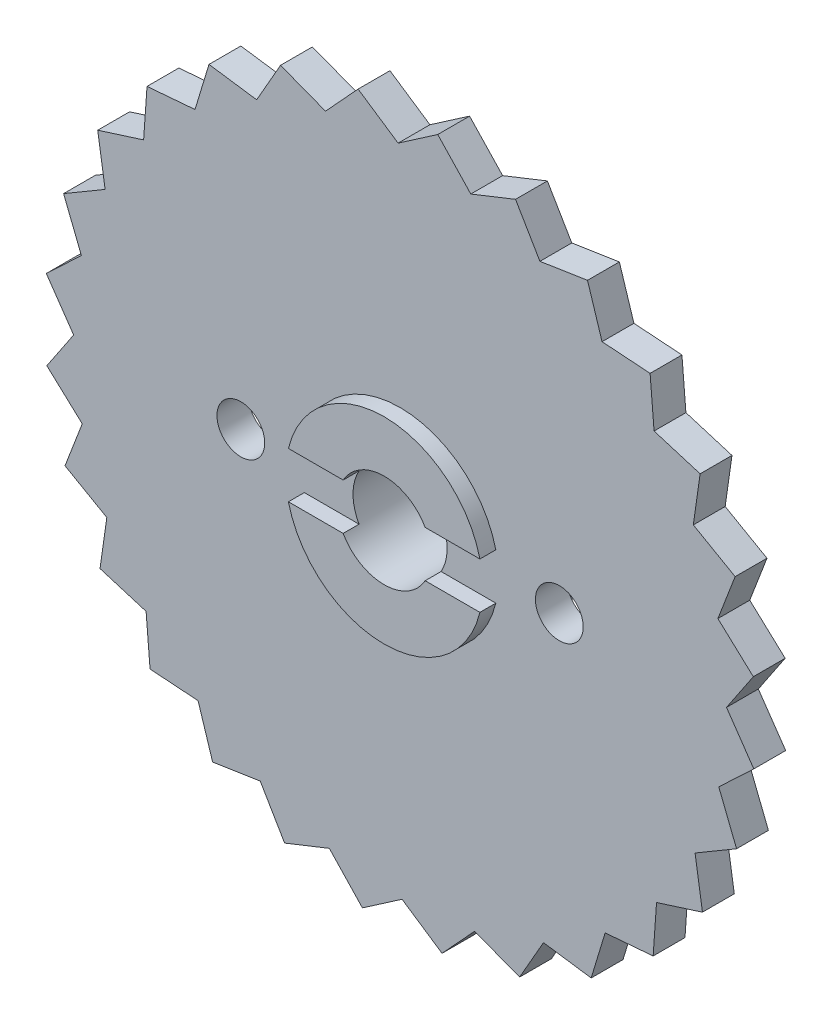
ISO-10303-21;
HEADER;
FILE_DESCRIPTION(('STEP AP214'),'2;1');
FILE_NAME('part.step','',(''),(''),'','','');
FILE_SCHEMA(('AUTOMOTIVE_DESIGN { 1 0 10303 214 1 1 1 1 }'));
ENDSEC;
DATA;
#1=APPLICATION_CONTEXT('core data for automotive mechanical design processes');
#2=APPLICATION_PROTOCOL_DEFINITION('international standard','automotive_design',2000,#1);
#3=PRODUCT_CONTEXT('',#1,'mechanical');
#4=PRODUCT('Part','Part','',(#3));
#5=PRODUCT_RELATED_PRODUCT_CATEGORY('part','',(#4));
#6=PRODUCT_DEFINITION_FORMATION('','',#4);
#7=PRODUCT_DEFINITION_CONTEXT('part definition',#1,'design');
#8=PRODUCT_DEFINITION('design','',#6,#7);
#9=PRODUCT_DEFINITION_SHAPE('','',#8);
#10=(LENGTH_UNIT() NAMED_UNIT(*) SI_UNIT(.MILLI.,.METRE.));
#11=(NAMED_UNIT(*) PLANE_ANGLE_UNIT() SI_UNIT($,.RADIAN.));
#12=(NAMED_UNIT(*) SI_UNIT($,.STERADIAN.) SOLID_ANGLE_UNIT());
#13=UNCERTAINTY_MEASURE_WITH_UNIT(LENGTH_MEASURE(1.E-05),#10,'distance_accuracy_value','');
#14=(GEOMETRIC_REPRESENTATION_CONTEXT(3) GLOBAL_UNCERTAINTY_ASSIGNED_CONTEXT((#13)) GLOBAL_UNIT_ASSIGNED_CONTEXT((#10,
#11,#12)) REPRESENTATION_CONTEXT('',''));
#15=CARTESIAN_POINT('',(0.,0.,0.));
#16=DIRECTION('',(0.,0.,1.));
#17=DIRECTION('',(1.,0.,0.));
#18=AXIS2_PLACEMENT_3D('',#15,#16,#17);
#19=CARTESIAN_POINT('',(0.,0.,0.));
#20=DIRECTION('',(0.,0.,1.));
#21=DIRECTION('',(1.,0.,0.));
#22=AXIS2_PLACEMENT_3D('',#19,#20,#21);
#23=CYLINDRICAL_SURFACE('',#22,2.955);
#24=CARTESIAN_POINT('',(-2.955,0.,1.11));
#25=CARTESIAN_POINT('',(-2.95499560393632,0.0787131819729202,1.11000503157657));
#26=CARTESIAN_POINT('',(-2.95182144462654,0.157515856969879,1.11623211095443));
#27=CARTESIAN_POINT('',(-2.93943640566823,0.312783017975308,1.14086069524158));
#28=CARTESIAN_POINT('',(-2.93021452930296,0.389242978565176,1.15928437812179));
#29=CARTESIAN_POINT('',(-2.9066971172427,0.537343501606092,1.20739517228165));
#30=CARTESIAN_POINT('',(-2.89242151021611,0.609001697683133,1.23703807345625));
#31=CARTESIAN_POINT('',(-2.86009829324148,0.746216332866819,1.30651202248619));
#32=CARTESIAN_POINT('',(-2.84205090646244,0.811773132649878,1.34634246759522));
#33=CARTESIAN_POINT('',(-2.80252403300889,0.939480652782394,1.43785531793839));
#34=CARTESIAN_POINT('',(-2.78090137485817,1.00117054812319,1.49011802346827));
#35=CARTESIAN_POINT('',(-2.73711447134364,1.11533627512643,1.60375900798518));
#36=CARTESIAN_POINT('',(-2.71494981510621,1.16780485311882,1.66514439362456));
#37=CARTESIAN_POINT('',(-2.67052513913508,1.26628164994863,1.80121233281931));
#38=CARTESIAN_POINT('',(-2.64840126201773,1.31142899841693,1.87656769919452));
#39=CARTESIAN_POINT('',(-2.60897435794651,1.38821941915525,2.03503693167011));
#40=CARTESIAN_POINT('',(-2.591667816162,1.41987234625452,2.11814508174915));
#41=CARTESIAN_POINT('',(-2.56545460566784,1.46668093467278,2.28464006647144));
#42=CARTESIAN_POINT('',(-2.55610239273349,1.48272022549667,2.36770469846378));
#43=CARTESIAN_POINT('',(-2.54568664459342,1.50054117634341,2.53582817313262));
#44=CARTESIAN_POINT('',(-2.5446144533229,1.50233772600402,2.62088483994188));
#45=CARTESIAN_POINT('',(-2.55052370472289,1.49226944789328,2.77921039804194));
#46=CARTESIAN_POINT('',(-2.55652144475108,1.48207361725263,2.85263130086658));
#47=CARTESIAN_POINT('',(-2.57416503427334,1.45121059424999,2.99652983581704));
#48=CARTESIAN_POINT('',(-2.58581277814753,1.4305398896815,3.06700647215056));
#49=CARTESIAN_POINT('',(-2.61369466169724,1.37894805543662,3.20502992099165));
#50=CARTESIAN_POINT('',(-2.6300289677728,1.34780016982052,3.27247078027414));
#51=CARTESIAN_POINT('',(-2.66545233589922,1.27631449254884,3.40149697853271));
#52=CARTESIAN_POINT('',(-2.68454263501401,1.2359725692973,3.46307966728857));
#53=CARTESIAN_POINT('',(-2.72635229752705,1.14107508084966,3.58714889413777));
#54=CARTESIAN_POINT('',(-2.74921915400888,1.0853490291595,3.64869363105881));
#55=CARTESIAN_POINT('',(-2.79398202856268,0.964290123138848,3.76196365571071));
#56=CARTESIAN_POINT('',(-2.81587755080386,0.898952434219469,3.81368397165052));
#57=CARTESIAN_POINT('',(-2.85754419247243,0.756462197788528,3.9082390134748));
#58=CARTESIAN_POINT('',(-2.87715769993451,0.678886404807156,3.95051107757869));
#59=CARTESIAN_POINT('',(-2.91069196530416,0.516478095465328,4.02105279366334));
#60=CARTESIAN_POINT('',(-2.9246173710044,0.431651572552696,4.04933388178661));
#61=CARTESIAN_POINT('',(-2.94420406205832,0.264831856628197,4.08870787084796));
#62=CARTESIAN_POINT('',(-2.95046419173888,0.18320484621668,4.10105114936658));
#63=CARTESIAN_POINT('',(-2.95608215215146,0.0188107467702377,4.11213940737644));
#64=CARTESIAN_POINT('',(-2.95544340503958,-0.0639557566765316,4.11089112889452));
#65=CARTESIAN_POINT('',(-2.94767695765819,-0.221195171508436,4.09553336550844));
#66=CARTESIAN_POINT('',(-2.94107523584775,-0.295799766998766,4.08246626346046));
#67=CARTESIAN_POINT('',(-2.92274101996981,-0.441600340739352,4.04549540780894));
#68=CARTESIAN_POINT('',(-2.91100796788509,-0.512795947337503,4.0215904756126));
#69=CARTESIAN_POINT('',(-2.88305777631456,-0.652067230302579,3.96302491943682));
#70=CARTESIAN_POINT('',(-2.8667246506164,-0.720000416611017,3.92808278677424));
#71=CARTESIAN_POINT('',(-2.83112820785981,-0.849258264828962,3.848756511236));
#72=CARTESIAN_POINT('',(-2.81186366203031,-0.91058013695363,3.80436840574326));
#73=CARTESIAN_POINT('',(-2.76996423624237,-1.03141226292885,3.70227164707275));
#74=CARTESIAN_POINT('',(-2.74718519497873,-1.09012163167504,3.64367278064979));
#75=CARTESIAN_POINT('',(-2.70222255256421,-1.19724699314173,3.51744668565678));
#76=CARTESIAN_POINT('',(-2.68003940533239,-1.24565532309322,3.44981279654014));
#77=CARTESIAN_POINT('',(-2.63762304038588,-1.33321510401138,3.30297744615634));
#78=CARTESIAN_POINT('',(-2.61755334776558,-1.37174710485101,3.2233550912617));
#79=CARTESIAN_POINT('',(-2.58372892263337,-1.43445365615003,3.05741696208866));
#80=CARTESIAN_POINT('',(-2.56996582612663,-1.45864723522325,2.97111023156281));
#81=CARTESIAN_POINT('',(-2.55207112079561,-1.48971504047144,2.80317793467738));
#82=CARTESIAN_POINT('',(-2.54713587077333,-1.4980395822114,2.72190842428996));
#83=CARTESIAN_POINT('',(-2.54519289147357,-1.50134164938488,2.5590196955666));
#84=CARTESIAN_POINT('',(-2.54818135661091,-1.49632558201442,2.47740066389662));
#85=CARTESIAN_POINT('',(-2.56088603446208,-1.47445469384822,2.32483286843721));
#86=CARTESIAN_POINT('',(-2.56989278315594,-1.45884583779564,2.25363858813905));
#87=CARTESIAN_POINT('',(-2.59275860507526,-1.41780684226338,2.11496881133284));
#88=CARTESIAN_POINT('',(-2.60661927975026,-1.39237346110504,2.0474945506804));
#89=CARTESIAN_POINT('',(-2.63875994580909,-1.33051125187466,1.91317143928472));
#90=CARTESIAN_POINT('',(-2.65727361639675,-1.29346047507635,1.84666664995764));
#91=CARTESIAN_POINT('',(-2.69626313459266,-1.21008586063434,1.72037970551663));
#92=CARTESIAN_POINT('',(-2.71674001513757,-1.16375712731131,1.66060112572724));
#93=CARTESIAN_POINT('',(-2.76045154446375,-1.05626970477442,1.54158533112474));
#94=CARTESIAN_POINT('',(-2.78370706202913,-0.993975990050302,1.48337521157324));
#95=CARTESIAN_POINT('',(-2.82800226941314,-0.859889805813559,1.37798500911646));
#96=CARTESIAN_POINT('',(-2.84904071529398,-0.788092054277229,1.33081110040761));
#97=CARTESIAN_POINT('',(-2.88687771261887,-0.635754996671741,1.24860934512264));
#98=CARTESIAN_POINT('',(-2.90362919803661,-0.555131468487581,1.21371487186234));
#99=CARTESIAN_POINT('',(-2.93060754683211,-0.388151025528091,1.15844061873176));
#100=CARTESIAN_POINT('',(-2.94085271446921,-0.30181095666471,1.1380201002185));
#101=CARTESIAN_POINT('',(-2.94980253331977,-0.178788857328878,1.12026072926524));
#102=CARTESIAN_POINT('',(-2.95174615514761,-0.14317442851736,1.11641876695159));
#103=CARTESIAN_POINT('',(-2.95434590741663,-0.0717128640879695,1.11128722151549));
#104=CARTESIAN_POINT('',(-2.95500200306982,-0.0358657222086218,1.10999770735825));
#105=CARTESIAN_POINT('',(-2.955,0.,1.11));
#106=B_SPLINE_CURVE_WITH_KNOTS('',3,(#24,#25,#26,#27,#28,#29,#30,#31,#32,#33,#34,#35,#36,#37,
#38,#39,#40,#41,#42,#43,#44,#45,#46,#47,#48,#49,#50,#51,#52,#53,#54,#55,#56,#57,#58,#59,#60,#61,
#62,#63,#64,#65,#66,#67,#68,#69,#70,#71,#72,#73,#74,#75,#76,#77,#78,#79,#80,#81,#82,#83,#84,#85,
#86,#87,#88,#89,#90,#91,#92,#93,#94,#95,#96,#97,#98,#99,#100,#101,#102,#103,#104,#105),
.UNSPECIFIED.,.T.,.F.,(4,2,2,2,2,2,2,2,2,2,2,2,2,2,2,2,2,2,2,2,2,2,2,2,2,2,2,2,2,2,2,2,2,2,2,2,
2,2,2,2,4),(0.,0.235994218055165,0.472418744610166,0.707921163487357,0.943409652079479,
1.19345035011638,1.4436868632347,1.71408087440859,1.98427708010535,2.23809649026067,
2.49165051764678,2.71371376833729,2.93585152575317,3.16314459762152,3.39054001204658,
3.64777471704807,3.90513925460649,4.1751715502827,4.44498275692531,4.69199687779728,
4.93888847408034,5.16592482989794,5.39298588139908,5.62638272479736,5.85987767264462,
6.1168297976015,6.37397240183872,6.64461568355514,6.91489898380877,7.1590081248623,
7.40300004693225,7.62236621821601,7.84180483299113,8.07592918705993,8.31017740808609,
8.57408823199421,8.83814634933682,9.10498991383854,9.3710794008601,9.47860744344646,
9.58613839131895),.UNSPECIFIED.);
#107=CARTESIAN_POINT('',(-2.955,0.,1.11));
#108=VERTEX_POINT('',#107);
#109=EDGE_CURVE('E1085',#108,#108,#106,.T.);
#110=ORIENTED_EDGE('',*,*,#109,.F.);
#111=EDGE_LOOP('',(#110));
#112=FACE_BOUND('',#111,.T.);
#113=CARTESIAN_POINT('',(0.,0.,0.5));
#114=DIRECTION('',(0.,0.,-1.));
#115=DIRECTION('',(-1.,0.,0.));
#116=AXIS2_PLACEMENT_3D('',#113,#114,#115);
#117=CIRCLE('',#116,2.955);
#118=CARTESIAN_POINT('',(2.57478639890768,-1.45,0.5));
#119=VERTEX_POINT('',#118);
#120=CARTESIAN_POINT('',(2.57478639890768,1.45,0.5));
#121=VERTEX_POINT('',#120);
#122=EDGE_CURVE('E1151',#119,#121,#117,.F.);
#123=ORIENTED_EDGE('',*,*,#122,.F.);
#124=DIRECTION('',(0.,0.,1.));
#125=VECTOR('',#124,1.);
#126=CARTESIAN_POINT('',(2.57478639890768,-1.45,0.));
#127=LINE('',#126,#125);
#128=CARTESIAN_POINT('',(2.57478639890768,-1.45,0.));
#129=VERTEX_POINT('',#128);
#130=EDGE_CURVE('E1178',#119,#129,#127,.F.);
#131=ORIENTED_EDGE('',*,*,#130,.T.);
#132=CARTESIAN_POINT('',(0.,0.,0.));
#133=DIRECTION('',(0.,0.,1.));
#134=DIRECTION('',(1.,0.,0.));
#135=AXIS2_PLACEMENT_3D('',#132,#133,#134);
#136=CIRCLE('',#135,2.955);
#137=CARTESIAN_POINT('',(-2.57478639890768,-1.45,0.));
#138=VERTEX_POINT('',#137);
#139=EDGE_CURVE('E933',#138,#129,#136,.T.);
#140=ORIENTED_EDGE('',*,*,#139,.F.);
#141=DIRECTION('',(0.,0.,1.));
#142=VECTOR('',#141,1.);
#143=CARTESIAN_POINT('',(-2.57478639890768,-1.45,0.));
#144=LINE('',#143,#142);
#145=CARTESIAN_POINT('',(-2.57478639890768,-1.45,0.5));
#146=VERTEX_POINT('',#145);
#147=EDGE_CURVE('E1175',#138,#146,#144,.T.);
#148=ORIENTED_EDGE('',*,*,#147,.T.);
#149=CARTESIAN_POINT('',(-2.57478639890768,1.45,0.5));
#150=VERTEX_POINT('',#149);
#151=EDGE_CURVE('E1168',#150,#146,#117,.F.);
#152=ORIENTED_EDGE('',*,*,#151,.F.);
#153=DIRECTION('',(0.,0.,1.));
#154=VECTOR('',#153,1.);
#155=CARTESIAN_POINT('',(-2.57478639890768,1.45,0.));
#156=LINE('',#155,#154);
#157=CARTESIAN_POINT('',(-2.57478639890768,1.45,0.));
#158=VERTEX_POINT('',#157);
#159=EDGE_CURVE('E1172',#150,#158,#156,.F.);
#160=ORIENTED_EDGE('',*,*,#159,.T.);
#161=CARTESIAN_POINT('',(2.57478639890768,1.45,0.));
#162=VERTEX_POINT('',#161);
#163=EDGE_CURVE('E954',#162,#158,#136,.T.);
#164=ORIENTED_EDGE('',*,*,#163,.F.);
#165=DIRECTION('',(0.,0.,1.));
#166=VECTOR('',#165,1.);
#167=CARTESIAN_POINT('',(2.57478639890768,1.45,0.));
#168=LINE('',#167,#166);
#169=EDGE_CURVE('E1170',#162,#121,#168,.T.);
#170=ORIENTED_EDGE('',*,*,#169,.T.);
#171=EDGE_LOOP('',(#123,#131,#140,#148,#152,#160,#164,#170));
#172=FACE_BOUND('',#171,.T.);
#173=CARTESIAN_POINT('',(0.,0.,9.));
#174=DIRECTION('',(0.,0.,1.));
#175=DIRECTION('',(1.,0.,0.));
#176=AXIS2_PLACEMENT_3D('',#173,#174,#175);
#177=CIRCLE('',#176,2.955);
#178=CARTESIAN_POINT('',(2.57478639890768,1.45,9.));
#179=VERTEX_POINT('',#178);
#180=CARTESIAN_POINT('',(-2.57478639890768,1.45,9.));
#181=VERTEX_POINT('',#180);
#182=EDGE_CURVE('E951',#179,#181,#177,.T.);
#183=ORIENTED_EDGE('',*,*,#182,.T.);
#184=DIRECTION('',(0.,0.,1.));
#185=VECTOR('',#184,1.);
#186=CARTESIAN_POINT('',(-2.57478639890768,1.45,0.));
#187=LINE('',#186,#185);
#188=CARTESIAN_POINT('',(-2.57478639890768,1.45,8.));
#189=VERTEX_POINT('',#188);
#190=EDGE_CURVE('E1044',#181,#189,#187,.F.);
#191=ORIENTED_EDGE('',*,*,#190,.T.);
#192=CARTESIAN_POINT('',(0.,0.,8.));
#193=DIRECTION('',(0.,0.,1.));
#194=DIRECTION('',(1.,0.,0.));
#195=AXIS2_PLACEMENT_3D('',#192,#193,#194);
#196=CIRCLE('',#195,2.955);
#197=CARTESIAN_POINT('',(-2.57478639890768,-1.45,8.));
#198=VERTEX_POINT('',#197);
#199=EDGE_CURVE('E1035',#198,#189,#196,.F.);
#200=ORIENTED_EDGE('',*,*,#199,.F.);
#201=DIRECTION('',(0.,0.,1.));
#202=VECTOR('',#201,1.);
#203=CARTESIAN_POINT('',(-2.57478639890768,-1.45,0.));
#204=LINE('',#203,#202);
#205=CARTESIAN_POINT('',(-2.57478639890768,-1.45,9.));
#206=VERTEX_POINT('',#205);
#207=EDGE_CURVE('E1041',#198,#206,#204,.T.);
#208=ORIENTED_EDGE('',*,*,#207,.T.);
#209=CARTESIAN_POINT('',(2.57478639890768,-1.45,9.));
#210=VERTEX_POINT('',#209);
#211=EDGE_CURVE('E945',#206,#210,#177,.T.);
#212=ORIENTED_EDGE('',*,*,#211,.T.);
#213=DIRECTION('',(0.,0.,1.));
#214=VECTOR('',#213,1.);
#215=CARTESIAN_POINT('',(2.57478639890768,-1.45,0.));
#216=LINE('',#215,#214);
#217=CARTESIAN_POINT('',(2.57478639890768,-1.45,8.));
#218=VERTEX_POINT('',#217);
#219=EDGE_CURVE('E1034',#210,#218,#216,.F.);
#220=ORIENTED_EDGE('',*,*,#219,.T.);
#221=CARTESIAN_POINT('',(2.57478639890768,1.45,8.));
#222=VERTEX_POINT('',#221);
#223=EDGE_CURVE('E1032',#222,#218,#196,.F.);
#224=ORIENTED_EDGE('',*,*,#223,.F.);
#225=DIRECTION('',(0.,0.,1.));
#226=VECTOR('',#225,1.);
#227=CARTESIAN_POINT('',(2.57478639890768,1.45,0.));
#228=LINE('',#227,#226);
#229=EDGE_CURVE('E1038',#222,#179,#228,.T.);
#230=ORIENTED_EDGE('',*,*,#229,.T.);
#231=EDGE_LOOP('',(#183,#191,#200,#208,#212,#220,#224,#230));
#232=FACE_BOUND('',#231,.T.);
#233=CARTESIAN_POINT('',(2.955,0.,1.11));
#234=CARTESIAN_POINT('',(2.95499560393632,-0.0787131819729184,1.11000503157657));
#235=CARTESIAN_POINT('',(2.95182144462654,-0.157515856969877,1.11623211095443));
#236=CARTESIAN_POINT('',(2.93943640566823,-0.312783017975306,1.14086069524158));
#237=CARTESIAN_POINT('',(2.93021452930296,-0.389242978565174,1.15928437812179));
#238=CARTESIAN_POINT('',(2.9066971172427,-0.53734350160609,1.20739517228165));
#239=CARTESIAN_POINT('',(2.89242151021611,-0.609001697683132,1.23703807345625));
#240=CARTESIAN_POINT('',(2.86009829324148,-0.746216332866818,1.30651202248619));
#241=CARTESIAN_POINT('',(2.84205090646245,-0.811773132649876,1.34634246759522));
#242=CARTESIAN_POINT('',(2.80252403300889,-0.939480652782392,1.43785531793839));
#243=CARTESIAN_POINT('',(2.78090137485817,-1.00117054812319,1.49011802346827));
#244=CARTESIAN_POINT('',(2.73711447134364,-1.11533627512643,1.60375900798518));
#245=CARTESIAN_POINT('',(2.71494981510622,-1.16780485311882,1.66514439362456));
#246=CARTESIAN_POINT('',(2.67052513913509,-1.26628164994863,1.80121233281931));
#247=CARTESIAN_POINT('',(2.64840126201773,-1.31142899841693,1.87656769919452));
#248=CARTESIAN_POINT('',(2.60897435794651,-1.38821941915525,2.03503693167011));
#249=CARTESIAN_POINT('',(2.591667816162,-1.41987234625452,2.11814508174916));
#250=CARTESIAN_POINT('',(2.56545460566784,-1.46668093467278,2.28464006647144));
#251=CARTESIAN_POINT('',(2.55610239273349,-1.48272022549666,2.36770469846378));
#252=CARTESIAN_POINT('',(2.54568664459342,-1.5005411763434,2.53582817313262));
#253=CARTESIAN_POINT('',(2.54461445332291,-1.50233772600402,2.62088483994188));
#254=CARTESIAN_POINT('',(2.55052370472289,-1.49226944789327,2.77921039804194));
#255=CARTESIAN_POINT('',(2.55652144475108,-1.48207361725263,2.85263130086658));
#256=CARTESIAN_POINT('',(2.57416503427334,-1.45121059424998,2.99652983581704));
#257=CARTESIAN_POINT('',(2.58581277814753,-1.43053988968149,3.06700647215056));
#258=CARTESIAN_POINT('',(2.61369466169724,-1.37894805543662,3.20502992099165));
#259=CARTESIAN_POINT('',(2.6300289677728,-1.34780016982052,3.27247078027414));
#260=CARTESIAN_POINT('',(2.66545233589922,-1.27631449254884,3.40149697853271));
#261=CARTESIAN_POINT('',(2.68454263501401,-1.23597256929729,3.46307966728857));
#262=CARTESIAN_POINT('',(2.72635229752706,-1.14107508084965,3.58714889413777));
#263=CARTESIAN_POINT('',(2.74921915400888,-1.0853490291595,3.64869363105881));
#264=CARTESIAN_POINT('',(2.79398202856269,-0.964290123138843,3.76196365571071));
#265=CARTESIAN_POINT('',(2.81587755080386,-0.898952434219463,3.81368397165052));
#266=CARTESIAN_POINT('',(2.85754419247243,-0.756462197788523,3.9082390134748));
#267=CARTESIAN_POINT('',(2.87715769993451,-0.678886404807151,3.95051107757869));
#268=CARTESIAN_POINT('',(2.91069196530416,-0.516478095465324,4.02105279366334));
#269=CARTESIAN_POINT('',(2.9246173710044,-0.431651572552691,4.04933388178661));
#270=CARTESIAN_POINT('',(2.94420406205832,-0.264831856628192,4.08870787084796));
#271=CARTESIAN_POINT('',(2.95046419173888,-0.183204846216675,4.10105114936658));
#272=CARTESIAN_POINT('',(2.95608215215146,-0.0188107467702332,4.11213940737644));
#273=CARTESIAN_POINT('',(2.95544340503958,0.0639557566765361,4.11089112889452));
#274=CARTESIAN_POINT('',(2.94767695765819,0.221195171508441,4.09553336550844));
#275=CARTESIAN_POINT('',(2.94107523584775,0.295799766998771,4.08246626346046));
#276=CARTESIAN_POINT('',(2.9227410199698,0.441600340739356,4.04549540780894));
#277=CARTESIAN_POINT('',(2.91100796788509,0.512795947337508,4.0215904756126));
#278=CARTESIAN_POINT('',(2.88305777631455,0.652067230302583,3.96302491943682));
#279=CARTESIAN_POINT('',(2.8667246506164,0.720000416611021,3.92808278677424));
#280=CARTESIAN_POINT('',(2.83112820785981,0.849258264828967,3.848756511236));
#281=CARTESIAN_POINT('',(2.81186366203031,0.910580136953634,3.80436840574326));
#282=CARTESIAN_POINT('',(2.76996423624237,1.03141226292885,3.70227164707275));
#283=CARTESIAN_POINT('',(2.74718519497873,1.09012163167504,3.64367278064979));
#284=CARTESIAN_POINT('',(2.70222255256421,1.19724699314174,3.51744668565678));
#285=CARTESIAN_POINT('',(2.68003940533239,1.24565532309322,3.44981279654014));
#286=CARTESIAN_POINT('',(2.63762304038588,1.33321510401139,3.30297744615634));
#287=CARTESIAN_POINT('',(2.61755334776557,1.37174710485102,3.22335509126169));
#288=CARTESIAN_POINT('',(2.58372892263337,1.43445365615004,3.05741696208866));
#289=CARTESIAN_POINT('',(2.56996582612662,1.45864723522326,2.97111023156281));
#290=CARTESIAN_POINT('',(2.55207112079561,1.48971504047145,2.80317793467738));
#291=CARTESIAN_POINT('',(2.54713587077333,1.49803958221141,2.72190842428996));
#292=CARTESIAN_POINT('',(2.54519289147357,1.50134164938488,2.5590196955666));
#293=CARTESIAN_POINT('',(2.54818135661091,1.49632558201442,2.47740066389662));
#294=CARTESIAN_POINT('',(2.56088603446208,1.47445469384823,2.32483286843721));
#295=CARTESIAN_POINT('',(2.56989278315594,1.45884583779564,2.25363858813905));
#296=CARTESIAN_POINT('',(2.59275860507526,1.41780684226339,2.11496881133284));
#297=CARTESIAN_POINT('',(2.60661927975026,1.39237346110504,2.0474945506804));
#298=CARTESIAN_POINT('',(2.63875994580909,1.33051125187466,1.91317143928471));
#299=CARTESIAN_POINT('',(2.65727361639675,1.29346047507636,1.84666664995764));
#300=CARTESIAN_POINT('',(2.69626313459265,1.21008586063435,1.72037970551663));
#301=CARTESIAN_POINT('',(2.71674001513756,1.16375712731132,1.66060112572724));
#302=CARTESIAN_POINT('',(2.76045154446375,1.05626970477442,1.54158533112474));
#303=CARTESIAN_POINT('',(2.78370706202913,0.993975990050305,1.48337521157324));
#304=CARTESIAN_POINT('',(2.82800226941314,0.859889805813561,1.37798500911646));
#305=CARTESIAN_POINT('',(2.84904071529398,0.788092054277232,1.33081110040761));
#306=CARTESIAN_POINT('',(2.88687771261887,0.635754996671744,1.24860934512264));
#307=CARTESIAN_POINT('',(2.90362919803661,0.555131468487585,1.21371487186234));
#308=CARTESIAN_POINT('',(2.93060754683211,0.388151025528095,1.15844061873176));
#309=CARTESIAN_POINT('',(2.94085271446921,0.301810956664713,1.1380201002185));
#310=CARTESIAN_POINT('',(2.94980253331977,0.17878885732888,1.12026072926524));
#311=CARTESIAN_POINT('',(2.95174615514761,0.143174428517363,1.11641876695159));
#312=CARTESIAN_POINT('',(2.95434590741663,0.0717128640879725,1.11128722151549));
#313=CARTESIAN_POINT('',(2.95500200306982,0.0358657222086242,1.10999770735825));
#314=CARTESIAN_POINT('',(2.955,0.,1.11));
#315=B_SPLINE_CURVE_WITH_KNOTS('',3,(#233,#234,#235,#236,#237,#238,#239,#240,#241,#242,#243,
#244,#245,#246,#247,#248,#249,#250,#251,#252,#253,#254,#255,#256,#257,#258,#259,#260,#261,#262,
#263,#264,#265,#266,#267,#268,#269,#270,#271,#272,#273,#274,#275,#276,#277,#278,#279,#280,#281,
#282,#283,#284,#285,#286,#287,#288,#289,#290,#291,#292,#293,#294,#295,#296,#297,#298,#299,#300,
#301,#302,#303,#304,#305,#306,#307,#308,#309,#310,#311,#312,#313,#314),.UNSPECIFIED.,.T.,.F.,(4,
2,2,2,2,2,2,2,2,2,2,2,2,2,2,2,2,2,2,2,2,2,2,2,2,2,2,2,2,2,2,2,2,2,2,2,2,2,2,2,4),(0.,
0.235994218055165,0.472418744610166,0.707921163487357,0.943409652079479,1.19345035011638,
1.4436868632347,1.71408087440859,1.98427708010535,2.23809649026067,2.49165051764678,
2.71371376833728,2.93585152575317,3.16314459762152,3.39054001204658,3.64777471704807,
3.90513925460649,4.1751715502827,4.44498275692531,4.69199687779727,4.93888847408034,
5.16592482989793,5.39298588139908,5.62638272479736,5.85987767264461,6.1168297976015,
6.37397240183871,6.64461568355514,6.91489898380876,7.15900812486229,7.40300004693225,
7.62236621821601,7.84180483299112,8.07592918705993,8.31017740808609,8.57408823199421,
8.83814634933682,9.10498991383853,9.3710794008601,9.47860744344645,9.58613839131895),.UNSPECIFIED.);
#316=CARTESIAN_POINT('',(2.955,0.,1.11));
#317=VERTEX_POINT('',#316);
#318=EDGE_CURVE('E1091',#317,#317,#315,.T.);
#319=ORIENTED_EDGE('',*,*,#318,.F.);
#320=EDGE_LOOP('',(#319));
#321=FACE_BOUND('',#320,.T.);
#322=ADVANCED_FACE('F467',(#112,#172,#232,#321),#23,.F.);
#323=CARTESIAN_POINT('',(0.,0.,4.22));
#324=DIRECTION('',(0.,0.,-1.));
#325=DIRECTION('',(-1.,0.,0.));
#326=AXIS2_PLACEMENT_3D('',#323,#324,#325);
#327=CYLINDRICAL_SURFACE('',#326,5.97);
#328=CARTESIAN_POINT('',(5.97,0.,1.11));
#329=CARTESIAN_POINT('',(5.96999860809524,-0.0828625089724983,1.11000230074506));
#330=CARTESIAN_POINT('',(5.96825765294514,-0.165750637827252,1.11688928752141));
#331=CARTESIAN_POINT('',(5.96148136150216,-0.329150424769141,1.14421346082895));
#332=CARTESIAN_POINT('',(5.95644417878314,-0.40966072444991,1.16465824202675));
#333=CARTESIAN_POINT('',(5.94363308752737,-0.565921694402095,1.21839992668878));
#334=CARTESIAN_POINT('',(5.93586248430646,-0.641677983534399,1.25168131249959));
#335=CARTESIAN_POINT('',(5.91841165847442,-0.786532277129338,1.33009666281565));
#336=CARTESIAN_POINT('',(5.90873136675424,-0.855630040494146,1.3752310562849));
#337=CARTESIAN_POINT('',(5.88828667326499,-0.986642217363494,1.47706219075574));
#338=CARTESIAN_POINT('',(5.87750541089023,-1.04839850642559,1.53395899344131));
#339=CARTESIAN_POINT('',(5.85618562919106,-1.16160026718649,1.65727157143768));
#340=CARTESIAN_POINT('',(5.84564713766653,-1.21304456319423,1.72368843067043));
#341=CARTESIAN_POINT('',(5.82583593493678,-1.30490770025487,1.86538608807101));
#342=CARTESIAN_POINT('',(5.81658461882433,-1.34514928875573,1.94078506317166));
#343=CARTESIAN_POINT('',(5.80064126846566,-1.41232468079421,2.09754776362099));
#344=CARTESIAN_POINT('',(5.7939488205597,-1.43926063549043,2.17891052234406));
#345=CARTESIAN_POINT('',(5.78405429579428,-1.47852000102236,2.34355155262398));
#346=CARTESIAN_POINT('',(5.78078437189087,-1.49112789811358,2.42675781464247));
#347=CARTESIAN_POINT('',(5.77790206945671,-1.50225944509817,2.59416377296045));
#348=CARTESIAN_POINT('',(5.77828908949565,-1.50078541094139,2.67836330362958));
#349=CARTESIAN_POINT('',(5.7826159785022,-1.48402183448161,2.84318239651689));
#350=CARTESIAN_POINT('',(5.78646856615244,-1.46907167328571,2.92383912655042));
#351=CARTESIAN_POINT('',(5.79715335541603,-1.42632176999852,3.08146133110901));
#352=CARTESIAN_POINT('',(5.80398577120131,-1.39852110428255,3.15842653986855));
#353=CARTESIAN_POINT('',(5.81994024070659,-1.33057106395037,3.3073891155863));
#354=CARTESIAN_POINT('',(5.82908490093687,-1.29029882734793,3.37932791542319));
#355=CARTESIAN_POINT('',(5.84862076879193,-1.19863473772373,3.51554811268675));
#356=CARTESIAN_POINT('',(5.85901219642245,-1.14724092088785,3.57982815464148));
#357=CARTESIAN_POINT('',(5.88023793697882,-1.033036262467,3.70085059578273));
#358=CARTESIAN_POINT('',(5.89107638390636,-0.969939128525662,3.7573224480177));
#359=CARTESIAN_POINT('',(5.91170505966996,-0.835040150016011,3.85893500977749));
#360=CARTESIAN_POINT('',(5.92149525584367,-0.763238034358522,3.90407536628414));
#361=CARTESIAN_POINT('',(5.93897387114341,-0.612578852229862,3.98184435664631));
#362=CARTESIAN_POINT('',(5.94665481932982,-0.533697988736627,4.01442867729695));
#363=CARTESIAN_POINT('',(5.95899519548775,-0.371342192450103,4.06579898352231));
#364=CARTESIAN_POINT('',(5.96365520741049,-0.28786815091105,4.08458763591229));
#365=CARTESIAN_POINT('',(5.96934210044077,-0.12100834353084,4.10741923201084));
#366=CARTESIAN_POINT('',(5.97045972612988,-0.0376760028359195,4.11183056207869));
#367=CARTESIAN_POINT('',(5.96919455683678,0.128536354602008,4.10679318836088));
#368=CARTESIAN_POINT('',(5.96681208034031,0.211416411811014,4.09734574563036));
#369=CARTESIAN_POINT('',(5.9588725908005,0.373088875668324,4.06516254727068));
#370=CARTESIAN_POINT('',(5.95336369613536,0.451923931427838,4.04262809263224));
#371=CARTESIAN_POINT('',(5.93979256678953,0.604690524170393,3.98514075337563));
#372=CARTESIAN_POINT('',(5.93173007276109,0.678621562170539,3.95018660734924));
#373=CARTESIAN_POINT('',(5.91372909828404,0.820944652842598,3.8681404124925));
#374=CARTESIAN_POINT('',(5.90375964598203,0.889213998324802,3.8208424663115));
#375=CARTESIAN_POINT('',(5.88309890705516,1.01697734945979,3.71571414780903));
#376=CARTESIAN_POINT('',(5.87240749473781,1.07646982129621,3.65788193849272));
#377=CARTESIAN_POINT('',(5.85118064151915,1.18651126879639,3.5316156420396));
#378=CARTESIAN_POINT('',(5.8406556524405,1.23680171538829,3.46295410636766));
#379=CARTESIAN_POINT('',(5.82124897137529,1.32514686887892,3.31794930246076));
#380=CARTESIAN_POINT('',(5.81236720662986,1.36320211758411,3.2416063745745));
#381=CARTESIAN_POINT('',(5.79735085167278,1.42571282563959,3.08381378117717));
#382=CARTESIAN_POINT('',(5.79120003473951,1.45024882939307,3.00239764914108));
#383=CARTESIAN_POINT('',(5.78232718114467,1.48523542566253,2.8364175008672));
#384=CARTESIAN_POINT('',(5.77960438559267,1.49568913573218,2.75185418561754));
#385=CARTESIAN_POINT('',(5.77795411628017,1.50205027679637,2.58461206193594));
#386=CARTESIAN_POINT('',(5.77891878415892,1.49837107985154,2.50194979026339));
#387=CARTESIAN_POINT('',(5.78428514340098,1.47751785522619,2.33846484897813));
#388=CARTESIAN_POINT('',(5.78868676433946,1.46034410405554,2.25764214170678));
#389=CARTESIAN_POINT('',(5.80037065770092,1.41321608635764,2.10058523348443));
#390=CARTESIAN_POINT('',(5.80763526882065,1.38334009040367,2.02432614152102));
#391=CARTESIAN_POINT('',(5.82422892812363,1.31171748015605,1.87784811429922));
#392=CARTESIAN_POINT('',(5.83355826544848,1.26996920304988,1.80763002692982));
#393=CARTESIAN_POINT('',(5.85353715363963,1.17449432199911,1.67323149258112));
#394=CARTESIAN_POINT('',(5.86421500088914,1.12048123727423,1.60925873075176));
#395=CARTESIAN_POINT('',(5.88551967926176,1.00256726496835,1.49115049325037));
#396=CARTESIAN_POINT('',(5.89614649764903,0.938664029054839,1.43701736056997));
#397=CARTESIAN_POINT('',(5.91638442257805,0.801368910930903,1.33915619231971));
#398=CARTESIAN_POINT('',(5.92597332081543,0.727824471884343,1.29563724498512));
#399=CARTESIAN_POINT('',(5.94282009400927,0.57422887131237,1.22164983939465));
#400=CARTESIAN_POINT('',(5.95007962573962,0.494182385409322,1.19117210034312));
#401=CARTESIAN_POINT('',(5.96038628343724,0.345241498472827,1.14861632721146));
#402=CARTESIAN_POINT('',(5.96396655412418,0.277051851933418,1.13416667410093));
#403=CARTESIAN_POINT('',(5.96877390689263,0.139247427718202,1.11485791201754));
#404=CARTESIAN_POINT('',(5.97000116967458,0.069632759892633,1.1099980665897));
#405=CARTESIAN_POINT('',(5.97,0.,1.11));
#406=B_SPLINE_CURVE_WITH_KNOTS('',3,(#328,#329,#330,#331,#332,#333,#334,#335,#336,#337,#338,
#339,#340,#341,#342,#343,#344,#345,#346,#347,#348,#349,#350,#351,#352,#353,#354,#355,#356,#357,
#358,#359,#360,#361,#362,#363,#364,#365,#366,#367,#368,#369,#370,#371,#372,#373,#374,#375,#376,
#377,#378,#379,#380,#381,#382,#383,#384,#385,#386,#387,#388,#389,#390,#391,#392,#393,#394,#395,
#396,#397,#398,#399,#400,#401,#402,#403,#404,#405),.UNSPECIFIED.,.T.,.F.,(4,2,2,2,2,2,2,2,2,2,2,
2,2,2,2,2,2,2,2,2,2,2,2,2,2,2,2,2,2,2,2,2,2,2,2,2,2,2,4),(0.,0.248332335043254,
0.496803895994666,0.744976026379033,0.993157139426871,1.24596991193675,1.49881149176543,
1.75545164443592,2.01205029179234,2.26345988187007,2.51482812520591,2.76003755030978,
3.00526460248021,3.25298875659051,3.5007566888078,3.75566356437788,4.01057838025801,
4.26638478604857,4.52214172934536,4.77129172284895,5.0204190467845,5.26581220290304,
5.51123028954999,5.76103749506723,6.01088830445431,6.26693835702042,6.52297706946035,
6.77747339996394,7.03191338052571,7.27896873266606,7.52601902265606,7.77156857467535,
8.01715253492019,8.26920358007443,8.52131456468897,8.77805029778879,9.03460301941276,
9.24330287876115,9.45198671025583),.UNSPECIFIED.);
#407=CARTESIAN_POINT('',(5.97,0.,1.11));
#408=VERTEX_POINT('',#407);
#409=EDGE_CURVE('E1054',#408,#408,#406,.T.);
#410=ORIENTED_EDGE('',*,*,#409,.T.);
#411=EDGE_LOOP('',(#410));
#412=FACE_BOUND('',#411,.T.);
#413=CARTESIAN_POINT('',(0.,0.,4.22));
#414=DIRECTION('',(0.,0.,-1.));
#415=DIRECTION('',(-1.,0.,0.));
#416=AXIS2_PLACEMENT_3D('',#413,#414,#415);
#417=CIRCLE('',#416,5.97);
#418=CARTESIAN_POINT('',(-5.97,0.,4.22));
#419=VERTEX_POINT('',#418);
#420=EDGE_CURVE('E947',#419,#419,#417,.T.);
#421=ORIENTED_EDGE('',*,*,#420,.T.);
#422=EDGE_LOOP('',(#421));
#423=FACE_BOUND('',#422,.T.);
#424=CARTESIAN_POINT('',(0.,0.,1.));
#425=DIRECTION('',(0.,0.,-1.));
#426=DIRECTION('',(-1.,0.,0.));
#427=AXIS2_PLACEMENT_3D('',#424,#425,#426);
#428=CIRCLE('',#427,5.97);
#429=CARTESIAN_POINT('',(-5.97,0.,1.));
#430=VERTEX_POINT('',#429);
#431=EDGE_CURVE('E1140',#430,#430,#428,.T.);
#432=ORIENTED_EDGE('',*,*,#431,.F.);
#433=EDGE_LOOP('',(#432));
#434=FACE_BOUND('',#433,.T.);
#435=CARTESIAN_POINT('',(-5.97,0.,4.11));
#436=CARTESIAN_POINT('',(-5.96999860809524,-0.0828625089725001,4.10999769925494));
#437=CARTESIAN_POINT('',(-5.96825765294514,-0.165750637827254,4.10311071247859));
#438=CARTESIAN_POINT('',(-5.96148136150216,-0.329150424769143,4.07578653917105));
#439=CARTESIAN_POINT('',(-5.95644417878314,-0.409660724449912,4.05534175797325));
#440=CARTESIAN_POINT('',(-5.94363308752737,-0.565921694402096,4.00160007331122));
#441=CARTESIAN_POINT('',(-5.93586248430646,-0.6416779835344,3.96831868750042));
#442=CARTESIAN_POINT('',(-5.91841165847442,-0.786532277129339,3.88990333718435));
#443=CARTESIAN_POINT('',(-5.90873136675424,-0.855630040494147,3.8447689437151));
#444=CARTESIAN_POINT('',(-5.88828667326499,-0.986642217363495,3.74293780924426));
#445=CARTESIAN_POINT('',(-5.87750541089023,-1.04839850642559,3.68604100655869));
#446=CARTESIAN_POINT('',(-5.85618562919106,-1.1616002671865,3.56272842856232));
#447=CARTESIAN_POINT('',(-5.84564713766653,-1.21304456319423,3.49631156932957));
#448=CARTESIAN_POINT('',(-5.82583593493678,-1.30490770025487,3.35461391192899));
#449=CARTESIAN_POINT('',(-5.81658461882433,-1.34514928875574,3.27921493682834));
#450=CARTESIAN_POINT('',(-5.80064126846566,-1.41232468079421,3.12245223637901));
#451=CARTESIAN_POINT('',(-5.7939488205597,-1.43926063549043,3.04108947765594));
#452=CARTESIAN_POINT('',(-5.78405429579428,-1.47852000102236,2.87644844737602));
#453=CARTESIAN_POINT('',(-5.78078437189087,-1.49112789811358,2.79324218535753));
#454=CARTESIAN_POINT('',(-5.77790206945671,-1.50225944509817,2.62583622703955));
#455=CARTESIAN_POINT('',(-5.77828908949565,-1.50078541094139,2.54163669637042));
#456=CARTESIAN_POINT('',(-5.7826159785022,-1.48402183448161,2.3768176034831));
#457=CARTESIAN_POINT('',(-5.78646856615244,-1.46907167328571,2.29616087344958));
#458=CARTESIAN_POINT('',(-5.79715335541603,-1.42632176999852,2.13853866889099));
#459=CARTESIAN_POINT('',(-5.80398577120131,-1.39852110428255,2.06157346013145));
#460=CARTESIAN_POINT('',(-5.81994024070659,-1.33057106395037,1.9126108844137));
#461=CARTESIAN_POINT('',(-5.82908490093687,-1.29029882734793,1.84067208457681));
#462=CARTESIAN_POINT('',(-5.84862076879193,-1.19863473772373,1.70445188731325));
#463=CARTESIAN_POINT('',(-5.85901219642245,-1.14724092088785,1.64017184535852));
#464=CARTESIAN_POINT('',(-5.88023793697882,-1.033036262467,1.51914940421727));
#465=CARTESIAN_POINT('',(-5.89107638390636,-0.969939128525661,1.4626775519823));
#466=CARTESIAN_POINT('',(-5.91170505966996,-0.83504015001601,1.36106499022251));
#467=CARTESIAN_POINT('',(-5.92149525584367,-0.763238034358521,1.31592463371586));
#468=CARTESIAN_POINT('',(-5.93897387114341,-0.612578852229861,1.23815564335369));
#469=CARTESIAN_POINT('',(-5.94665481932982,-0.533697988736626,1.20557132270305));
#470=CARTESIAN_POINT('',(-5.95899519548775,-0.371342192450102,1.15420101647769));
#471=CARTESIAN_POINT('',(-5.96365520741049,-0.287868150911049,1.13541236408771));
#472=CARTESIAN_POINT('',(-5.96934210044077,-0.121008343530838,1.11258076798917));
#473=CARTESIAN_POINT('',(-5.97045972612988,-0.037676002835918,1.10816943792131));
#474=CARTESIAN_POINT('',(-5.96919455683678,0.12853635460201,1.11320681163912));
#475=CARTESIAN_POINT('',(-5.96681208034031,0.211416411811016,1.12265425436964));
#476=CARTESIAN_POINT('',(-5.9588725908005,0.373088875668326,1.15483745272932));
#477=CARTESIAN_POINT('',(-5.95336369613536,0.45192393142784,1.17737190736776));
#478=CARTESIAN_POINT('',(-5.93979256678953,0.604690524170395,1.23485924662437));
#479=CARTESIAN_POINT('',(-5.93173007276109,0.678621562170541,1.26981339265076));
#480=CARTESIAN_POINT('',(-5.91372909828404,0.8209446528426,1.3518595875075));
#481=CARTESIAN_POINT('',(-5.90375964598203,0.889213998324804,1.3991575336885));
#482=CARTESIAN_POINT('',(-5.88309890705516,1.01697734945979,1.50428585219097));
#483=CARTESIAN_POINT('',(-5.87240749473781,1.07646982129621,1.56211806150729));
#484=CARTESIAN_POINT('',(-5.85118064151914,1.18651126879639,1.6883843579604));
#485=CARTESIAN_POINT('',(-5.8406556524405,1.23680171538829,1.75704589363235));
#486=CARTESIAN_POINT('',(-5.82124897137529,1.32514686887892,1.90205069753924));
#487=CARTESIAN_POINT('',(-5.81236720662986,1.36320211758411,1.97839362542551));
#488=CARTESIAN_POINT('',(-5.79735085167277,1.42571282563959,2.13618621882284));
#489=CARTESIAN_POINT('',(-5.79120003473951,1.45024882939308,2.21760235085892));
#490=CARTESIAN_POINT('',(-5.78232718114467,1.48523542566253,2.3835824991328));
#491=CARTESIAN_POINT('',(-5.77960438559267,1.49568913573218,2.46814581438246));
#492=CARTESIAN_POINT('',(-5.77795411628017,1.50205027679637,2.63538793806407));
#493=CARTESIAN_POINT('',(-5.77891878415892,1.49837107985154,2.71805020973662));
#494=CARTESIAN_POINT('',(-5.78428514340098,1.47751785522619,2.88153515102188));
#495=CARTESIAN_POINT('',(-5.78868676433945,1.46034410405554,2.96235785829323));
#496=CARTESIAN_POINT('',(-5.80037065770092,1.41321608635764,3.11941476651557));
#497=CARTESIAN_POINT('',(-5.80763526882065,1.38334009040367,3.19567385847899));
#498=CARTESIAN_POINT('',(-5.82422892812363,1.31171748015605,3.34215188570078));
#499=CARTESIAN_POINT('',(-5.83355826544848,1.26996920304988,3.41236997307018));
#500=CARTESIAN_POINT('',(-5.85353715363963,1.17449432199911,3.54676850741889));
#501=CARTESIAN_POINT('',(-5.86421500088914,1.12048123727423,3.61074126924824));
#502=CARTESIAN_POINT('',(-5.88551967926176,1.00256726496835,3.72884950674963));
#503=CARTESIAN_POINT('',(-5.89614649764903,0.938664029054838,3.78298263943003));
#504=CARTESIAN_POINT('',(-5.91638442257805,0.801368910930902,3.88084380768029));
#505=CARTESIAN_POINT('',(-5.92597332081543,0.727824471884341,3.92436275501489));
#506=CARTESIAN_POINT('',(-5.94282009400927,0.574228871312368,3.99835016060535));
#507=CARTESIAN_POINT('',(-5.95007962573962,0.49418238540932,4.02882789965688));
#508=CARTESIAN_POINT('',(-5.96038628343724,0.345241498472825,4.07138367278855));
#509=CARTESIAN_POINT('',(-5.96396655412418,0.277051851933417,4.08583332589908));
#510=CARTESIAN_POINT('',(-5.96877390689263,0.139247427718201,4.10514208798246));
#511=CARTESIAN_POINT('',(-5.97000116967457,0.0696327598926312,4.1100019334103));
#512=CARTESIAN_POINT('',(-5.97,0.,4.11));
#513=B_SPLINE_CURVE_WITH_KNOTS('',3,(#435,#436,#437,#438,#439,#440,#441,#442,#443,#444,#445,
#446,#447,#448,#449,#450,#451,#452,#453,#454,#455,#456,#457,#458,#459,#460,#461,#462,#463,#464,
#465,#466,#467,#468,#469,#470,#471,#472,#473,#474,#475,#476,#477,#478,#479,#480,#481,#482,#483,
#484,#485,#486,#487,#488,#489,#490,#491,#492,#493,#494,#495,#496,#497,#498,#499,#500,#501,#502,
#503,#504,#505,#506,#507,#508,#509,#510,#511,#512),.UNSPECIFIED.,.T.,.F.,(4,2,2,2,2,2,2,2,2,2,2,
2,2,2,2,2,2,2,2,2,2,2,2,2,2,2,2,2,2,2,2,2,2,2,2,2,2,2,4),(0.,0.248332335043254,
0.496803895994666,0.744976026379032,0.99315713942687,1.24596991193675,1.49881149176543,
1.75545164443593,2.01205029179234,2.26345988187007,2.51482812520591,2.76003755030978,
3.00526460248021,3.25298875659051,3.5007566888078,3.75566356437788,4.01057838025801,
4.26638478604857,4.52214172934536,4.77129172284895,5.0204190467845,5.26581220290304,
5.51123028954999,5.76103749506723,6.01088830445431,6.26693835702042,6.52297706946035,
6.77747339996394,7.03191338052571,7.27896873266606,7.52601902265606,7.77156857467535,
8.01715253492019,8.26920358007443,8.52131456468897,8.77805029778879,9.03460301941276,
9.24330287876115,9.45198671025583),.UNSPECIFIED.);
#514=CARTESIAN_POINT('',(-5.97,0.,4.11));
#515=VERTEX_POINT('',#514);
#516=EDGE_CURVE('E1061',#515,#515,#513,.T.);
#517=ORIENTED_EDGE('',*,*,#516,.T.);
#518=EDGE_LOOP('',(#517));
#519=FACE_BOUND('',#518,.T.);
#520=ADVANCED_FACE('F1065',(#412,#423,#434,#519),#327,.T.);
#521=CARTESIAN_POINT('',(0.,0.,0.));
#522=DIRECTION('',(0.,0.,1.));
#523=DIRECTION('',(1.,0.,0.));
#524=AXIS2_PLACEMENT_3D('',#521,#522,#523);
#525=PLANE('',#524);
#526=CARTESIAN_POINT('',(0.,0.,0.));
#527=DIRECTION('',(0.,0.,-1.));
#528=DIRECTION('',(-1.,0.,0.));
#529=AXIS2_PLACEMENT_3D('',#526,#527,#528);
#530=CIRCLE('',#529,6.975);
#531=CARTESIAN_POINT('',(6.82261863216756,-1.45,0.));
#532=VERTEX_POINT('',#531);
#533=CARTESIAN_POINT('',(-6.82261863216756,-1.45,0.));
#534=VERTEX_POINT('',#533);
#535=EDGE_CURVE('E931',#532,#534,#530,.T.);
#536=ORIENTED_EDGE('',*,*,#535,.T.);
#537=DIRECTION('',(-1.,0.,0.));
#538=VECTOR('',#537,1.);
#539=CARTESIAN_POINT('',(6.975,-1.45,0.));
#540=LINE('',#539,#538);
#541=EDGE_CURVE('E934',#138,#534,#540,.T.);
#542=ORIENTED_EDGE('',*,*,#541,.F.);
#543=ORIENTED_EDGE('',*,*,#139,.T.);
#544=EDGE_CURVE('E919',#532,#129,#540,.T.);
#545=ORIENTED_EDGE('',*,*,#544,.F.);
#546=EDGE_LOOP('',(#536,#542,#543,#545));
#547=FACE_BOUND('',#546,.T.);
#548=ADVANCED_FACE('F929',(#547),#525,.F.);
#549=CARTESIAN_POINT('',(0.,0.,8.));
#550=DIRECTION('',(0.,0.,1.));
#551=DIRECTION('',(1.,0.,0.));
#552=AXIS2_PLACEMENT_3D('',#549,#550,#551);
#553=CYLINDRICAL_SURFACE('',#552,6.185);
#554=DIRECTION('',(0.,0.,1.));
#555=VECTOR('',#554,1.);
#556=CARTESIAN_POINT('',(-6.01263045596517,1.45,8.));
#557=LINE('',#556,#555);
#558=CARTESIAN_POINT('',(-6.01263045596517,1.45,9.));
#559=VERTEX_POINT('',#558);
#560=CARTESIAN_POINT('',(-6.01263045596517,1.45,8.));
#561=VERTEX_POINT('',#560);
#562=EDGE_CURVE('E1199',#559,#561,#557,.F.);
#563=ORIENTED_EDGE('',*,*,#562,.F.);
#564=CARTESIAN_POINT('',(0.,0.,9.));
#565=DIRECTION('',(0.,0.,1.));
#566=DIRECTION('',(1.,0.,0.));
#567=AXIS2_PLACEMENT_3D('',#564,#565,#566);
#568=CIRCLE('',#567,6.185);
#569=CARTESIAN_POINT('',(6.01263045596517,1.45,9.));
#570=VERTEX_POINT('',#569);
#571=EDGE_CURVE('E960',#570,#559,#568,.T.);
#572=ORIENTED_EDGE('',*,*,#571,.F.);
#573=DIRECTION('',(0.,0.,1.));
#574=VECTOR('',#573,1.);
#575=CARTESIAN_POINT('',(6.01263045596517,1.45,8.));
#576=LINE('',#575,#574);
#577=CARTESIAN_POINT('',(6.01263045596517,1.45,8.));
#578=VERTEX_POINT('',#577);
#579=EDGE_CURVE('E1197',#578,#570,#576,.T.);
#580=ORIENTED_EDGE('',*,*,#579,.F.);
#581=CARTESIAN_POINT('',(0.,0.,8.));
#582=DIRECTION('',(0.,0.,1.));
#583=DIRECTION('',(1.,0.,0.));
#584=AXIS2_PLACEMENT_3D('',#581,#582,#583);
#585=CIRCLE('',#584,6.185);
#586=EDGE_CURVE('E964',#578,#561,#585,.T.);
#587=ORIENTED_EDGE('',*,*,#586,.T.);
#588=EDGE_LOOP('',(#563,#572,#580,#587));
#589=FACE_BOUND('',#588,.T.);
#590=ADVANCED_FACE('F1110',(#589),#553,.T.);
#591=CARTESIAN_POINT('',(0.,0.,9.));
#592=DIRECTION('',(0.,0.,1.));
#593=DIRECTION('',(1.,0.,0.));
#594=AXIS2_PLACEMENT_3D('',#591,#592,#593);
#595=PLANE('',#594);
#596=DIRECTION('',(-1.,0.,0.));
#597=VECTOR('',#596,1.);
#598=CARTESIAN_POINT('',(-6.185,1.45,9.));
#599=LINE('',#598,#597);
#600=EDGE_CURVE('E1185',#570,#179,#599,.T.);
#601=ORIENTED_EDGE('',*,*,#600,.F.);
#602=ORIENTED_EDGE('',*,*,#571,.T.);
#603=EDGE_CURVE('E1183',#181,#559,#599,.T.);
#604=ORIENTED_EDGE('',*,*,#603,.F.);
#605=ORIENTED_EDGE('',*,*,#182,.F.);
#606=EDGE_LOOP('',(#601,#602,#604,#605));
#607=FACE_BOUND('',#606,.T.);
#608=ADVANCED_FACE('F1113',(#607),#595,.T.);
#609=CARTESIAN_POINT('',(0.,0.,8.));
#610=DIRECTION('',(0.,0.,1.));
#611=DIRECTION('',(1.,0.,0.));
#612=AXIS2_PLACEMENT_3D('',#609,#610,#611);
#613=PLANE('',#612);
#614=CARTESIAN_POINT('',(10.,0.,8.));
#615=DIRECTION('',(0.,0.,1.));
#616=DIRECTION('',(-1.,0.,0.));
#617=AXIS2_PLACEMENT_3D('',#614,#615,#616);
#618=CIRCLE('',#617,1.5);
#619=CARTESIAN_POINT('',(8.5,0.,8.));
#620=VERTEX_POINT('',#619);
#621=EDGE_CURVE('E2004',#620,#620,#618,.T.);
#622=ORIENTED_EDGE('',*,*,#621,.F.);
#623=EDGE_LOOP('',(#622));
#624=FACE_BOUND('',#623,.T.);
#625=CARTESIAN_POINT('',(-10.,0.,8.));
#626=DIRECTION('',(0.,0.,1.));
#627=DIRECTION('',(1.,0.,0.));
#628=AXIS2_PLACEMENT_3D('',#625,#626,#627);
#629=CIRCLE('',#628,1.5);
#630=CARTESIAN_POINT('',(-8.5,0.,8.));
#631=VERTEX_POINT('',#630);
#632=EDGE_CURVE('E1092',#631,#631,#629,.T.);
#633=ORIENTED_EDGE('',*,*,#632,.F.);
#634=EDGE_LOOP('',(#633));
#635=FACE_BOUND('',#634,.T.);
#636=ORIENTED_EDGE('',*,*,#586,.F.);
#637=DIRECTION('',(-1.,0.,0.));
#638=VECTOR('',#637,1.);
#639=CARTESIAN_POINT('',(-6.185,1.45,8.));
#640=LINE('',#639,#638);
#641=EDGE_CURVE('E1192',#578,#222,#640,.T.);
#642=ORIENTED_EDGE('',*,*,#641,.T.);
#643=ORIENTED_EDGE('',*,*,#223,.T.);
#644=DIRECTION('',(1.,0.,0.));
#645=VECTOR('',#644,1.);
#646=CARTESIAN_POINT('',(-6.185,-1.45,8.));
#647=LINE('',#646,#645);
#648=CARTESIAN_POINT('',(6.01263045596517,-1.45,8.));
#649=VERTEX_POINT('',#648);
#650=EDGE_CURVE('E1186',#218,#649,#647,.T.);
#651=ORIENTED_EDGE('',*,*,#650,.T.);
#652=CARTESIAN_POINT('',(-6.01263045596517,-1.45,8.));
#653=VERTEX_POINT('',#652);
#654=EDGE_CURVE('E961',#653,#649,#585,.T.);
#655=ORIENTED_EDGE('',*,*,#654,.F.);
#656=EDGE_CURVE('E492',#653,#198,#647,.T.);
#657=ORIENTED_EDGE('',*,*,#656,.T.);
#658=ORIENTED_EDGE('',*,*,#199,.T.);
#659=EDGE_CURVE('E1189',#189,#561,#640,.T.);
#660=ORIENTED_EDGE('',*,*,#659,.T.);
#661=EDGE_LOOP('',(#636,#642,#643,#651,#655,#657,#658,#660));
#662=FACE_BOUND('',#661,.T.);
#663=DIRECTION('',(0.369496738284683,-0.929232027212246,0.));
#664=VECTOR('',#663,1.);
#665=CARTESIAN_POINT('',(1.16716358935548,-48.825314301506,8.));
#666=LINE('',#665,#664);
#667=CARTESIAN_POINT('',(-21.1306627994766,7.25056478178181,8.));
#668=VERTEX_POINT('',#667);
#669=CARTESIAN_POINT('',(-20.0132886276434,4.44052680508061,8.));
#670=VERTEX_POINT('',#669);
#671=EDGE_CURVE('E1205',#668,#670,#666,.T.);
#672=ORIENTED_EDGE('',*,*,#671,.T.);
#673=DIRECTION('',(-0.727829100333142,-0.68575855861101,0.));
#674=VECTOR('',#673,1.);
#675=CARTESIAN_POINT('',(-36.2289701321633,-10.8378433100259,8.));
#676=LINE('',#675,#674);
#677=CARTESIAN_POINT('',(-22.2142754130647,2.36676316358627,8.));
#678=VERTEX_POINT('',#677);
#679=EDGE_CURVE('E1201',#670,#678,#676,.T.);
#680=ORIENTED_EDGE('',*,*,#679,.T.);
#681=DIRECTION('',(-0.567006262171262,0.823713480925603,0.));
#682=VECTOR('',#681,1.);
#683=CARTESIAN_POINT('',(9.05358476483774,-43.0573523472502,8.));
#684=LINE('',#683,#682);
#685=CARTESIAN_POINT('',(-20.4996238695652,-0.124182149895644,8.));
#686=VERTEX_POINT('',#685);
#687=EDGE_CURVE('E1546',#686,#678,#684,.T.);
#688=ORIENTED_EDGE('',*,*,#687,.F.);
#689=DIRECTION('',(0.556985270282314,0.830522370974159,0.));
#690=VECTOR('',#689,1.);
#691=CARTESIAN_POINT('',(-36.8832578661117,-24.5538668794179,8.));
#692=LINE('',#691,#690);
#693=CARTESIAN_POINT('',(-22.1839714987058,-2.63571784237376,8.));
#694=VERTEX_POINT('',#693);
#695=EDGE_CURVE('E1544',#694,#686,#692,.T.);
#696=ORIENTED_EDGE('',*,*,#695,.F.);
#697=DIRECTION('',(0.736083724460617,-0.676890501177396,0.));
#698=VECTOR('',#697,1.);
#699=CARTESIAN_POINT('',(13.0808495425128,-35.0646679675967,8.));
#700=LINE('',#699,#698);
#701=CARTESIAN_POINT('',(-19.9580223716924,-4.68266409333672,8.));
#702=VERTEX_POINT('',#701);
#703=EDGE_CURVE('E1556',#694,#702,#700,.T.);
#704=ORIENTED_EDGE('',*,*,#703,.T.);
#705=DIRECTION('',(-0.358211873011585,-0.933640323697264,0.));
#706=VECTOR('',#705,1.);
#707=CARTESIAN_POINT('',(-32.3154245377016,-36.890890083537,8.));
#708=LINE('',#707,#706);
#709=CARTESIAN_POINT('',(-21.0412706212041,-7.50603294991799,8.));
#710=VERTEX_POINT('',#709);
#711=EDGE_CURVE('E1553',#702,#710,#708,.T.);
#712=ORIENTED_EDGE('',*,*,#711,.T.);
#713=DIRECTION('',(-0.868250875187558,0.496125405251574,0.));
#714=VECTOR('',#713,1.);
#715=CARTESIAN_POINT('',(12.8195602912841,-26.8543790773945,8.));
#716=LINE('',#715,#714);
#717=CARTESIAN_POINT('',(-18.4156422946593,-9.00633770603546,8.));
#718=VERTEX_POINT('',#717);
#719=EDGE_CURVE('E1569',#718,#710,#716,.T.);
#720=ORIENTED_EDGE('',*,*,#719,.F.);
#721=DIRECTION('',(0.141476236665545,0.989941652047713,0.));
#722=VECTOR('',#721,1.);
#723=CARTESIAN_POINT('',(-23.6888190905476,-45.9039642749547,8.));
#724=LINE('',#723,#722);
#725=CARTESIAN_POINT('',(-18.8434725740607,-11.9999642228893,8.));
#726=VERTEX_POINT('',#725);
#727=EDGE_CURVE('E1566',#726,#718,#724,.T.);
#728=ORIENTED_EDGE('',*,*,#727,.F.);
#729=DIRECTION('',(0.956880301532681,-0.290482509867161,0.));
#730=VECTOR('',#729,1.);
#731=CARTESIAN_POINT('',(8.77485144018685,-20.3841268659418,8.));
#732=LINE('',#731,#730);
#733=CARTESIAN_POINT('',(-15.9498250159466,-12.8783959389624,8.));
#734=VERTEX_POINT('',#733);
#735=EDGE_CURVE('E1527',#726,#734,#732,.T.);
#736=ORIENTED_EDGE('',*,*,#735,.T.);
#737=DIRECTION('',(0.0823536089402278,-0.996603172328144,0.));
#738=VECTOR('',#737,1.);
#739=CARTESIAN_POINT('',(-12.8532577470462,-50.3515413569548,8.));
#740=LINE('',#739,#738);
#741=CARTESIAN_POINT('',(-15.7007841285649,-15.8921671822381,8.));
#742=VERTEX_POINT('',#741);
#743=EDGE_CURVE('E1534',#734,#742,#740,.T.);
#744=ORIENTED_EDGE('',*,*,#743,.T.);
#745=DIRECTION('',(-0.997527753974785,0.0702736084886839,0.));
#746=VECTOR('',#745,1.);
#747=CARTESIAN_POINT('',(2.26360689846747,-17.1577185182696,8.));
#748=LINE('',#747,#746);
#749=CARTESIAN_POINT('',(-12.6842169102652,-16.1046776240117,8.));
#750=VERTEX_POINT('',#749);
#751=EDGE_CURVE('E1521',#750,#742,#748,.T.);
#752=ORIENTED_EDGE('',*,*,#751,.F.);
#753=DIRECTION('',(-0.302053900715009,0.95329084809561,0.));
#754=VECTOR('',#753,1.);
#755=CARTESIAN_POINT('',(-1.97156429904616,-49.9141191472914,8.));
#756=LINE('',#755,#754);
#757=CARTESIAN_POINT('',(-11.7707928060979,-18.9874705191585,8.));
#758=VERTEX_POINT('',#757);
#759=EDGE_CURVE('E1520',#758,#750,#756,.T.);
#760=ORIENTED_EDGE('',*,*,#759,.F.);
#761=DIRECTION('',(0.988154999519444,0.153459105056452,0.));
#762=VECTOR('',#761,1.);
#763=CARTESIAN_POINT('',(-4.87222830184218,-17.9161329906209,8.));
#764=LINE('',#763,#762);
#765=CARTESIAN_POINT('',(-8.78256920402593,-18.5234035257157,8.));
#766=VERTEX_POINT('',#765);
#767=EDGE_CURVE('E1507',#758,#766,#764,.T.);
#768=ORIENTED_EDGE('',*,*,#767,.T.);
#769=DIRECTION('',(0.506607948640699,-0.862176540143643,0.));
#770=VECTOR('',#769,1.);
#771=CARTESIAN_POINT('',(6.90964147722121,-45.2293720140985,8.));
#772=LINE('',#771,#770);
#773=CARTESIAN_POINT('',(-7.25056478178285,-21.1306627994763,8.));
#774=VERTEX_POINT('',#773);
#775=EDGE_CURVE('E1501',#766,#774,#772,.T.);
#776=ORIENTED_EDGE('',*,*,#775,.T.);
#777=DIRECTION('',(-0.929232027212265,-0.369496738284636,0.));
#778=VECTOR('',#777,1.);
#779=CARTESIAN_POINT('',(-10.6581630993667,-22.4856488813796,8.));
#780=LINE('',#779,#778);
#781=CARTESIAN_POINT('',(-4.44052680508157,-20.0132886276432,8.));
#782=VERTEX_POINT('',#781);
#783=EDGE_CURVE('E1495',#782,#774,#780,.T.);
#784=ORIENTED_EDGE('',*,*,#783,.F.);
#785=DIRECTION('',(-0.685758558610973,0.727829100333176,0.));
#786=VECTOR('',#785,1.);
#787=CARTESIAN_POINT('',(12.2598546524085,-37.7382203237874,8.));
#788=LINE('',#787,#786);
#789=CARTESIAN_POINT('',(-2.36676316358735,-22.2142754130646,8.));
#790=VERTEX_POINT('',#789);
#791=EDGE_CURVE('E1494',#790,#782,#788,.T.);
#792=ORIENTED_EDGE('',*,*,#791,.F.);
#793=DIRECTION('',(0.823713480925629,0.567006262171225,0.));
#794=VECTOR('',#793,1.);
#795=CARTESIAN_POINT('',(-13.4063710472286,-29.8134308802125,8.));
#796=LINE('',#795,#794);
#797=CARTESIAN_POINT('',(0.124182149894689,-20.4996238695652,8.));
#798=VERTEX_POINT('',#797);
#799=EDGE_CURVE('E1481',#790,#798,#796,.T.);
#800=ORIENTED_EDGE('',*,*,#799,.T.);
#801=DIRECTION('',(0.830522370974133,-0.556985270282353,0.));
#802=VECTOR('',#801,1.);
#803=CARTESIAN_POINT('',(13.3563611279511,-29.3737120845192,8.));
#804=LINE('',#803,#802);
#805=CARTESIAN_POINT('',(2.6357178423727,-22.183971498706,8.));
#806=VERTEX_POINT('',#805);
#807=EDGE_CURVE('E1475',#798,#806,#804,.T.);
#808=ORIENTED_EDGE('',*,*,#807,.T.);
#809=DIRECTION('',(-0.676890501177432,-0.736083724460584,0.));
#810=VECTOR('',#809,1.);
#811=CARTESIAN_POINT('',(-12.0771557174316,-38.1834673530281,8.));
#812=LINE('',#811,#810);
#813=CARTESIAN_POINT('',(4.68266409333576,-19.9580223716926,8.));
#814=VERTEX_POINT('',#813);
#815=EDGE_CURVE('E1469',#814,#806,#812,.T.);
#816=ORIENTED_EDGE('',*,*,#815,.F.);
#817=DIRECTION('',(-0.933640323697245,0.358211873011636,0.));
#818=VECTOR('',#817,1.);
#819=CARTESIAN_POINT('',(10.4104833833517,-22.1556276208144,8.));
#820=LINE('',#819,#818);
#821=CARTESIAN_POINT('',(7.50603294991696,-21.0412706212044,8.));
#822=VERTEX_POINT('',#821);
#823=EDGE_CURVE('E1468',#822,#814,#820,.T.);
#824=ORIENTED_EDGE('',*,*,#823,.F.);
#825=DIRECTION('',(0.496125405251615,0.868250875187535,0.));
#826=VECTOR('',#825,1.);
#827=CARTESIAN_POINT('',(-6.50971575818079,-45.5697183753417,8.));
#828=LINE('',#827,#826);
#829=CARTESIAN_POINT('',(9.00633770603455,-18.4156422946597,8.));
#830=VERTEX_POINT('',#829);
#831=EDGE_CURVE('E1455',#822,#830,#828,.T.);
#832=ORIENTED_EDGE('',*,*,#831,.T.);
#833=DIRECTION('',(0.989941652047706,-0.14147623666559,0.));
#834=VECTOR('',#833,1.);
#835=CARTESIAN_POINT('',(4.50423873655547,-17.7722306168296,8.));
#836=LINE('',#835,#834);
#837=CARTESIAN_POINT('',(11.9999642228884,-18.8434725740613,8.));
#838=VERTEX_POINT('',#837);
#839=EDGE_CURVE('E1449',#830,#838,#836,.T.);
#840=ORIENTED_EDGE('',*,*,#839,.T.);
#841=DIRECTION('',(-0.29048250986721,-0.956880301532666,0.));
#842=VECTOR('',#841,1.);
#843=CARTESIAN_POINT('',(2.52474184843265,-50.055863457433,8.));
#844=LINE('',#843,#842);
#845=CARTESIAN_POINT('',(12.8783959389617,-15.9498250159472,8.));
#846=VERTEX_POINT('',#845);
#847=EDGE_CURVE('E1443',#846,#838,#844,.T.);
#848=ORIENTED_EDGE('',*,*,#847,.F.);
#849=DIRECTION('',(-0.996603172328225,-0.0823536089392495,0.));
#850=VECTOR('',#849,1.);
#851=CARTESIAN_POINT('',(-2.64896683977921,-17.2329178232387,8.));
#852=LINE('',#851,#850);
#853=CARTESIAN_POINT('',(15.8921671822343,-15.7007841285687,8.));
#854=VERTEX_POINT('',#853);
#855=EDGE_CURVE('E1442',#854,#846,#852,.T.);
#856=ORIENTED_EDGE('',*,*,#855,.F.);
#857=DIRECTION('',(0.0702736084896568,0.997527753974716,0.));
#858=VECTOR('',#857,1.);
#859=CARTESIAN_POINT('',(13.4591263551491,-50.2375868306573,8.));
#860=LINE('',#859,#858);
#861=CARTESIAN_POINT('',(16.104677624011,-12.684216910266,8.));
#862=VERTEX_POINT('',#861);
#863=EDGE_CURVE('E1429',#854,#862,#860,.T.);
#864=ORIENTED_EDGE('',*,*,#863,.T.);
#865=DIRECTION('',(0.953290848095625,0.302053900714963,0.));
#866=VECTOR('',#865,1.);
#867=CARTESIAN_POINT('',(-9.07095824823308,-20.6612147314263,8.));
#868=LINE('',#867,#866);
#869=CARTESIAN_POINT('',(18.987470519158,-11.7707928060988,8.));
#870=VERTEX_POINT('',#869);
#871=EDGE_CURVE('E1423',#862,#870,#868,.T.);
#872=ORIENTED_EDGE('',*,*,#871,.T.);
#873=DIRECTION('',(0.153459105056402,-0.988154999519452,0.));
#874=VECTOR('',#873,1.);
#875=CARTESIAN_POINT('',(24.2296980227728,-45.5265827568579,8.));
#876=LINE('',#875,#874);
#877=CARTESIAN_POINT('',(18.5234035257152,-8.78256920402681,8.));
#878=VERTEX_POINT('',#877);
#879=EDGE_CURVE('E1417',#878,#870,#876,.T.);
#880=ORIENTED_EDGE('',*,*,#879,.F.);
#881=DIRECTION('',(-0.862176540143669,-0.506607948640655,0.));
#882=VECTOR('',#881,1.);
#883=CARTESIAN_POINT('',(-12.9387437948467,-27.2694720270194,8.));
#884=LINE('',#883,#882);
#885=CARTESIAN_POINT('',(21.1306627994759,-7.25056478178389,8.));
#886=VERTEX_POINT('',#885);
#887=EDGE_CURVE('E1416',#886,#878,#884,.T.);
#888=ORIENTED_EDGE('',*,*,#887,.F.);
#889=DIRECTION('',(-0.369496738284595,0.929232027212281,0.));
#890=VECTOR('',#889,1.);
#891=CARTESIAN_POINT('',(32.6797049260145,-36.2947719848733,8.));
#892=LINE('',#891,#890);
#893=CARTESIAN_POINT('',(20.013288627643,-4.44052680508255,8.));
#894=VERTEX_POINT('',#893);
#895=EDGE_CURVE('E1403',#886,#894,#892,.T.);
#896=ORIENTED_EDGE('',*,*,#895,.T.);
#897=DIRECTION('',(0.727829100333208,0.685758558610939,0.));
#898=VECTOR('',#897,1.);
#899=CARTESIAN_POINT('',(-12.9732123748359,-35.5203165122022,8.));
#900=LINE('',#899,#898);
#901=CARTESIAN_POINT('',(22.2142754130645,-2.36676316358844,8.));
#902=VERTEX_POINT('',#901);
#903=EDGE_CURVE('E1397',#894,#902,#900,.T.);
#904=ORIENTED_EDGE('',*,*,#903,.T.);
#905=DIRECTION('',(0.567006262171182,-0.823713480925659,0.));
#906=VECTOR('',#905,1.);
#907=CARTESIAN_POINT('',(36.987732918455,-23.82877675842,8.));
#908=LINE('',#907,#906);
#909=CARTESIAN_POINT('',(20.4996238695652,0.124182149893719,8.));
#910=VERTEX_POINT('',#909);
#911=EDGE_CURVE('E1391',#910,#902,#908,.T.);
#912=ORIENTED_EDGE('',*,*,#911,.F.);
#913=DIRECTION('',(-0.556985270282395,-0.830522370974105,0.));
#914=VECTOR('',#913,1.);
#915=CARTESIAN_POINT('',(-8.71820352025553,-43.4426060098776,8.));
#916=LINE('',#915,#914);
#917=CARTESIAN_POINT('',(22.1839714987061,2.63571784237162,8.));
#918=VERTEX_POINT('',#917);
#919=EDGE_CURVE('E1390',#918,#910,#916,.T.);
#920=ORIENTED_EDGE('',*,*,#919,.F.);
#921=DIRECTION('',(-0.736083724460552,0.676890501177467,0.));
#922=VECTOR('',#921,1.);
#923=CARTESIAN_POINT('',(36.0358696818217,-10.1022601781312,8.));
#924=LINE('',#923,#922);
#925=CARTESIAN_POINT('',(19.9580223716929,4.6826640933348,8.));
#926=VERTEX_POINT('',#925);
#927=EDGE_CURVE('E1377',#918,#926,#924,.T.);
#928=ORIENTED_EDGE('',*,*,#927,.T.);
#929=DIRECTION('',(0.358211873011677,0.933640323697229,0.));
#930=VECTOR('',#929,1.);
#931=CARTESIAN_POINT('',(-0.653387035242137,-49.0387348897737,8.));
#932=LINE('',#931,#930);
#933=CARTESIAN_POINT('',(21.0412706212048,7.50603294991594,8.));
#934=VERTEX_POINT('',#933);
#935=EDGE_CURVE('E1371',#926,#934,#932,.T.);
#936=ORIENTED_EDGE('',*,*,#935,.T.);
#937=DIRECTION('',(0.86825087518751,-0.49612540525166,0.));
#938=VECTOR('',#937,1.);
#939=CARTESIAN_POINT('',(29.6443918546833,2.59014155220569,8.));
#940=LINE('',#939,#938);
#941=CARTESIAN_POINT('',(18.4156422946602,9.00633770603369,8.));
#942=VERTEX_POINT('',#941);
#943=EDGE_CURVE('E1365',#942,#934,#940,.T.);
#944=ORIENTED_EDGE('',*,*,#943,.F.);
#945=DIRECTION('',(-0.141476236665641,-0.989941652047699,0.));
#946=VECTOR('',#945,1.);
#947=CARTESIAN_POINT('',(9.88253479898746,-50.7017710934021,8.));
#948=LINE('',#947,#946);
#949=CARTESIAN_POINT('',(18.8434725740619,11.9999642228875,8.));
#950=VERTEX_POINT('',#949);
#951=EDGE_CURVE('E1364',#950,#942,#948,.T.);
#952=ORIENTED_EDGE('',*,*,#951,.F.);
#953=DIRECTION('',(-0.956880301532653,0.290482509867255,0.));
#954=VECTOR('',#953,1.);
#955=CARTESIAN_POINT('',(18.6258271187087,12.0660353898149,8.));
#956=LINE('',#955,#954);
#957=CARTESIAN_POINT('',(15.9498250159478,12.8783959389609,8.));
#958=VERTEX_POINT('',#957);
#959=EDGE_CURVE('E1345',#950,#958,#956,.T.);
#960=ORIENTED_EDGE('',*,*,#959,.T.);
#961=DIRECTION('',(-0.0823536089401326,0.996603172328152,0.));
#962=VECTOR('',#961,1.);
#963=CARTESIAN_POINT('',(20.9440046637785,-47.5587281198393,8.));
#964=LINE('',#963,#962);
#965=CARTESIAN_POINT('',(15.7007841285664,15.8921671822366,8.));
#966=VERTEX_POINT('',#965);
#967=EDGE_CURVE('E1352',#958,#966,#964,.T.);
#968=ORIENTED_EDGE('',*,*,#967,.T.);
#969=DIRECTION('',(0.997527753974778,-0.0702736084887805,0.));
#970=VECTOR('',#969,1.);
#971=CARTESIAN_POINT('',(4.64675763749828,16.6708987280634,8.));
#972=LINE('',#971,#970);
#973=CARTESIAN_POINT('',(12.6842169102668,16.1046776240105,8.));
#974=VERTEX_POINT('',#973);
#975=EDGE_CURVE('E1339',#974,#966,#972,.T.);
#976=ORIENTED_EDGE('',*,*,#975,.F.);
#977=DIRECTION('',(0.302053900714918,-0.953290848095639,0.));
#978=VECTOR('',#977,1.);
#979=CARTESIAN_POINT('',(30.3568707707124,-39.6707291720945,8.));
#980=LINE('',#979,#978);
#981=CARTESIAN_POINT('',(11.7707928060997,18.9874705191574,8.));
#982=VERTEX_POINT('',#981);
#983=EDGE_CURVE('E1338',#982,#974,#980,.T.);
#984=ORIENTED_EDGE('',*,*,#983,.F.);
#985=DIRECTION('',(-0.988154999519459,-0.153459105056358,0.));
#986=VECTOR('',#985,1.);
#987=CARTESIAN_POINT('',(-10.0764036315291,15.5946311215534,8.));
#988=LINE('',#987,#986);
#989=CARTESIAN_POINT('',(8.78256920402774,18.5234035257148,8.));
#990=VERTEX_POINT('',#989);
#991=EDGE_CURVE('E1306',#982,#990,#988,.T.);
#992=ORIENTED_EDGE('',*,*,#991,.T.);
#993=DIRECTION('',(-0.506607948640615,0.862176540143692,0.));
#994=VECTOR('',#993,1.);
#995=CARTESIAN_POINT('',(36.148166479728,-28.0490516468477,8.));
#996=LINE('',#995,#994);
#997=CARTESIAN_POINT('',(7.25056478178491,21.1306627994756,8.));
#998=VERTEX_POINT('',#997);
#999=EDGE_CURVE('E1309',#990,#998,#996,.T.);
#1000=ORIENTED_EDGE('',*,*,#999,.T.);
#1001=DIRECTION('',(0.929232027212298,0.369496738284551,0.));
#1002=VECTOR('',#1001,1.);
#1003=CARTESIAN_POINT('',(-23.1887054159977,9.02689245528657,8.));
#1004=LINE('',#1003,#1002);
#1005=CARTESIAN_POINT('',(4.44052680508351,20.0132886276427,8.));
#1006=VERTEX_POINT('',#1005);
#1007=EDGE_CURVE('E1323',#1006,#998,#1004,.T.);
#1008=ORIENTED_EDGE('',*,*,#1007,.F.);
#1009=DIRECTION('',(0.685758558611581,-0.727829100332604,0.));
#1010=VECTOR('',#1009,1.);
#1011=CARTESIAN_POINT('',(36.94232785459,-14.4824625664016,8.));
#1012=LINE('',#1011,#1010);
#1013=CARTESIAN_POINT('',(2.36676316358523,22.2142754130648,8.));
#1014=VERTEX_POINT('',#1013);
#1015=EDGE_CURVE('E1320',#1014,#1006,#1012,.T.);
#1016=ORIENTED_EDGE('',*,*,#1015,.F.);
#1017=DIRECTION('',(-0.823713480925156,-0.567006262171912,0.));
#1018=VECTOR('',#1017,1.);
#1019=CARTESIAN_POINT('',(-32.6349466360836,-1.87928272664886,8.));
#1020=LINE('',#1019,#1018);
#1021=CARTESIAN_POINT('',(-0.124182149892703,20.4996238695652,8.));
#1022=VERTEX_POINT('',#1021);
#1023=EDGE_CURVE('E1289',#1014,#1022,#1020,.T.);
#1024=ORIENTED_EDGE('',*,*,#1023,.T.);
#1025=DIRECTION('',(-0.830522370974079,0.556985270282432,0.));
#1026=VECTOR('',#1025,1.);
#1027=CARTESIAN_POINT('',(32.2451002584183,-1.2086577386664,8.));
#1028=LINE('',#1027,#1026);
#1029=CARTESIAN_POINT('',(-2.63571784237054,22.1839714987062,8.));
#1030=VERTEX_POINT('',#1029);
#1031=EDGE_CURVE('E1296',#1022,#1030,#1028,.T.);
#1032=ORIENTED_EDGE('',*,*,#1031,.T.);
#1033=DIRECTION('',(0.676890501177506,0.736083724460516,0.));
#1034=VECTOR('',#1033,1.);
#1035=CARTESIAN_POINT('',(-37.0395635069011,-15.2284472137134,8.));
#1036=LINE('',#1035,#1034);
#1037=CARTESIAN_POINT('',(-4.68266409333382,19.9580223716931,8.));
#1038=VERTEX_POINT('',#1037);
#1039=EDGE_CURVE('E1280',#1038,#1030,#1036,.T.);
#1040=ORIENTED_EDGE('',*,*,#1039,.F.);
#1041=DIRECTION('',(0.933640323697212,-0.358211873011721,0.));
#1042=VECTOR('',#1041,1.);
#1043=CARTESIAN_POINT('',(22.5583281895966,9.50640988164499,8.));
#1044=LINE('',#1043,#1042);
#1045=CARTESIAN_POINT('',(-7.50603294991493,21.0412706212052,8.));
#1046=VERTEX_POINT('',#1045);
#1047=EDGE_CURVE('E1279',#1046,#1038,#1044,.T.);
#1048=ORIENTED_EDGE('',*,*,#1047,.F.);
#1049=DIRECTION('',(-0.496125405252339,-0.868250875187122,0.));
#1050=VECTOR('',#1049,1.);
#1051=CARTESIAN_POINT('',(-35.9542363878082,-28.7448868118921,8.));
#1052=LINE('',#1051,#1050);
#1053=CARTESIAN_POINT('',(-9.00633770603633,18.4156422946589,8.));
#1054=VERTEX_POINT('',#1053);
#1055=EDGE_CURVE('E1263',#1046,#1054,#1052,.T.);
#1056=ORIENTED_EDGE('',*,*,#1055,.T.);
#1057=DIRECTION('',(-0.98994165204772,0.141476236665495,0.));
#1058=VECTOR('',#1057,1.);
#1059=CARTESIAN_POINT('',(9.30204555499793,15.7991232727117,8.));
#1060=LINE('',#1059,#1058);
#1061=CARTESIAN_POINT('',(-11.9999642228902,18.8434725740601,8.));
#1062=VERTEX_POINT('',#1061);
#1063=EDGE_CURVE('E1257',#1054,#1062,#1060,.T.);
#1064=ORIENTED_EDGE('',*,*,#1063,.T.);
#1065=DIRECTION('',(0.290482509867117,0.956880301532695,0.));
#1066=VECTOR('',#1065,1.);
#1067=CARTESIAN_POINT('',(-29.9254204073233,-40.2048877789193,8.));
#1068=LINE('',#1067,#1066);
#1069=CARTESIAN_POINT('',(-12.8783959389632,15.949825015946,8.));
#1070=VERTEX_POINT('',#1069);
#1071=EDGE_CURVE('E1248',#1070,#1062,#1068,.T.);
#1072=ORIENTED_EDGE('',*,*,#1071,.F.);
#1073=DIRECTION('',(0.996603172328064,0.0823536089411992,0.));
#1074=VECTOR('',#1073,1.);
#1075=CARTESIAN_POINT('',(-5.44178007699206,16.5643445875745,8.));
#1076=LINE('',#1075,#1074);
#1077=CARTESIAN_POINT('',(-15.8921671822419,15.700784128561,8.));
#1078=VERTEX_POINT('',#1077);
#1079=EDGE_CURVE('E1247',#1078,#1070,#1076,.T.);
#1080=ORIENTED_EDGE('',*,*,#1079,.F.);
#1081=DIRECTION('',(-0.0702736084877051,-0.997527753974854,0.));
#1082=VECTOR('',#1081,1.);
#1083=CARTESIAN_POINT('',(-20.3694908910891,-47.8544360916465,8.));
#1084=LINE('',#1083,#1082);
#1085=CARTESIAN_POINT('',(-16.1046776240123,12.6842169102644,8.));
#1086=VERTEX_POINT('',#1085);
#1087=EDGE_CURVE('E1219',#1078,#1086,#1084,.T.);
#1088=ORIENTED_EDGE('',*,*,#1087,.T.);
#1089=DIRECTION('',(-0.953290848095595,-0.302053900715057,0.));
#1090=VECTOR('',#1089,1.);
#1091=CARTESIAN_POINT('',(-19.3143482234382,11.6672203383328,8.));
#1092=LINE('',#1091,#1090);
#1093=CARTESIAN_POINT('',(-18.9874705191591,11.770792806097,8.));
#1094=VERTEX_POINT('',#1093);
#1095=EDGE_CURVE('E1215',#1086,#1094,#1092,.T.);
#1096=ORIENTED_EDGE('',*,*,#1095,.T.);
#1097=DIRECTION('',(-0.153459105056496,0.988154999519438,0.));
#1098=VECTOR('',#1097,1.);
#1099=CARTESIAN_POINT('',(-9.28106608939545,-50.7307580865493,8.));
#1100=LINE('',#1099,#1098);
#1101=CARTESIAN_POINT('',(-18.5234035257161,8.78256920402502,8.));
#1102=VERTEX_POINT('',#1101);
#1103=EDGE_CURVE('E1232',#1102,#1094,#1100,.T.);
#1104=ORIENTED_EDGE('',*,*,#1103,.F.);
#1105=DIRECTION('',(0.862176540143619,0.50660794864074,0.));
#1106=VECTOR('',#1105,1.);
#1107=CARTESIAN_POINT('',(-30.1190641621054,1.96905297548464,8.));
#1108=LINE('',#1107,#1106);
#1109=EDGE_CURVE('E1229',#668,#1102,#1108,.T.);
#1110=ORIENTED_EDGE('',*,*,#1109,.F.);
#1111=EDGE_LOOP('',(#672,#680,#688,#696,#704,#712,#720,#728,#736,#744,#752,#760,#768,#776,#784,
#792,#800,#808,#816,#824,#832,#840,#848,#856,#864,#872,#880,#888,#896,#904,#912,#920,#928,#936,
#944,#952,#960,#968,#976,#984,#992,#1000,#1008,#1016,#1024,#1032,#1040,#1048,#1056,#1064,#1072,
#1080,#1088,#1096,#1104,#1110));
#1112=FACE_BOUND('',#1111,.T.);
#1113=ADVANCED_FACE('F1111',(#624,#635,#662,#1112),#613,.T.);
#1114=CARTESIAN_POINT('',(0.,0.,6.));
#1115=DIRECTION('',(0.,0.,-1.));
#1116=DIRECTION('',(-1.,0.,0.));
#1117=AXIS2_PLACEMENT_3D('',#1114,#1115,#1116);
#1118=PLANE('',#1117);
#1119=CARTESIAN_POINT('',(10.,0.,6.));
#1120=DIRECTION('',(0.,0.,-1.));
#1121=DIRECTION('',(-1.,0.,0.));
#1122=AXIS2_PLACEMENT_3D('',#1119,#1120,#1121);
#1123=CIRCLE('',#1122,1.5);
#1124=CARTESIAN_POINT('',(8.5,0.,6.));
#1125=VERTEX_POINT('',#1124);
#1126=EDGE_CURVE('E471',#1125,#1125,#1123,.T.);
#1127=ORIENTED_EDGE('',*,*,#1126,.F.);
#1128=EDGE_LOOP('',(#1127));
#1129=FACE_BOUND('',#1128,.T.);
#1130=CARTESIAN_POINT('',(-10.,0.,6.));
#1131=DIRECTION('',(0.,0.,-1.));
#1132=DIRECTION('',(-1.,0.,0.));
#1133=AXIS2_PLACEMENT_3D('',#1130,#1131,#1132);
#1134=CIRCLE('',#1133,1.5);
#1135=CARTESIAN_POINT('',(-11.5,0.,6.));
#1136=VERTEX_POINT('',#1135);
#1137=EDGE_CURVE('E1062',#1136,#1136,#1134,.T.);
#1138=ORIENTED_EDGE('',*,*,#1137,.F.);
#1139=EDGE_LOOP('',(#1138));
#1140=FACE_BOUND('',#1139,.T.);
#1141=CARTESIAN_POINT('',(0.,0.,6.));
#1142=DIRECTION('',(0.,0.,-1.));
#1143=DIRECTION('',(-1.,0.,0.));
#1144=AXIS2_PLACEMENT_3D('',#1141,#1142,#1143);
#1145=CIRCLE('',#1144,6.96);
#1146=CARTESIAN_POINT('',(-6.96,0.,6.));
#1147=VERTEX_POINT('',#1146);
#1148=EDGE_CURVE('E1582',#1147,#1147,#1145,.T.);
#1149=ORIENTED_EDGE('',*,*,#1148,.F.);
#1150=EDGE_LOOP('',(#1149));
#1151=FACE_BOUND('',#1150,.T.);
#1152=DIRECTION('',(0.567006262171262,-0.823713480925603,0.));
#1153=VECTOR('',#1152,1.);
#1154=CARTESIAN_POINT('',(-13.967074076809,-9.61428779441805,6.));
#1155=LINE('',#1154,#1153);
#1156=CARTESIAN_POINT('',(-22.2142754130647,2.36676316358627,6.));
#1157=VERTEX_POINT('',#1156);
#1158=CARTESIAN_POINT('',(-20.4996238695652,-0.124182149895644,6.));
#1159=VERTEX_POINT('',#1158);
#1160=EDGE_CURVE('E973',#1157,#1159,#1155,.T.);
#1161=ORIENTED_EDGE('',*,*,#1160,.F.);
#1162=DIRECTION('',(0.727829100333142,0.68575855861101,0.));
#1163=VECTOR('',#1162,1.);
#1164=CARTESIAN_POINT('',(-11.6278788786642,12.3412366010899,6.));
#1165=LINE('',#1164,#1163);
#1166=CARTESIAN_POINT('',(-20.0132886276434,4.44052680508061,6.));
#1167=VERTEX_POINT('',#1166);
#1168=EDGE_CURVE('E1212',#1157,#1167,#1165,.T.);
#1169=ORIENTED_EDGE('',*,*,#1168,.T.);
#1170=DIRECTION('',(-0.369496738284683,0.929232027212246,0.));
#1171=VECTOR('',#1170,1.);
#1172=CARTESIAN_POINT('',(-15.7562706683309,-6.2652711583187,6.));
#1173=LINE('',#1172,#1171);
#1174=CARTESIAN_POINT('',(-21.1306627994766,7.25056478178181,6.));
#1175=VERTEX_POINT('',#1174);
#1176=EDGE_CURVE('E1208',#1167,#1175,#1173,.T.);
#1177=ORIENTED_EDGE('',*,*,#1176,.T.);
#1178=DIRECTION('',(-0.862176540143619,-0.50660794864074,0.));
#1179=VECTOR('',#1178,1.);
#1180=CARTESIAN_POINT('',(-8.59016018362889,14.6192625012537,6.));
#1181=LINE('',#1180,#1179);
#1182=CARTESIAN_POINT('',(-18.5234035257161,8.78256920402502,6.));
#1183=VERTEX_POINT('',#1182);
#1184=EDGE_CURVE('E1237',#1183,#1175,#1181,.T.);
#1185=ORIENTED_EDGE('',*,*,#1184,.F.);
#1186=DIRECTION('',(0.153459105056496,-0.988154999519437,0.));
#1187=VECTOR('',#1186,1.);
#1188=CARTESIAN_POINT('',(-16.7553820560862,-2.60208766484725,6.));
#1189=LINE('',#1188,#1187);
#1190=CARTESIAN_POINT('',(-18.9874705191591,11.770792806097,6.));
#1191=VERTEX_POINT('',#1190);
#1192=EDGE_CURVE('E1240',#1191,#1183,#1189,.T.);
#1193=ORIENTED_EDGE('',*,*,#1192,.F.);
#1194=DIRECTION('',(0.953290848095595,0.302053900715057,0.));
#1195=VECTOR('',#1194,1.);
#1196=CARTESIAN_POINT('',(-5.12169498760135,16.1642175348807,6.));
#1197=LINE('',#1196,#1195);
#1198=CARTESIAN_POINT('',(-16.1046776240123,12.6842169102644,6.));
#1199=VERTEX_POINT('',#1198);
#1200=EDGE_CURVE('E1222',#1191,#1199,#1197,.T.);
#1201=ORIENTED_EDGE('',*,*,#1200,.T.);
#1202=DIRECTION('',(0.0702736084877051,0.997527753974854,0.));
#1203=VECTOR('',#1202,1.);
#1204=CARTESIAN_POINT('',(-16.9143086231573,1.19157536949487,6.));
#1205=LINE('',#1204,#1203);
#1206=CARTESIAN_POINT('',(-15.8921671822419,15.700784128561,6.));
#1207=VERTEX_POINT('',#1206);
#1208=EDGE_CURVE('E1226',#1199,#1207,#1205,.T.);
#1209=ORIENTED_EDGE('',*,*,#1208,.T.);
#1210=DIRECTION('',(-0.996603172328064,-0.0823536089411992,0.));
#1211=VECTOR('',#1210,1.);
#1212=CARTESIAN_POINT('',(-1.39640661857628,16.8986312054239,6.));
#1213=LINE('',#1212,#1211);
#1214=CARTESIAN_POINT('',(-12.8783959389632,15.949825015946,6.));
#1215=VERTEX_POINT('',#1214);
#1216=EDGE_CURVE('E1254',#1215,#1207,#1213,.T.);
#1217=ORIENTED_EDGE('',*,*,#1216,.F.);
#1218=DIRECTION('',(-0.290482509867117,-0.956880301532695,0.));
#1219=VECTOR('',#1218,1.);
#1220=CARTESIAN_POINT('',(-16.2250811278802,4.92548783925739,6.));
#1221=LINE('',#1220,#1219);
#1222=CARTESIAN_POINT('',(-11.9999642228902,18.8434725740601,6.));
#1223=VERTEX_POINT('',#1222);
#1224=EDGE_CURVE('E1250',#1223,#1215,#1221,.T.);
#1225=ORIENTED_EDGE('',*,*,#1224,.F.);
#1226=DIRECTION('',(0.98994165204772,-0.141476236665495,0.));
#1227=VECTOR('',#1226,1.);
#1228=CARTESIAN_POINT('',(2.3989034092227,16.7856769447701,6.));
#1229=LINE('',#1228,#1227);
#1230=CARTESIAN_POINT('',(-9.00633770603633,18.4156422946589,6.));
#1231=VERTEX_POINT('',#1230);
#1232=EDGE_CURVE('E1271',#1223,#1231,#1229,.T.);
#1233=ORIENTED_EDGE('',*,*,#1232,.T.);
#1234=DIRECTION('',(0.496125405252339,0.868250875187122,0.));
#1235=VECTOR('',#1234,1.);
#1236=CARTESIAN_POINT('',(-14.7222603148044,8.4124157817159,6.));
#1237=LINE('',#1236,#1235);
#1238=CARTESIAN_POINT('',(-7.50603294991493,21.0412706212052,6.));
#1239=VERTEX_POINT('',#1238);
#1240=EDGE_CURVE('E1266',#1231,#1239,#1237,.T.);
#1241=ORIENTED_EDGE('',*,*,#1240,.T.);
#1242=DIRECTION('',(-0.933640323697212,0.358211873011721,0.));
#1243=VECTOR('',#1242,1.);
#1244=CARTESIAN_POINT('',(6.07392240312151,15.8310187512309,6.));
#1245=LINE('',#1244,#1243);
#1246=CARTESIAN_POINT('',(-4.68266409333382,19.9580223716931,6.));
#1247=VERTEX_POINT('',#1246);
#1248=EDGE_CURVE('E1286',#1247,#1239,#1245,.T.);
#1249=ORIENTED_EDGE('',*,*,#1248,.F.);
#1250=DIRECTION('',(-0.676890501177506,-0.736083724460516,0.));
#1251=VECTOR('',#1250,1.);
#1252=CARTESIAN_POINT('',(-12.481203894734,11.4775100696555,6.));
#1253=LINE('',#1252,#1251);
#1254=CARTESIAN_POINT('',(-2.63571784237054,22.1839714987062,6.));
#1255=VERTEX_POINT('',#1254);
#1256=EDGE_CURVE('E1282',#1255,#1247,#1253,.T.);
#1257=ORIENTED_EDGE('',*,*,#1256,.F.);
#1258=DIRECTION('',(0.830522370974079,-0.556985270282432,0.));
#1259=VECTOR('',#1258,1.);
#1260=CARTESIAN_POINT('',(9.44436956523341,14.0825271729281,6.));
#1261=LINE('',#1260,#1259);
#1262=CARTESIAN_POINT('',(-0.124182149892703,20.4996238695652,6.));
#1263=VERTEX_POINT('',#1262);
#1264=EDGE_CURVE('E1303',#1255,#1263,#1261,.T.);
#1265=ORIENTED_EDGE('',*,*,#1264,.T.);
#1266=DIRECTION('',(0.823713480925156,0.567006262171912,0.));
#1267=VECTOR('',#1266,1.);
#1268=CARTESIAN_POINT('',(-9.61428779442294,13.9670740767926,6.));
#1269=LINE('',#1268,#1267);
#1270=CARTESIAN_POINT('',(2.36676316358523,22.2142754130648,6.));
#1271=VERTEX_POINT('',#1270);
#1272=EDGE_CURVE('E1293',#1263,#1271,#1269,.T.);
#1273=ORIENTED_EDGE('',*,*,#1272,.T.);
#1274=DIRECTION('',(-0.685758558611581,0.727829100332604,0.));
#1275=VECTOR('',#1274,1.);
#1276=CARTESIAN_POINT('',(12.3412366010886,11.6278788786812,6.));
#1277=LINE('',#1276,#1275);
#1278=CARTESIAN_POINT('',(4.44052680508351,20.0132886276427,6.));
#1279=VERTEX_POINT('',#1278);
#1280=EDGE_CURVE('E1025',#1279,#1271,#1277,.T.);
#1281=ORIENTED_EDGE('',*,*,#1280,.F.);
#1282=DIRECTION('',(-0.929232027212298,-0.369496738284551,0.));
#1283=VECTOR('',#1282,1.);
#1284=CARTESIAN_POINT('',(-6.26527115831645,15.7562706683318,6.));
#1285=LINE('',#1284,#1283);
#1286=CARTESIAN_POINT('',(7.2505647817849,21.1306627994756,6.));
#1287=VERTEX_POINT('',#1286);
#1288=EDGE_CURVE('E1023',#1287,#1279,#1285,.T.);
#1289=ORIENTED_EDGE('',*,*,#1288,.F.);
#1290=DIRECTION('',(0.506607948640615,-0.862176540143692,0.));
#1291=VECTOR('',#1290,1.);
#1292=CARTESIAN_POINT('',(14.619262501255,8.59016018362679,6.));
#1293=LINE('',#1292,#1291);
#1294=CARTESIAN_POINT('',(8.78256920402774,18.5234035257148,6.));
#1295=VERTEX_POINT('',#1294);
#1296=EDGE_CURVE('E1314',#1287,#1295,#1293,.T.);
#1297=ORIENTED_EDGE('',*,*,#1296,.T.);
#1298=DIRECTION('',(0.988154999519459,0.153459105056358,0.));
#1299=VECTOR('',#1298,1.);
#1300=CARTESIAN_POINT('',(-2.60208766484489,16.7553820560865,6.));
#1301=LINE('',#1300,#1299);
#1302=CARTESIAN_POINT('',(11.7707928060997,18.9874705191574,6.));
#1303=VERTEX_POINT('',#1302);
#1304=EDGE_CURVE('E1317',#1295,#1303,#1301,.T.);
#1305=ORIENTED_EDGE('',*,*,#1304,.T.);
#1306=DIRECTION('',(-0.302053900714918,0.953290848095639,0.));
#1307=VECTOR('',#1306,1.);
#1308=CARTESIAN_POINT('',(16.1642175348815,5.12169498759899,6.));
#1309=LINE('',#1308,#1307);
#1310=CARTESIAN_POINT('',(12.6842169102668,16.1046776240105,6.));
#1311=VERTEX_POINT('',#1310);
#1312=EDGE_CURVE('E1020',#1311,#1303,#1309,.T.);
#1313=ORIENTED_EDGE('',*,*,#1312,.F.);
#1314=DIRECTION('',(-0.997527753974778,0.0702736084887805,0.));
#1315=VECTOR('',#1314,1.);
#1316=CARTESIAN_POINT('',(1.19157536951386,16.9143086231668,6.));
#1317=LINE('',#1316,#1315);
#1318=CARTESIAN_POINT('',(15.7007841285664,15.8921671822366,6.));
#1319=VERTEX_POINT('',#1318);
#1320=EDGE_CURVE('E1341',#1319,#1311,#1317,.T.);
#1321=ORIENTED_EDGE('',*,*,#1320,.F.);
#1322=DIRECTION('',(0.0823536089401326,-0.996603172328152,0.));
#1323=VECTOR('',#1322,1.);
#1324=CARTESIAN_POINT('',(16.8986312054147,1.39640661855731,6.));
#1325=LINE('',#1324,#1323);
#1326=CARTESIAN_POINT('',(15.9498250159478,12.8783959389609,6.));
#1327=VERTEX_POINT('',#1326);
#1328=EDGE_CURVE('E1017',#1319,#1327,#1325,.T.);
#1329=ORIENTED_EDGE('',*,*,#1328,.T.);
#1330=DIRECTION('',(0.956880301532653,-0.290482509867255,0.));
#1331=VECTOR('',#1330,1.);
#1332=CARTESIAN_POINT('',(4.92548783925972,16.2250811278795,6.));
#1333=LINE('',#1332,#1331);
#1334=CARTESIAN_POINT('',(18.8434725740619,11.9999642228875,6.));
#1335=VERTEX_POINT('',#1334);
#1336=EDGE_CURVE('E1349',#1327,#1335,#1333,.T.);
#1337=ORIENTED_EDGE('',*,*,#1336,.T.);
#1338=DIRECTION('',(0.141476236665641,0.989941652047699,0.));
#1339=VECTOR('',#1338,1.);
#1340=CARTESIAN_POINT('',(16.7856769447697,-2.39890340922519,6.));
#1341=LINE('',#1340,#1339);
#1342=CARTESIAN_POINT('',(18.4156422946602,9.00633770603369,6.));
#1343=VERTEX_POINT('',#1342);
#1344=EDGE_CURVE('E1014',#1343,#1335,#1341,.T.);
#1345=ORIENTED_EDGE('',*,*,#1344,.F.);
#1346=DIRECTION('',(-0.86825087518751,0.49612540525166,0.));
#1347=VECTOR('',#1346,1.);
#1348=CARTESIAN_POINT('',(8.41241578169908,14.7222603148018,6.));
#1349=LINE('',#1348,#1347);
#1350=CARTESIAN_POINT('',(21.0412706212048,7.50603294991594,6.));
#1351=VERTEX_POINT('',#1350);
#1352=EDGE_CURVE('E1367',#1351,#1343,#1349,.T.);
#1353=ORIENTED_EDGE('',*,*,#1352,.F.);
#1354=DIRECTION('',(-0.358211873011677,-0.933640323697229,0.));
#1355=VECTOR('',#1354,1.);
#1356=CARTESIAN_POINT('',(15.8310187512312,-6.07392240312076,6.));
#1357=LINE('',#1356,#1355);
#1358=CARTESIAN_POINT('',(19.9580223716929,4.6826640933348,6.));
#1359=VERTEX_POINT('',#1358);
#1360=EDGE_CURVE('E1011',#1351,#1359,#1357,.T.);
#1361=ORIENTED_EDGE('',*,*,#1360,.T.);
#1362=DIRECTION('',(0.736083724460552,-0.676890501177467,0.));
#1363=VECTOR('',#1362,1.);
#1364=CARTESIAN_POINT('',(11.4775100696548,12.4812038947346,6.));
#1365=LINE('',#1364,#1363);
#1366=CARTESIAN_POINT('',(22.1839714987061,2.63571784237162,6.));
#1367=VERTEX_POINT('',#1366);
#1368=EDGE_CURVE('E1380',#1359,#1367,#1365,.T.);
#1369=ORIENTED_EDGE('',*,*,#1368,.T.);
#1370=DIRECTION('',(0.556985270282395,0.830522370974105,0.));
#1371=VECTOR('',#1370,1.);
#1372=CARTESIAN_POINT('',(14.0825271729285,-9.44436956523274,6.));
#1373=LINE('',#1372,#1371);
#1374=CARTESIAN_POINT('',(20.4996238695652,0.124182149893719,6.));
#1375=VERTEX_POINT('',#1374);
#1376=EDGE_CURVE('E1008',#1375,#1367,#1373,.T.);
#1377=ORIENTED_EDGE('',*,*,#1376,.F.);
#1378=DIRECTION('',(-0.567006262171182,0.823713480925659,0.));
#1379=VECTOR('',#1378,1.);
#1380=CARTESIAN_POINT('',(13.96707407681,9.61428779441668,6.));
#1381=LINE('',#1380,#1379);
#1382=CARTESIAN_POINT('',(22.2142754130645,-2.36676316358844,6.));
#1383=VERTEX_POINT('',#1382);
#1384=EDGE_CURVE('E1393',#1383,#1375,#1381,.T.);
#1385=ORIENTED_EDGE('',*,*,#1384,.F.);
#1386=DIRECTION('',(-0.727829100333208,-0.685758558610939,0.));
#1387=VECTOR('',#1386,1.);
#1388=CARTESIAN_POINT('',(11.627878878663,-12.3412366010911,6.));
#1389=LINE('',#1388,#1387);
#1390=CARTESIAN_POINT('',(20.013288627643,-4.44052680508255,6.));
#1391=VERTEX_POINT('',#1390);
#1392=EDGE_CURVE('E1005',#1383,#1391,#1389,.T.);
#1393=ORIENTED_EDGE('',*,*,#1392,.T.);
#1394=DIRECTION('',(0.369496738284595,-0.929232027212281,0.));
#1395=VECTOR('',#1394,1.);
#1396=CARTESIAN_POINT('',(15.7562706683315,6.2652711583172,6.));
#1397=LINE('',#1396,#1395);
#1398=CARTESIAN_POINT('',(21.1306627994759,-7.25056478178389,6.));
#1399=VERTEX_POINT('',#1398);
#1400=EDGE_CURVE('E1406',#1391,#1399,#1397,.T.);
#1401=ORIENTED_EDGE('',*,*,#1400,.T.);
#1402=DIRECTION('',(0.862176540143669,0.506607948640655,0.));
#1403=VECTOR('',#1402,1.);
#1404=CARTESIAN_POINT('',(8.59016018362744,-14.6192625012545,6.));
#1405=LINE('',#1404,#1403);
#1406=CARTESIAN_POINT('',(18.5234035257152,-8.78256920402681,6.));
#1407=VERTEX_POINT('',#1406);
#1408=EDGE_CURVE('E1002',#1407,#1399,#1405,.T.);
#1409=ORIENTED_EDGE('',*,*,#1408,.F.);
#1410=DIRECTION('',(-0.153459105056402,0.988154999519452,0.));
#1411=VECTOR('',#1410,1.);
#1412=CARTESIAN_POINT('',(16.7553820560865,2.60208766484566,6.));
#1413=LINE('',#1412,#1411);
#1414=CARTESIAN_POINT('',(18.987470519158,-11.7707928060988,6.));
#1415=VERTEX_POINT('',#1414);
#1416=EDGE_CURVE('E1419',#1415,#1407,#1413,.T.);
#1417=ORIENTED_EDGE('',*,*,#1416,.F.);
#1418=DIRECTION('',(-0.953290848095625,-0.302053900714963,0.));
#1419=VECTOR('',#1418,1.);
#1420=CARTESIAN_POINT('',(5.12169498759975,-16.1642175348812,6.));
#1421=LINE('',#1420,#1419);
#1422=CARTESIAN_POINT('',(16.104677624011,-12.684216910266,6.));
#1423=VERTEX_POINT('',#1422);
#1424=EDGE_CURVE('E999',#1415,#1423,#1421,.T.);
#1425=ORIENTED_EDGE('',*,*,#1424,.T.);
#1426=DIRECTION('',(-0.0702736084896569,-0.997527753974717,0.));
#1427=VECTOR('',#1426,1.);
#1428=CARTESIAN_POINT('',(16.9143086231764,-1.19157536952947,6.));
#1429=LINE('',#1428,#1427);
#1430=CARTESIAN_POINT('',(15.8921671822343,-15.7007841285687,6.));
#1431=VERTEX_POINT('',#1430);
#1432=EDGE_CURVE('E1432',#1423,#1431,#1429,.T.);
#1433=ORIENTED_EDGE('',*,*,#1432,.T.);
#1434=DIRECTION('',(0.996603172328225,0.0823536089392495,0.));
#1435=VECTOR('',#1434,1.);
#1436=CARTESIAN_POINT('',(1.39640661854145,-16.8986312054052,6.));
#1437=LINE('',#1436,#1435);
#1438=CARTESIAN_POINT('',(12.8783959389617,-15.9498250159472,6.));
#1439=VERTEX_POINT('',#1438);
#1440=EDGE_CURVE('E996',#1439,#1431,#1437,.T.);
#1441=ORIENTED_EDGE('',*,*,#1440,.F.);
#1442=DIRECTION('',(0.29048250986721,0.956880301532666,0.));
#1443=VECTOR('',#1442,1.);
#1444=CARTESIAN_POINT('',(16.2250811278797,-4.92548783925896,6.));
#1445=LINE('',#1444,#1443);
#1446=CARTESIAN_POINT('',(11.9999642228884,-18.8434725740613,6.));
#1447=VERTEX_POINT('',#1446);
#1448=EDGE_CURVE('E1445',#1447,#1439,#1445,.T.);
#1449=ORIENTED_EDGE('',*,*,#1448,.F.);
#1450=DIRECTION('',(-0.989941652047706,0.14147623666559,0.));
#1451=VECTOR('',#1450,1.);
#1452=CARTESIAN_POINT('',(-2.39890340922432,-16.7856769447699,6.));
#1453=LINE('',#1452,#1451);
#1454=CARTESIAN_POINT('',(9.00633770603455,-18.4156422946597,6.));
#1455=VERTEX_POINT('',#1454);
#1456=EDGE_CURVE('E993',#1447,#1455,#1453,.T.);
#1457=ORIENTED_EDGE('',*,*,#1456,.T.);
#1458=DIRECTION('',(-0.496125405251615,-0.868250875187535,0.));
#1459=VECTOR('',#1458,1.);
#1460=CARTESIAN_POINT('',(14.7222603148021,-8.41241578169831,6.));
#1461=LINE('',#1460,#1459);
#1462=CARTESIAN_POINT('',(7.50603294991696,-21.0412706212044,6.));
#1463=VERTEX_POINT('',#1462);
#1464=EDGE_CURVE('E1458',#1455,#1463,#1461,.T.);
#1465=ORIENTED_EDGE('',*,*,#1464,.T.);
#1466=DIRECTION('',(0.933640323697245,-0.358211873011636,0.));
#1467=VECTOR('',#1466,1.);
#1468=CARTESIAN_POINT('',(-6.07392240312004,-15.8310187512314,6.));
#1469=LINE('',#1468,#1467);
#1470=CARTESIAN_POINT('',(4.68266409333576,-19.9580223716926,6.));
#1471=VERTEX_POINT('',#1470);
#1472=EDGE_CURVE('E990',#1471,#1463,#1469,.T.);
#1473=ORIENTED_EDGE('',*,*,#1472,.F.);
#1474=DIRECTION('',(0.676890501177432,0.736083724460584,0.));
#1475=VECTOR('',#1474,1.);
#1476=CARTESIAN_POINT('',(12.4812038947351,-11.4775100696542,6.));
#1477=LINE('',#1476,#1475);
#1478=CARTESIAN_POINT('',(2.6357178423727,-22.183971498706,6.));
#1479=VERTEX_POINT('',#1478);
#1480=EDGE_CURVE('E1471',#1479,#1471,#1477,.T.);
#1481=ORIENTED_EDGE('',*,*,#1480,.F.);
#1482=DIRECTION('',(-0.830522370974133,0.556985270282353,0.));
#1483=VECTOR('',#1482,1.);
#1484=CARTESIAN_POINT('',(-9.44436956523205,-14.082527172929,6.));
#1485=LINE('',#1484,#1483);
#1486=CARTESIAN_POINT('',(0.124182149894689,-20.4996238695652,6.));
#1487=VERTEX_POINT('',#1486);
#1488=EDGE_CURVE('E987',#1479,#1487,#1485,.T.);
#1489=ORIENTED_EDGE('',*,*,#1488,.T.);
#1490=DIRECTION('',(-0.823713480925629,-0.567006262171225,0.));
#1491=VECTOR('',#1490,1.);
#1492=CARTESIAN_POINT('',(9.61428779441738,-13.9670740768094,6.));
#1493=LINE('',#1492,#1491);
#1494=CARTESIAN_POINT('',(-2.36676316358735,-22.2142754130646,6.));
#1495=VERTEX_POINT('',#1494);
#1496=EDGE_CURVE('E1484',#1487,#1495,#1493,.T.);
#1497=ORIENTED_EDGE('',*,*,#1496,.T.);
#1498=DIRECTION('',(0.685758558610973,-0.727829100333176,0.));
#1499=VECTOR('',#1498,1.);
#1500=CARTESIAN_POINT('',(-12.3412366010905,-11.6278788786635,6.));
#1501=LINE('',#1500,#1499);
#1502=CARTESIAN_POINT('',(-4.44052680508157,-20.0132886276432,6.));
#1503=VERTEX_POINT('',#1502);
#1504=EDGE_CURVE('E984',#1503,#1495,#1501,.T.);
#1505=ORIENTED_EDGE('',*,*,#1504,.F.);
#1506=DIRECTION('',(0.929232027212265,0.369496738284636,0.));
#1507=VECTOR('',#1506,1.);
#1508=CARTESIAN_POINT('',(6.26527115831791,-15.7562706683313,6.));
#1509=LINE('',#1508,#1507);
#1510=CARTESIAN_POINT('',(-7.25056478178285,-21.1306627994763,6.));
#1511=VERTEX_POINT('',#1510);
#1512=EDGE_CURVE('E1497',#1511,#1503,#1509,.T.);
#1513=ORIENTED_EDGE('',*,*,#1512,.F.);
#1514=DIRECTION('',(-0.506607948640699,0.862176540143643,0.));
#1515=VECTOR('',#1514,1.);
#1516=CARTESIAN_POINT('',(-14.6192625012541,-8.5901601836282,6.));
#1517=LINE('',#1516,#1515);
#1518=CARTESIAN_POINT('',(-8.78256920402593,-18.5234035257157,6.));
#1519=VERTEX_POINT('',#1518);
#1520=EDGE_CURVE('E981',#1511,#1519,#1517,.T.);
#1521=ORIENTED_EDGE('',*,*,#1520,.T.);
#1522=DIRECTION('',(-0.988154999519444,-0.153459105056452,0.));
#1523=VECTOR('',#1522,1.);
#1524=CARTESIAN_POINT('',(2.60208766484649,-16.7553820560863,6.));
#1525=LINE('',#1524,#1523);
#1526=CARTESIAN_POINT('',(-11.7707928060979,-18.9874705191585,6.));
#1527=VERTEX_POINT('',#1526);
#1528=EDGE_CURVE('E1510',#1519,#1527,#1525,.T.);
#1529=ORIENTED_EDGE('',*,*,#1528,.T.);
#1530=DIRECTION('',(0.30205390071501,-0.95329084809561,0.));
#1531=VECTOR('',#1530,1.);
#1532=CARTESIAN_POINT('',(-16.1642175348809,-5.12169498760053,6.));
#1533=LINE('',#1532,#1531);
#1534=CARTESIAN_POINT('',(-12.6842169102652,-16.1046776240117,6.));
#1535=VERTEX_POINT('',#1534);
#1536=EDGE_CURVE('E978',#1535,#1527,#1533,.T.);
#1537=ORIENTED_EDGE('',*,*,#1536,.F.);
#1538=DIRECTION('',(0.997527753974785,-0.0702736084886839,0.));
#1539=VECTOR('',#1538,1.);
#1540=CARTESIAN_POINT('',(-1.19157536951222,-16.9143086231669,6.));
#1541=LINE('',#1540,#1539);
#1542=CARTESIAN_POINT('',(-15.7007841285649,-15.8921671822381,6.));
#1543=VERTEX_POINT('',#1542);
#1544=EDGE_CURVE('E1523',#1543,#1535,#1541,.T.);
#1545=ORIENTED_EDGE('',*,*,#1544,.F.);
#1546=DIRECTION('',(-0.0823536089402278,0.996603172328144,0.));
#1547=VECTOR('',#1546,1.);
#1548=CARTESIAN_POINT('',(-16.8986312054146,-1.39640661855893,6.));
#1549=LINE('',#1548,#1547);
#1550=CARTESIAN_POINT('',(-15.9498250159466,-12.8783959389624,6.));
#1551=VERTEX_POINT('',#1550);
#1552=EDGE_CURVE('E975',#1543,#1551,#1549,.T.);
#1553=ORIENTED_EDGE('',*,*,#1552,.T.);
#1554=DIRECTION('',(-0.956880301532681,0.290482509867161,0.));
#1555=VECTOR('',#1554,1.);
#1556=CARTESIAN_POINT('',(-4.92548783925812,-16.2250811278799,6.));
#1557=LINE('',#1556,#1555);
#1558=CARTESIAN_POINT('',(-18.8434725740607,-11.9999642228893,6.));
#1559=VERTEX_POINT('',#1558);
#1560=EDGE_CURVE('E1531',#1551,#1559,#1557,.T.);
#1561=ORIENTED_EDGE('',*,*,#1560,.T.);
#1562=DIRECTION('',(-0.141476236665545,-0.989941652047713,0.));
#1563=VECTOR('',#1562,1.);
#1564=CARTESIAN_POINT('',(-16.7856769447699,2.39890340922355,6.));
#1565=LINE('',#1564,#1563);
#1566=CARTESIAN_POINT('',(-18.4156422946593,-9.00633770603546,6.));
#1567=VERTEX_POINT('',#1566);
#1568=EDGE_CURVE('E967',#1567,#1559,#1565,.T.);
#1569=ORIENTED_EDGE('',*,*,#1568,.F.);
#1570=DIRECTION('',(0.868250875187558,-0.496125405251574,0.));
#1571=VECTOR('',#1570,1.);
#1572=CARTESIAN_POINT('',(-8.41241578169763,-14.7222603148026,6.));
#1573=LINE('',#1572,#1571);
#1574=CARTESIAN_POINT('',(-21.0412706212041,-7.50603294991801,6.));
#1575=VERTEX_POINT('',#1574);
#1576=EDGE_CURVE('E965',#1575,#1567,#1573,.T.);
#1577=ORIENTED_EDGE('',*,*,#1576,.F.);
#1578=DIRECTION('',(0.358211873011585,0.933640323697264,0.));
#1579=VECTOR('',#1578,1.);
#1580=CARTESIAN_POINT('',(-15.8310187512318,6.07392240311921,6.));
#1581=LINE('',#1580,#1579);
#1582=CARTESIAN_POINT('',(-19.9580223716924,-4.68266409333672,6.));
#1583=VERTEX_POINT('',#1582);
#1584=EDGE_CURVE('E1559',#1575,#1583,#1581,.T.);
#1585=ORIENTED_EDGE('',*,*,#1584,.T.);
#1586=DIRECTION('',(-0.736083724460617,0.676890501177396,0.));
#1587=VECTOR('',#1586,1.);
#1588=CARTESIAN_POINT('',(-11.4775100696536,-12.4812038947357,6.));
#1589=LINE('',#1588,#1587);
#1590=CARTESIAN_POINT('',(-22.1839714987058,-2.63571784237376,6.));
#1591=VERTEX_POINT('',#1590);
#1592=EDGE_CURVE('E970',#1583,#1591,#1589,.T.);
#1593=ORIENTED_EDGE('',*,*,#1592,.T.);
#1594=DIRECTION('',(-0.556985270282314,-0.830522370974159,0.));
#1595=VECTOR('',#1594,1.);
#1596=CARTESIAN_POINT('',(-14.0825271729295,9.44436956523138,6.));
#1597=LINE('',#1596,#1595);
#1598=EDGE_CURVE('E1549',#1159,#1591,#1597,.T.);
#1599=ORIENTED_EDGE('',*,*,#1598,.F.);
#1600=EDGE_LOOP('',(#1161,#1169,#1177,#1185,#1193,#1201,#1209,#1217,#1225,#1233,#1241,#1249,
#1257,#1265,#1273,#1281,#1289,#1297,#1305,#1313,#1321,#1329,#1337,#1345,#1353,#1361,#1369,#1377,
#1385,#1393,#1401,#1409,#1417,#1425,#1433,#1441,#1449,#1457,#1465,#1473,#1481,#1489,#1497,#1505,
#1513,#1521,#1529,#1537,#1545,#1553,#1561,#1569,#1577,#1585,#1593,#1599));
#1601=FACE_BOUND('',#1600,.T.);
#1602=ADVANCED_FACE('F1102',(#1129,#1140,#1151,#1601),#1118,.T.);
#1603=CARTESIAN_POINT('',(0.,0.,4.22));
#1604=DIRECTION('',(0.,0.,-1.));
#1605=DIRECTION('',(-1.,0.,0.));
#1606=AXIS2_PLACEMENT_3D('',#1603,#1604,#1605);
#1607=PLANE('',#1606);
#1608=ORIENTED_EDGE('',*,*,#420,.F.);
#1609=EDGE_LOOP('',(#1608));
#1610=FACE_BOUND('',#1609,.T.);
#1611=CARTESIAN_POINT('',(0.,0.,4.22));
#1612=DIRECTION('',(0.,0.,-1.));
#1613=DIRECTION('',(-1.,0.,0.));
#1614=AXIS2_PLACEMENT_3D('',#1611,#1612,#1613);
#1615=CIRCLE('',#1614,6.96);
#1616=CARTESIAN_POINT('',(-6.96,0.,4.22));
#1617=VERTEX_POINT('',#1616);
#1618=EDGE_CURVE('E1576',#1617,#1617,#1615,.T.);
#1619=ORIENTED_EDGE('',*,*,#1618,.T.);
#1620=EDGE_LOOP('',(#1619));
#1621=FACE_BOUND('',#1620,.T.);
#1622=ADVANCED_FACE('F1116',(#1610,#1621),#1607,.T.);
#1623=CARTESIAN_POINT('',(-6.82261863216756,1.45,0.));
#1624=VERTEX_POINT('',#1623);
#1625=CARTESIAN_POINT('',(6.82261863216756,1.45,0.));
#1626=VERTEX_POINT('',#1625);
#1627=EDGE_CURVE('E941',#1624,#1626,#530,.T.);
#1628=ORIENTED_EDGE('',*,*,#1627,.T.);
#1629=DIRECTION('',(1.,0.,0.));
#1630=VECTOR('',#1629,1.);
#1631=CARTESIAN_POINT('',(-6.975,1.45,0.));
#1632=LINE('',#1631,#1630);
#1633=EDGE_CURVE('E1157',#162,#1626,#1632,.T.);
#1634=ORIENTED_EDGE('',*,*,#1633,.F.);
#1635=ORIENTED_EDGE('',*,*,#163,.T.);
#1636=EDGE_CURVE('E1158',#1624,#158,#1632,.T.);
#1637=ORIENTED_EDGE('',*,*,#1636,.F.);
#1638=EDGE_LOOP('',(#1628,#1634,#1635,#1637));
#1639=FACE_BOUND('',#1638,.T.);
#1640=ADVANCED_FACE('F1108',(#1639),#525,.F.);
#1641=DIRECTION('',(0.,0.,1.));
#1642=VECTOR('',#1641,1.);
#1643=CARTESIAN_POINT('',(6.01263045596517,-1.45,8.));
#1644=LINE('',#1643,#1642);
#1645=CARTESIAN_POINT('',(6.01263045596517,-1.45,9.));
#1646=VERTEX_POINT('',#1645);
#1647=EDGE_CURVE('E1195',#1646,#649,#1644,.F.);
#1648=ORIENTED_EDGE('',*,*,#1647,.F.);
#1649=CARTESIAN_POINT('',(-6.01263045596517,-1.45,9.));
#1650=VERTEX_POINT('',#1649);
#1651=EDGE_CURVE('E957',#1650,#1646,#568,.T.);
#1652=ORIENTED_EDGE('',*,*,#1651,.F.);
#1653=DIRECTION('',(0.,0.,1.));
#1654=VECTOR('',#1653,1.);
#1655=CARTESIAN_POINT('',(-6.01263045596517,-1.45,8.));
#1656=LINE('',#1655,#1654);
#1657=EDGE_CURVE('E1193',#653,#1650,#1656,.T.);
#1658=ORIENTED_EDGE('',*,*,#1657,.F.);
#1659=ORIENTED_EDGE('',*,*,#654,.T.);
#1660=EDGE_LOOP('',(#1648,#1652,#1658,#1659));
#1661=FACE_BOUND('',#1660,.T.);
#1662=ADVANCED_FACE('F1104',(#1661),#553,.T.);
#1663=DIRECTION('',(1.,0.,0.));
#1664=VECTOR('',#1663,1.);
#1665=CARTESIAN_POINT('',(-6.185,-1.45,9.));
#1666=LINE('',#1665,#1664);
#1667=EDGE_CURVE('E1182',#1650,#206,#1666,.T.);
#1668=ORIENTED_EDGE('',*,*,#1667,.F.);
#1669=ORIENTED_EDGE('',*,*,#1651,.T.);
#1670=EDGE_CURVE('E1180',#210,#1646,#1666,.T.);
#1671=ORIENTED_EDGE('',*,*,#1670,.F.);
#1672=ORIENTED_EDGE('',*,*,#211,.F.);
#1673=EDGE_LOOP('',(#1668,#1669,#1671,#1672));
#1674=FACE_BOUND('',#1673,.T.);
#1675=ADVANCED_FACE('F469',(#1674),#595,.T.);
#1676=CARTESIAN_POINT('',(0.,0.,1.));
#1677=DIRECTION('',(0.,0.,-1.));
#1678=DIRECTION('',(-1.,0.,0.));
#1679=AXIS2_PLACEMENT_3D('',#1676,#1677,#1678);
#1680=CYLINDRICAL_SURFACE('',#1679,6.975);
#1681=DIRECTION('',(0.,0.,-1.));
#1682=VECTOR('',#1681,1.);
#1683=CARTESIAN_POINT('',(6.82261863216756,-1.45,1.));
#1684=LINE('',#1683,#1682);
#1685=CARTESIAN_POINT('',(6.82261863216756,-1.45,0.5));
#1686=VERTEX_POINT('',#1685);
#1687=EDGE_CURVE('E12',#1686,#532,#1684,.T.);
#1688=ORIENTED_EDGE('',*,*,#1687,.F.);
#1689=CARTESIAN_POINT('',(0.,0.,0.5));
#1690=DIRECTION('',(0.,0.,-1.));
#1691=DIRECTION('',(-1.,0.,0.));
#1692=AXIS2_PLACEMENT_3D('',#1689,#1690,#1691);
#1693=CIRCLE('',#1692,6.975);
#1694=CARTESIAN_POINT('',(6.82261863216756,1.45,0.5));
#1695=VERTEX_POINT('',#1694);
#1696=EDGE_CURVE('E1050',#1686,#1695,#1693,.F.);
#1697=ORIENTED_EDGE('',*,*,#1696,.T.);
#1698=DIRECTION('',(0.,0.,-1.));
#1699=VECTOR('',#1698,1.);
#1700=CARTESIAN_POINT('',(6.82261863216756,1.45,1.));
#1701=LINE('',#1700,#1699);
#1702=EDGE_CURVE('E476',#1626,#1695,#1701,.F.);
#1703=ORIENTED_EDGE('',*,*,#1702,.F.);
#1704=ORIENTED_EDGE('',*,*,#1627,.F.);
#1705=DIRECTION('',(0.,0.,-1.));
#1706=VECTOR('',#1705,1.);
#1707=CARTESIAN_POINT('',(-6.82261863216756,1.45,1.));
#1708=LINE('',#1707,#1706);
#1709=CARTESIAN_POINT('',(-6.82261863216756,1.45,0.5));
#1710=VERTEX_POINT('',#1709);
#1711=EDGE_CURVE('E1049',#1710,#1624,#1708,.T.);
#1712=ORIENTED_EDGE('',*,*,#1711,.F.);
#1713=CARTESIAN_POINT('',(-6.82261863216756,-1.45,0.5));
#1714=VERTEX_POINT('',#1713);
#1715=EDGE_CURVE('E1047',#1710,#1714,#1693,.F.);
#1716=ORIENTED_EDGE('',*,*,#1715,.T.);
#1717=DIRECTION('',(0.,0.,-1.));
#1718=VECTOR('',#1717,1.);
#1719=CARTESIAN_POINT('',(-6.82261863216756,-1.45,1.));
#1720=LINE('',#1719,#1718);
#1721=EDGE_CURVE('E940',#534,#1714,#1720,.F.);
#1722=ORIENTED_EDGE('',*,*,#1721,.F.);
#1723=ORIENTED_EDGE('',*,*,#535,.F.);
#1724=EDGE_LOOP('',(#1688,#1697,#1703,#1704,#1712,#1716,#1722,#1723));
#1725=FACE_BOUND('',#1724,.T.);
#1726=CARTESIAN_POINT('',(0.,0.,1.));
#1727=DIRECTION('',(0.,0.,-1.));
#1728=DIRECTION('',(-1.,0.,0.));
#1729=AXIS2_PLACEMENT_3D('',#1726,#1727,#1728);
#1730=CIRCLE('',#1729,6.975);
#1731=CARTESIAN_POINT('',(-6.975,0.,1.));
#1732=VERTEX_POINT('',#1731);
#1733=EDGE_CURVE('E942',#1732,#1732,#1730,.F.);
#1734=ORIENTED_EDGE('',*,*,#1733,.F.);
#1735=EDGE_LOOP('',(#1734));
#1736=FACE_BOUND('',#1735,.T.);
#1737=ADVANCED_FACE('F937',(#1725,#1736),#1680,.T.);
#1738=CARTESIAN_POINT('',(0.,0.,1.));
#1739=DIRECTION('',(0.,0.,-1.));
#1740=DIRECTION('',(-1.,0.,0.));
#1741=AXIS2_PLACEMENT_3D('',#1738,#1739,#1740);
#1742=PLANE('',#1741);
#1743=ORIENTED_EDGE('',*,*,#1733,.T.);
#1744=EDGE_LOOP('',(#1743));
#1745=FACE_BOUND('',#1744,.T.);
#1746=ORIENTED_EDGE('',*,*,#431,.T.);
#1747=EDGE_LOOP('',(#1746));
#1748=FACE_BOUND('',#1747,.T.);
#1749=ADVANCED_FACE('F1586',(#1745,#1748),#1742,.F.);
#1750=CARTESIAN_POINT('',(0.,0.,6.));
#1751=DIRECTION('',(0.,0.,-1.));
#1752=DIRECTION('',(-1.,0.,0.));
#1753=AXIS2_PLACEMENT_3D('',#1750,#1751,#1752);
#1754=CYLINDRICAL_SURFACE('',#1753,6.96);
#1755=ORIENTED_EDGE('',*,*,#1148,.T.);
#1756=EDGE_LOOP('',(#1755));
#1757=FACE_BOUND('',#1756,.T.);
#1758=ORIENTED_EDGE('',*,*,#1618,.F.);
#1759=EDGE_LOOP('',(#1758));
#1760=FACE_BOUND('',#1759,.T.);
#1761=ADVANCED_FACE('F1588',(#1757,#1760),#1754,.T.);
#1762=CARTESIAN_POINT('',(-23.6888190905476,-45.9039642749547,0.));
#1763=DIRECTION('',(0.989941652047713,-0.141476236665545,0.));
#1764=DIRECTION('',(0.141476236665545,0.989941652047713,0.));
#1765=AXIS2_PLACEMENT_3D('',#1762,#1763,#1764);
#1766=PLANE('',#1765);
#1767=ORIENTED_EDGE('',*,*,#1568,.T.);
#1768=DIRECTION('',(0.,0.,1.));
#1769=VECTOR('',#1768,1.);
#1770=CARTESIAN_POINT('',(-18.8434725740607,-11.9999642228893,0.));
#1771=LINE('',#1770,#1769);
#1772=EDGE_CURVE('E1573',#1559,#726,#1771,.T.);
#1773=ORIENTED_EDGE('',*,*,#1772,.T.);
#1774=ORIENTED_EDGE('',*,*,#727,.T.);
#1775=DIRECTION('',(0.,0.,1.));
#1776=VECTOR('',#1775,1.);
#1777=CARTESIAN_POINT('',(-18.4156422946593,-9.00633770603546,0.));
#1778=LINE('',#1777,#1776);
#1779=EDGE_CURVE('E1572',#1567,#718,#1778,.T.);
#1780=ORIENTED_EDGE('',*,*,#1779,.F.);
#1781=EDGE_LOOP('',(#1767,#1773,#1774,#1780));
#1782=FACE_BOUND('',#1781,.T.);
#1783=ADVANCED_FACE('F1594',(#1782),#1766,.F.);
#1784=CARTESIAN_POINT('',(12.8195602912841,-26.8543790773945,0.));
#1785=DIRECTION('',(0.496125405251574,0.868250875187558,0.));
#1786=DIRECTION('',(-0.868250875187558,0.496125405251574,0.));
#1787=AXIS2_PLACEMENT_3D('',#1784,#1785,#1786);
#1788=PLANE('',#1787);
#1789=ORIENTED_EDGE('',*,*,#1576,.T.);
#1790=ORIENTED_EDGE('',*,*,#1779,.T.);
#1791=ORIENTED_EDGE('',*,*,#719,.T.);
#1792=DIRECTION('',(0.,0.,1.));
#1793=VECTOR('',#1792,1.);
#1794=CARTESIAN_POINT('',(-21.0412706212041,-7.50603294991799,0.));
#1795=LINE('',#1794,#1793);
#1796=EDGE_CURVE('E1577',#1575,#710,#1795,.T.);
#1797=ORIENTED_EDGE('',*,*,#1796,.F.);
#1798=EDGE_LOOP('',(#1789,#1790,#1791,#1797));
#1799=FACE_BOUND('',#1798,.T.);
#1800=ADVANCED_FACE('F1858',(#1799),#1788,.F.);
#1801=CARTESIAN_POINT('',(-32.3154245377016,-36.890890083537,0.));
#1802=DIRECTION('',(-0.933640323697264,0.358211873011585,0.));
#1803=DIRECTION('',(-0.358211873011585,-0.933640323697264,0.));
#1804=AXIS2_PLACEMENT_3D('',#1801,#1802,#1803);
#1805=PLANE('',#1804);
#1806=ORIENTED_EDGE('',*,*,#1796,.T.);
#1807=ORIENTED_EDGE('',*,*,#711,.F.);
#1808=DIRECTION('',(0.,0.,1.));
#1809=VECTOR('',#1808,1.);
#1810=CARTESIAN_POINT('',(-19.9580223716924,-4.68266409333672,0.));
#1811=LINE('',#1810,#1809);
#1812=EDGE_CURVE('E1554',#1583,#702,#1811,.T.);
#1813=ORIENTED_EDGE('',*,*,#1812,.F.);
#1814=ORIENTED_EDGE('',*,*,#1584,.F.);
#1815=EDGE_LOOP('',(#1806,#1807,#1813,#1814));
#1816=FACE_BOUND('',#1815,.T.);
#1817=ADVANCED_FACE('F1855',(#1816),#1805,.T.);
#1818=CARTESIAN_POINT('',(13.0808495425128,-35.0646679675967,0.));
#1819=DIRECTION('',(-0.676890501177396,-0.736083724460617,0.));
#1820=DIRECTION('',(0.736083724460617,-0.676890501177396,0.));
#1821=AXIS2_PLACEMENT_3D('',#1818,#1819,#1820);
#1822=PLANE('',#1821);
#1823=ORIENTED_EDGE('',*,*,#1812,.T.);
#1824=ORIENTED_EDGE('',*,*,#703,.F.);
#1825=DIRECTION('',(0.,0.,1.));
#1826=VECTOR('',#1825,1.);
#1827=CARTESIAN_POINT('',(-22.1839714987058,-2.63571784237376,0.));
#1828=LINE('',#1827,#1826);
#1829=EDGE_CURVE('E1557',#1591,#694,#1828,.T.);
#1830=ORIENTED_EDGE('',*,*,#1829,.F.);
#1831=ORIENTED_EDGE('',*,*,#1592,.F.);
#1832=EDGE_LOOP('',(#1823,#1824,#1830,#1831));
#1833=FACE_BOUND('',#1832,.T.);
#1834=ADVANCED_FACE('F1853',(#1833),#1822,.T.);
#1835=CARTESIAN_POINT('',(9.05358476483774,-43.0573523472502,0.));
#1836=DIRECTION('',(0.823713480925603,0.567006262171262,0.));
#1837=DIRECTION('',(-0.567006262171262,0.823713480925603,0.));
#1838=AXIS2_PLACEMENT_3D('',#1835,#1836,#1837);
#1839=PLANE('',#1838);
#1840=ORIENTED_EDGE('',*,*,#1160,.T.);
#1841=DIRECTION('',(0.,0.,1.));
#1842=VECTOR('',#1841,1.);
#1843=CARTESIAN_POINT('',(-20.4996238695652,-0.124182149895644,0.));
#1844=LINE('',#1843,#1842);
#1845=EDGE_CURVE('E1542',#1159,#686,#1844,.T.);
#1846=ORIENTED_EDGE('',*,*,#1845,.T.);
#1847=ORIENTED_EDGE('',*,*,#687,.T.);
#1848=DIRECTION('',(0.,0.,1.));
#1849=VECTOR('',#1848,1.);
#1850=CARTESIAN_POINT('',(-22.2142754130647,2.36676316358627,0.));
#1851=LINE('',#1850,#1849);
#1852=EDGE_CURVE('E1541',#1157,#678,#1851,.T.);
#1853=ORIENTED_EDGE('',*,*,#1852,.F.);
#1854=EDGE_LOOP('',(#1840,#1846,#1847,#1853));
#1855=FACE_BOUND('',#1854,.T.);
#1856=ADVANCED_FACE('F1849',(#1855),#1839,.F.);
#1857=CARTESIAN_POINT('',(-36.8832578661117,-24.5538668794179,0.));
#1858=DIRECTION('',(0.830522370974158,-0.556985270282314,0.));
#1859=DIRECTION('',(0.556985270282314,0.830522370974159,0.));
#1860=AXIS2_PLACEMENT_3D('',#1857,#1858,#1859);
#1861=PLANE('',#1860);
#1862=ORIENTED_EDGE('',*,*,#1598,.T.);
#1863=ORIENTED_EDGE('',*,*,#1829,.T.);
#1864=ORIENTED_EDGE('',*,*,#695,.T.);
#1865=ORIENTED_EDGE('',*,*,#1845,.F.);
#1866=EDGE_LOOP('',(#1862,#1863,#1864,#1865));
#1867=FACE_BOUND('',#1866,.T.);
#1868=ADVANCED_FACE('F1842',(#1867),#1861,.F.);
#1869=CARTESIAN_POINT('',(8.77485144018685,-20.3841268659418,0.));
#1870=DIRECTION('',(-0.290482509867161,-0.956880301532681,0.));
#1871=DIRECTION('',(0.956880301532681,-0.290482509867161,0.));
#1872=AXIS2_PLACEMENT_3D('',#1869,#1870,#1871);
#1873=PLANE('',#1872);
#1874=DIRECTION('',(0.,0.,1.));
#1875=VECTOR('',#1874,1.);
#1876=CARTESIAN_POINT('',(-15.9498250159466,-12.8783959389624,0.));
#1877=LINE('',#1876,#1875);
#1878=EDGE_CURVE('E1532',#1551,#734,#1877,.T.);
#1879=ORIENTED_EDGE('',*,*,#1878,.T.);
#1880=ORIENTED_EDGE('',*,*,#735,.F.);
#1881=ORIENTED_EDGE('',*,*,#1772,.F.);
#1882=ORIENTED_EDGE('',*,*,#1560,.F.);
#1883=EDGE_LOOP('',(#1879,#1880,#1881,#1882));
#1884=FACE_BOUND('',#1883,.T.);
#1885=ADVANCED_FACE('F1839',(#1884),#1873,.T.);
#1886=CARTESIAN_POINT('',(-12.8532577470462,-50.3515413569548,0.));
#1887=DIRECTION('',(-0.996603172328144,-0.0823536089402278,0.));
#1888=DIRECTION('',(0.0823536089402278,-0.996603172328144,0.));
#1889=AXIS2_PLACEMENT_3D('',#1886,#1887,#1888);
#1890=PLANE('',#1889);
#1891=DIRECTION('',(0.,0.,1.));
#1892=VECTOR('',#1891,1.);
#1893=CARTESIAN_POINT('',(-15.7007841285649,-15.8921671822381,0.));
#1894=LINE('',#1893,#1892);
#1895=EDGE_CURVE('E1528',#1543,#742,#1894,.T.);
#1896=ORIENTED_EDGE('',*,*,#1895,.T.);
#1897=ORIENTED_EDGE('',*,*,#743,.F.);
#1898=ORIENTED_EDGE('',*,*,#1878,.F.);
#1899=ORIENTED_EDGE('',*,*,#1552,.F.);
#1900=EDGE_LOOP('',(#1896,#1897,#1898,#1899));
#1901=FACE_BOUND('',#1900,.T.);
#1902=ADVANCED_FACE('F1837',(#1901),#1890,.T.);
#1903=CARTESIAN_POINT('',(2.26360689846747,-17.1577185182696,0.));
#1904=DIRECTION('',(0.070273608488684,0.997527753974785,0.));
#1905=DIRECTION('',(-0.997527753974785,0.0702736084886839,0.));
#1906=AXIS2_PLACEMENT_3D('',#1903,#1904,#1905);
#1907=PLANE('',#1906);
#1908=ORIENTED_EDGE('',*,*,#1544,.T.);
#1909=DIRECTION('',(0.,0.,1.));
#1910=VECTOR('',#1909,1.);
#1911=CARTESIAN_POINT('',(-12.6842169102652,-16.1046776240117,0.));
#1912=LINE('',#1911,#1910);
#1913=EDGE_CURVE('E1518',#1535,#750,#1912,.T.);
#1914=ORIENTED_EDGE('',*,*,#1913,.T.);
#1915=ORIENTED_EDGE('',*,*,#751,.T.);
#1916=ORIENTED_EDGE('',*,*,#1895,.F.);
#1917=EDGE_LOOP('',(#1908,#1914,#1915,#1916));
#1918=FACE_BOUND('',#1917,.T.);
#1919=ADVANCED_FACE('F1833',(#1918),#1907,.F.);
#1920=CARTESIAN_POINT('',(-1.97156429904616,-49.9141191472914,0.));
#1921=DIRECTION('',(0.95329084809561,0.30205390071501,0.));
#1922=DIRECTION('',(-0.30205390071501,0.95329084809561,0.));
#1923=AXIS2_PLACEMENT_3D('',#1920,#1921,#1922);
#1924=PLANE('',#1923);
#1925=ORIENTED_EDGE('',*,*,#1536,.T.);
#1926=DIRECTION('',(0.,0.,1.));
#1927=VECTOR('',#1926,1.);
#1928=CARTESIAN_POINT('',(-11.7707928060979,-18.9874705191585,0.));
#1929=LINE('',#1928,#1927);
#1930=EDGE_CURVE('E1515',#1527,#758,#1929,.T.);
#1931=ORIENTED_EDGE('',*,*,#1930,.T.);
#1932=ORIENTED_EDGE('',*,*,#759,.T.);
#1933=ORIENTED_EDGE('',*,*,#1913,.F.);
#1934=EDGE_LOOP('',(#1925,#1931,#1932,#1933));
#1935=FACE_BOUND('',#1934,.T.);
#1936=ADVANCED_FACE('F1826',(#1935),#1924,.F.);
#1937=CARTESIAN_POINT('',(6.90964147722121,-45.2293720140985,0.));
#1938=DIRECTION('',(-0.862176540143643,-0.506607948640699,0.));
#1939=DIRECTION('',(0.506607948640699,-0.862176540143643,0.));
#1940=AXIS2_PLACEMENT_3D('',#1937,#1938,#1939);
#1941=PLANE('',#1940);
#1942=DIRECTION('',(0.,0.,1.));
#1943=VECTOR('',#1942,1.);
#1944=CARTESIAN_POINT('',(-7.25056478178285,-21.1306627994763,0.));
#1945=LINE('',#1944,#1943);
#1946=EDGE_CURVE('E1504',#1511,#774,#1945,.T.);
#1947=ORIENTED_EDGE('',*,*,#1946,.T.);
#1948=ORIENTED_EDGE('',*,*,#775,.F.);
#1949=DIRECTION('',(0.,0.,1.));
#1950=VECTOR('',#1949,1.);
#1951=CARTESIAN_POINT('',(-8.78256920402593,-18.5234035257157,0.));
#1952=LINE('',#1951,#1950);
#1953=EDGE_CURVE('E1502',#1519,#766,#1952,.T.);
#1954=ORIENTED_EDGE('',*,*,#1953,.F.);
#1955=ORIENTED_EDGE('',*,*,#1520,.F.);
#1956=EDGE_LOOP('',(#1947,#1948,#1954,#1955));
#1957=FACE_BOUND('',#1956,.T.);
#1958=ADVANCED_FACE('F1823',(#1957),#1941,.T.);
#1959=CARTESIAN_POINT('',(-4.87222830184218,-17.9161329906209,0.));
#1960=DIRECTION('',(0.153459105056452,-0.988154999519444,0.));
#1961=DIRECTION('',(0.988154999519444,0.153459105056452,0.));
#1962=AXIS2_PLACEMENT_3D('',#1959,#1960,#1961);
#1963=PLANE('',#1962);
#1964=ORIENTED_EDGE('',*,*,#1953,.T.);
#1965=ORIENTED_EDGE('',*,*,#767,.F.);
#1966=ORIENTED_EDGE('',*,*,#1930,.F.);
#1967=ORIENTED_EDGE('',*,*,#1528,.F.);
#1968=EDGE_LOOP('',(#1964,#1965,#1966,#1967));
#1969=FACE_BOUND('',#1968,.T.);
#1970=ADVANCED_FACE('F1821',(#1969),#1963,.T.);
#1971=CARTESIAN_POINT('',(-10.6581630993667,-22.4856488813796,0.));
#1972=DIRECTION('',(-0.369496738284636,0.929232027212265,0.));
#1973=DIRECTION('',(-0.929232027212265,-0.369496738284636,0.));
#1974=AXIS2_PLACEMENT_3D('',#1971,#1972,#1973);
#1975=PLANE('',#1974);
#1976=ORIENTED_EDGE('',*,*,#1512,.T.);
#1977=DIRECTION('',(0.,0.,1.));
#1978=VECTOR('',#1977,1.);
#1979=CARTESIAN_POINT('',(-4.44052680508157,-20.0132886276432,0.));
#1980=LINE('',#1979,#1978);
#1981=EDGE_CURVE('E1492',#1503,#782,#1980,.T.);
#1982=ORIENTED_EDGE('',*,*,#1981,.T.);
#1983=ORIENTED_EDGE('',*,*,#783,.T.);
#1984=ORIENTED_EDGE('',*,*,#1946,.F.);
#1985=EDGE_LOOP('',(#1976,#1982,#1983,#1984));
#1986=FACE_BOUND('',#1985,.T.);
#1987=ADVANCED_FACE('F1817',(#1986),#1975,.F.);
#1988=CARTESIAN_POINT('',(12.2598546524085,-37.7382203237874,0.));
#1989=DIRECTION('',(0.727829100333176,0.685758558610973,0.));
#1990=DIRECTION('',(-0.685758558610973,0.727829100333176,0.));
#1991=AXIS2_PLACEMENT_3D('',#1988,#1989,#1990);
#1992=PLANE('',#1991);
#1993=ORIENTED_EDGE('',*,*,#1504,.T.);
#1994=DIRECTION('',(0.,0.,1.));
#1995=VECTOR('',#1994,1.);
#1996=CARTESIAN_POINT('',(-2.36676316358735,-22.2142754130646,0.));
#1997=LINE('',#1996,#1995);
#1998=EDGE_CURVE('E1489',#1495,#790,#1997,.T.);
#1999=ORIENTED_EDGE('',*,*,#1998,.T.);
#2000=ORIENTED_EDGE('',*,*,#791,.T.);
#2001=ORIENTED_EDGE('',*,*,#1981,.F.);
#2002=EDGE_LOOP('',(#1993,#1999,#2000,#2001));
#2003=FACE_BOUND('',#2002,.T.);
#2004=ADVANCED_FACE('F1810',(#2003),#1992,.F.);
#2005=CARTESIAN_POINT('',(13.3563611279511,-29.3737120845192,0.));
#2006=DIRECTION('',(-0.556985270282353,-0.830522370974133,0.));
#2007=DIRECTION('',(0.830522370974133,-0.556985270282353,0.));
#2008=AXIS2_PLACEMENT_3D('',#2005,#2006,#2007);
#2009=PLANE('',#2008);
#2010=DIRECTION('',(0.,0.,1.));
#2011=VECTOR('',#2010,1.);
#2012=CARTESIAN_POINT('',(2.6357178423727,-22.183971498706,0.));
#2013=LINE('',#2012,#2011);
#2014=EDGE_CURVE('E1478',#1479,#806,#2013,.T.);
#2015=ORIENTED_EDGE('',*,*,#2014,.T.);
#2016=ORIENTED_EDGE('',*,*,#807,.F.);
#2017=DIRECTION('',(0.,0.,1.));
#2018=VECTOR('',#2017,1.);
#2019=CARTESIAN_POINT('',(0.124182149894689,-20.4996238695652,0.));
#2020=LINE('',#2019,#2018);
#2021=EDGE_CURVE('E1476',#1487,#798,#2020,.T.);
#2022=ORIENTED_EDGE('',*,*,#2021,.F.);
#2023=ORIENTED_EDGE('',*,*,#1488,.F.);
#2024=EDGE_LOOP('',(#2015,#2016,#2022,#2023));
#2025=FACE_BOUND('',#2024,.T.);
#2026=ADVANCED_FACE('F1807',(#2025),#2009,.T.);
#2027=CARTESIAN_POINT('',(-13.4063710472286,-29.8134308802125,0.));
#2028=DIRECTION('',(0.567006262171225,-0.823713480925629,0.));
#2029=DIRECTION('',(0.823713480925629,0.567006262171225,0.));
#2030=AXIS2_PLACEMENT_3D('',#2027,#2028,#2029);
#2031=PLANE('',#2030);
#2032=ORIENTED_EDGE('',*,*,#2021,.T.);
#2033=ORIENTED_EDGE('',*,*,#799,.F.);
#2034=ORIENTED_EDGE('',*,*,#1998,.F.);
#2035=ORIENTED_EDGE('',*,*,#1496,.F.);
#2036=EDGE_LOOP('',(#2032,#2033,#2034,#2035));
#2037=FACE_BOUND('',#2036,.T.);
#2038=ADVANCED_FACE('F1805',(#2037),#2031,.T.);
#2039=CARTESIAN_POINT('',(-12.0771557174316,-38.1834673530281,0.));
#2040=DIRECTION('',(-0.736083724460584,0.676890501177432,0.));
#2041=DIRECTION('',(-0.676890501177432,-0.736083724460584,0.));
#2042=AXIS2_PLACEMENT_3D('',#2039,#2040,#2041);
#2043=PLANE('',#2042);
#2044=ORIENTED_EDGE('',*,*,#1480,.T.);
#2045=DIRECTION('',(0.,0.,1.));
#2046=VECTOR('',#2045,1.);
#2047=CARTESIAN_POINT('',(4.68266409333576,-19.9580223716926,0.));
#2048=LINE('',#2047,#2046);
#2049=EDGE_CURVE('E1466',#1471,#814,#2048,.T.);
#2050=ORIENTED_EDGE('',*,*,#2049,.T.);
#2051=ORIENTED_EDGE('',*,*,#815,.T.);
#2052=ORIENTED_EDGE('',*,*,#2014,.F.);
#2053=EDGE_LOOP('',(#2044,#2050,#2051,#2052));
#2054=FACE_BOUND('',#2053,.T.);
#2055=ADVANCED_FACE('F1801',(#2054),#2043,.F.);
#2056=CARTESIAN_POINT('',(10.4104833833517,-22.1556276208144,0.));
#2057=DIRECTION('',(0.358211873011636,0.933640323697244,0.));
#2058=DIRECTION('',(-0.933640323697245,0.358211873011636,0.));
#2059=AXIS2_PLACEMENT_3D('',#2056,#2057,#2058);
#2060=PLANE('',#2059);
#2061=ORIENTED_EDGE('',*,*,#1472,.T.);
#2062=DIRECTION('',(0.,0.,1.));
#2063=VECTOR('',#2062,1.);
#2064=CARTESIAN_POINT('',(7.50603294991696,-21.0412706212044,0.));
#2065=LINE('',#2064,#2063);
#2066=EDGE_CURVE('E1463',#1463,#822,#2065,.T.);
#2067=ORIENTED_EDGE('',*,*,#2066,.T.);
#2068=ORIENTED_EDGE('',*,*,#823,.T.);
#2069=ORIENTED_EDGE('',*,*,#2049,.F.);
#2070=EDGE_LOOP('',(#2061,#2067,#2068,#2069));
#2071=FACE_BOUND('',#2070,.T.);
#2072=ADVANCED_FACE('F1794',(#2071),#2060,.F.);
#2073=CARTESIAN_POINT('',(4.50423873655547,-17.7722306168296,0.));
#2074=DIRECTION('',(-0.14147623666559,-0.989941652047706,0.));
#2075=DIRECTION('',(0.989941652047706,-0.14147623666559,0.));
#2076=AXIS2_PLACEMENT_3D('',#2073,#2074,#2075);
#2077=PLANE('',#2076);
#2078=DIRECTION('',(0.,0.,1.));
#2079=VECTOR('',#2078,1.);
#2080=CARTESIAN_POINT('',(11.9999642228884,-18.8434725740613,0.));
#2081=LINE('',#2080,#2079);
#2082=EDGE_CURVE('E1452',#1447,#838,#2081,.T.);
#2083=ORIENTED_EDGE('',*,*,#2082,.T.);
#2084=ORIENTED_EDGE('',*,*,#839,.F.);
#2085=DIRECTION('',(0.,0.,1.));
#2086=VECTOR('',#2085,1.);
#2087=CARTESIAN_POINT('',(9.00633770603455,-18.4156422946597,0.));
#2088=LINE('',#2087,#2086);
#2089=EDGE_CURVE('E1450',#1455,#830,#2088,.T.);
#2090=ORIENTED_EDGE('',*,*,#2089,.F.);
#2091=ORIENTED_EDGE('',*,*,#1456,.F.);
#2092=EDGE_LOOP('',(#2083,#2084,#2090,#2091));
#2093=FACE_BOUND('',#2092,.T.);
#2094=ADVANCED_FACE('F1791',(#2093),#2077,.T.);
#2095=CARTESIAN_POINT('',(-6.50971575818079,-45.5697183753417,0.));
#2096=DIRECTION('',(0.868250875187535,-0.496125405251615,0.));
#2097=DIRECTION('',(0.496125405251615,0.868250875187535,0.));
#2098=AXIS2_PLACEMENT_3D('',#2095,#2096,#2097);
#2099=PLANE('',#2098);
#2100=ORIENTED_EDGE('',*,*,#2089,.T.);
#2101=ORIENTED_EDGE('',*,*,#831,.F.);
#2102=ORIENTED_EDGE('',*,*,#2066,.F.);
#2103=ORIENTED_EDGE('',*,*,#1464,.F.);
#2104=EDGE_LOOP('',(#2100,#2101,#2102,#2103));
#2105=FACE_BOUND('',#2104,.T.);
#2106=ADVANCED_FACE('F1789',(#2105),#2099,.T.);
#2107=CARTESIAN_POINT('',(2.52474184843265,-50.055863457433,0.));
#2108=DIRECTION('',(-0.956880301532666,0.29048250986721,0.));
#2109=DIRECTION('',(-0.29048250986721,-0.956880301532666,0.));
#2110=AXIS2_PLACEMENT_3D('',#2107,#2108,#2109);
#2111=PLANE('',#2110);
#2112=ORIENTED_EDGE('',*,*,#1448,.T.);
#2113=DIRECTION('',(0.,0.,1.));
#2114=VECTOR('',#2113,1.);
#2115=CARTESIAN_POINT('',(12.8783959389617,-15.9498250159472,0.));
#2116=LINE('',#2115,#2114);
#2117=EDGE_CURVE('E1440',#1439,#846,#2116,.T.);
#2118=ORIENTED_EDGE('',*,*,#2117,.T.);
#2119=ORIENTED_EDGE('',*,*,#847,.T.);
#2120=ORIENTED_EDGE('',*,*,#2082,.F.);
#2121=EDGE_LOOP('',(#2112,#2118,#2119,#2120));
#2122=FACE_BOUND('',#2121,.T.);
#2123=ADVANCED_FACE('F1785',(#2122),#2111,.F.);
#2124=CARTESIAN_POINT('',(-2.64896683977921,-17.2329178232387,0.));
#2125=DIRECTION('',(-0.0823536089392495,0.996603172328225,0.));
#2126=DIRECTION('',(-0.996603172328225,-0.0823536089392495,0.));
#2127=AXIS2_PLACEMENT_3D('',#2124,#2125,#2126);
#2128=PLANE('',#2127);
#2129=ORIENTED_EDGE('',*,*,#1440,.T.);
#2130=DIRECTION('',(0.,0.,1.));
#2131=VECTOR('',#2130,1.);
#2132=CARTESIAN_POINT('',(15.8921671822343,-15.7007841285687,0.));
#2133=LINE('',#2132,#2131);
#2134=EDGE_CURVE('E1437',#1431,#854,#2133,.T.);
#2135=ORIENTED_EDGE('',*,*,#2134,.T.);
#2136=ORIENTED_EDGE('',*,*,#855,.T.);
#2137=ORIENTED_EDGE('',*,*,#2117,.F.);
#2138=EDGE_LOOP('',(#2129,#2135,#2136,#2137));
#2139=FACE_BOUND('',#2138,.T.);
#2140=ADVANCED_FACE('F1778',(#2139),#2128,.F.);
#2141=CARTESIAN_POINT('',(-9.07095824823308,-20.6612147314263,0.));
#2142=DIRECTION('',(0.302053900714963,-0.953290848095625,0.));
#2143=DIRECTION('',(0.953290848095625,0.302053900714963,0.));
#2144=AXIS2_PLACEMENT_3D('',#2141,#2142,#2143);
#2145=PLANE('',#2144);
#2146=DIRECTION('',(0.,0.,1.));
#2147=VECTOR('',#2146,1.);
#2148=CARTESIAN_POINT('',(18.987470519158,-11.7707928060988,0.));
#2149=LINE('',#2148,#2147);
#2150=EDGE_CURVE('E1426',#1415,#870,#2149,.T.);
#2151=ORIENTED_EDGE('',*,*,#2150,.T.);
#2152=ORIENTED_EDGE('',*,*,#871,.F.);
#2153=DIRECTION('',(0.,0.,1.));
#2154=VECTOR('',#2153,1.);
#2155=CARTESIAN_POINT('',(16.104677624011,-12.684216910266,0.));
#2156=LINE('',#2155,#2154);
#2157=EDGE_CURVE('E1424',#1423,#862,#2156,.T.);
#2158=ORIENTED_EDGE('',*,*,#2157,.F.);
#2159=ORIENTED_EDGE('',*,*,#1424,.F.);
#2160=EDGE_LOOP('',(#2151,#2152,#2158,#2159));
#2161=FACE_BOUND('',#2160,.T.);
#2162=ADVANCED_FACE('F1775',(#2161),#2145,.T.);
#2163=CARTESIAN_POINT('',(13.4591263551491,-50.2375868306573,0.));
#2164=DIRECTION('',(0.997527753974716,-0.0702736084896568,0.));
#2165=DIRECTION('',(0.0702736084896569,0.997527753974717,0.));
#2166=AXIS2_PLACEMENT_3D('',#2163,#2164,#2165);
#2167=PLANE('',#2166);
#2168=ORIENTED_EDGE('',*,*,#2157,.T.);
#2169=ORIENTED_EDGE('',*,*,#863,.F.);
#2170=ORIENTED_EDGE('',*,*,#2134,.F.);
#2171=ORIENTED_EDGE('',*,*,#1432,.F.);
#2172=EDGE_LOOP('',(#2168,#2169,#2170,#2171));
#2173=FACE_BOUND('',#2172,.T.);
#2174=ADVANCED_FACE('F1773',(#2173),#2167,.T.);
#2175=CARTESIAN_POINT('',(24.2296980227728,-45.5265827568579,0.));
#2176=DIRECTION('',(-0.988154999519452,-0.153459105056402,0.));
#2177=DIRECTION('',(0.153459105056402,-0.988154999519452,0.));
#2178=AXIS2_PLACEMENT_3D('',#2175,#2176,#2177);
#2179=PLANE('',#2178);
#2180=ORIENTED_EDGE('',*,*,#1416,.T.);
#2181=DIRECTION('',(0.,0.,1.));
#2182=VECTOR('',#2181,1.);
#2183=CARTESIAN_POINT('',(18.5234035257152,-8.78256920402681,0.));
#2184=LINE('',#2183,#2182);
#2185=EDGE_CURVE('E1414',#1407,#878,#2184,.T.);
#2186=ORIENTED_EDGE('',*,*,#2185,.T.);
#2187=ORIENTED_EDGE('',*,*,#879,.T.);
#2188=ORIENTED_EDGE('',*,*,#2150,.F.);
#2189=EDGE_LOOP('',(#2180,#2186,#2187,#2188));
#2190=FACE_BOUND('',#2189,.T.);
#2191=ADVANCED_FACE('F1769',(#2190),#2179,.F.);
#2192=CARTESIAN_POINT('',(-12.9387437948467,-27.2694720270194,0.));
#2193=DIRECTION('',(-0.506607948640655,0.862176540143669,0.));
#2194=DIRECTION('',(-0.862176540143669,-0.506607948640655,0.));
#2195=AXIS2_PLACEMENT_3D('',#2192,#2193,#2194);
#2196=PLANE('',#2195);
#2197=ORIENTED_EDGE('',*,*,#1408,.T.);
#2198=DIRECTION('',(0.,0.,1.));
#2199=VECTOR('',#2198,1.);
#2200=CARTESIAN_POINT('',(21.1306627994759,-7.25056478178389,0.));
#2201=LINE('',#2200,#2199);
#2202=EDGE_CURVE('E1411',#1399,#886,#2201,.T.);
#2203=ORIENTED_EDGE('',*,*,#2202,.T.);
#2204=ORIENTED_EDGE('',*,*,#887,.T.);
#2205=ORIENTED_EDGE('',*,*,#2185,.F.);
#2206=EDGE_LOOP('',(#2197,#2203,#2204,#2205));
#2207=FACE_BOUND('',#2206,.T.);
#2208=ADVANCED_FACE('F1762',(#2207),#2196,.F.);
#2209=CARTESIAN_POINT('',(-12.9732123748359,-35.5203165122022,0.));
#2210=DIRECTION('',(0.685758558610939,-0.727829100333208,0.));
#2211=DIRECTION('',(0.727829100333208,0.685758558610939,0.));
#2212=AXIS2_PLACEMENT_3D('',#2209,#2210,#2211);
#2213=PLANE('',#2212);
#2214=DIRECTION('',(0.,0.,1.));
#2215=VECTOR('',#2214,1.);
#2216=CARTESIAN_POINT('',(22.2142754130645,-2.36676316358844,0.));
#2217=LINE('',#2216,#2215);
#2218=EDGE_CURVE('E1400',#1383,#902,#2217,.T.);
#2219=ORIENTED_EDGE('',*,*,#2218,.T.);
#2220=ORIENTED_EDGE('',*,*,#903,.F.);
#2221=DIRECTION('',(0.,0.,1.));
#2222=VECTOR('',#2221,1.);
#2223=CARTESIAN_POINT('',(20.013288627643,-4.44052680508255,0.));
#2224=LINE('',#2223,#2222);
#2225=EDGE_CURVE('E1398',#1391,#894,#2224,.T.);
#2226=ORIENTED_EDGE('',*,*,#2225,.F.);
#2227=ORIENTED_EDGE('',*,*,#1392,.F.);
#2228=EDGE_LOOP('',(#2219,#2220,#2226,#2227));
#2229=FACE_BOUND('',#2228,.T.);
#2230=ADVANCED_FACE('F1759',(#2229),#2213,.T.);
#2231=CARTESIAN_POINT('',(32.6797049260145,-36.2947719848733,0.));
#2232=DIRECTION('',(0.929232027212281,0.369496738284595,0.));
#2233=DIRECTION('',(-0.369496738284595,0.929232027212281,0.));
#2234=AXIS2_PLACEMENT_3D('',#2231,#2232,#2233);
#2235=PLANE('',#2234);
#2236=ORIENTED_EDGE('',*,*,#2225,.T.);
#2237=ORIENTED_EDGE('',*,*,#895,.F.);
#2238=ORIENTED_EDGE('',*,*,#2202,.F.);
#2239=ORIENTED_EDGE('',*,*,#1400,.F.);
#2240=EDGE_LOOP('',(#2236,#2237,#2238,#2239));
#2241=FACE_BOUND('',#2240,.T.);
#2242=ADVANCED_FACE('F1757',(#2241),#2235,.T.);
#2243=CARTESIAN_POINT('',(36.987732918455,-23.82877675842,0.));
#2244=DIRECTION('',(-0.823713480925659,-0.567006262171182,0.));
#2245=DIRECTION('',(0.567006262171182,-0.823713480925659,0.));
#2246=AXIS2_PLACEMENT_3D('',#2243,#2244,#2245);
#2247=PLANE('',#2246);
#2248=ORIENTED_EDGE('',*,*,#1384,.T.);
#2249=DIRECTION('',(0.,0.,1.));
#2250=VECTOR('',#2249,1.);
#2251=CARTESIAN_POINT('',(20.4996238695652,0.124182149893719,0.));
#2252=LINE('',#2251,#2250);
#2253=EDGE_CURVE('E1388',#1375,#910,#2252,.T.);
#2254=ORIENTED_EDGE('',*,*,#2253,.T.);
#2255=ORIENTED_EDGE('',*,*,#911,.T.);
#2256=ORIENTED_EDGE('',*,*,#2218,.F.);
#2257=EDGE_LOOP('',(#2248,#2254,#2255,#2256));
#2258=FACE_BOUND('',#2257,.T.);
#2259=ADVANCED_FACE('F1753',(#2258),#2247,.F.);
#2260=CARTESIAN_POINT('',(-8.71820352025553,-43.4426060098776,0.));
#2261=DIRECTION('',(-0.830522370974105,0.556985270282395,0.));
#2262=DIRECTION('',(-0.556985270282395,-0.830522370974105,0.));
#2263=AXIS2_PLACEMENT_3D('',#2260,#2261,#2262);
#2264=PLANE('',#2263);
#2265=ORIENTED_EDGE('',*,*,#1376,.T.);
#2266=DIRECTION('',(0.,0.,1.));
#2267=VECTOR('',#2266,1.);
#2268=CARTESIAN_POINT('',(22.1839714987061,2.63571784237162,0.));
#2269=LINE('',#2268,#2267);
#2270=EDGE_CURVE('E1385',#1367,#918,#2269,.T.);
#2271=ORIENTED_EDGE('',*,*,#2270,.T.);
#2272=ORIENTED_EDGE('',*,*,#919,.T.);
#2273=ORIENTED_EDGE('',*,*,#2253,.F.);
#2274=EDGE_LOOP('',(#2265,#2271,#2272,#2273));
#2275=FACE_BOUND('',#2274,.T.);
#2276=ADVANCED_FACE('F1746',(#2275),#2264,.F.);
#2277=CARTESIAN_POINT('',(-0.653387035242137,-49.0387348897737,0.));
#2278=DIRECTION('',(0.933640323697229,-0.358211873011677,0.));
#2279=DIRECTION('',(0.358211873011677,0.933640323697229,0.));
#2280=AXIS2_PLACEMENT_3D('',#2277,#2278,#2279);
#2281=PLANE('',#2280);
#2282=DIRECTION('',(0.,0.,1.));
#2283=VECTOR('',#2282,1.);
#2284=CARTESIAN_POINT('',(21.0412706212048,7.50603294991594,0.));
#2285=LINE('',#2284,#2283);
#2286=EDGE_CURVE('E1374',#1351,#934,#2285,.T.);
#2287=ORIENTED_EDGE('',*,*,#2286,.T.);
#2288=ORIENTED_EDGE('',*,*,#935,.F.);
#2289=DIRECTION('',(0.,0.,1.));
#2290=VECTOR('',#2289,1.);
#2291=CARTESIAN_POINT('',(19.9580223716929,4.6826640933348,0.));
#2292=LINE('',#2291,#2290);
#2293=EDGE_CURVE('E1372',#1359,#926,#2292,.T.);
#2294=ORIENTED_EDGE('',*,*,#2293,.F.);
#2295=ORIENTED_EDGE('',*,*,#1360,.F.);
#2296=EDGE_LOOP('',(#2287,#2288,#2294,#2295));
#2297=FACE_BOUND('',#2296,.T.);
#2298=ADVANCED_FACE('F1743',(#2297),#2281,.T.);
#2299=CARTESIAN_POINT('',(36.0358696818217,-10.1022601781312,0.));
#2300=DIRECTION('',(0.676890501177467,0.736083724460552,0.));
#2301=DIRECTION('',(-0.736083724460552,0.676890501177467,0.));
#2302=AXIS2_PLACEMENT_3D('',#2299,#2300,#2301);
#2303=PLANE('',#2302);
#2304=ORIENTED_EDGE('',*,*,#2293,.T.);
#2305=ORIENTED_EDGE('',*,*,#927,.F.);
#2306=ORIENTED_EDGE('',*,*,#2270,.F.);
#2307=ORIENTED_EDGE('',*,*,#1368,.F.);
#2308=EDGE_LOOP('',(#2304,#2305,#2306,#2307));
#2309=FACE_BOUND('',#2308,.T.);
#2310=ADVANCED_FACE('F1738',(#2309),#2303,.T.);
#2311=CARTESIAN_POINT('',(9.88253479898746,-50.7017710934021,0.));
#2312=DIRECTION('',(-0.989941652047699,0.141476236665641,0.));
#2313=DIRECTION('',(-0.141476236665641,-0.989941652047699,0.));
#2314=AXIS2_PLACEMENT_3D('',#2311,#2312,#2313);
#2315=PLANE('',#2314);
#2316=ORIENTED_EDGE('',*,*,#1344,.T.);
#2317=DIRECTION('',(0.,0.,1.));
#2318=VECTOR('',#2317,1.);
#2319=CARTESIAN_POINT('',(18.8434725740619,11.9999642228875,0.));
#2320=LINE('',#2319,#2318);
#2321=EDGE_CURVE('E1361',#1335,#950,#2320,.T.);
#2322=ORIENTED_EDGE('',*,*,#2321,.T.);
#2323=ORIENTED_EDGE('',*,*,#951,.T.);
#2324=DIRECTION('',(0.,0.,1.));
#2325=VECTOR('',#2324,1.);
#2326=CARTESIAN_POINT('',(18.4156422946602,9.00633770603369,0.));
#2327=LINE('',#2326,#2325);
#2328=EDGE_CURVE('E1359',#1343,#942,#2327,.T.);
#2329=ORIENTED_EDGE('',*,*,#2328,.F.);
#2330=EDGE_LOOP('',(#2316,#2322,#2323,#2329));
#2331=FACE_BOUND('',#2330,.T.);
#2332=ADVANCED_FACE('F1735',(#2331),#2315,.F.);
#2333=CARTESIAN_POINT('',(29.6443918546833,2.59014155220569,0.));
#2334=DIRECTION('',(-0.49612540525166,-0.86825087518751,0.));
#2335=DIRECTION('',(0.86825087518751,-0.49612540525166,0.));
#2336=AXIS2_PLACEMENT_3D('',#2333,#2334,#2335);
#2337=PLANE('',#2336);
#2338=ORIENTED_EDGE('',*,*,#1352,.T.);
#2339=ORIENTED_EDGE('',*,*,#2328,.T.);
#2340=ORIENTED_EDGE('',*,*,#943,.T.);
#2341=ORIENTED_EDGE('',*,*,#2286,.F.);
#2342=EDGE_LOOP('',(#2338,#2339,#2340,#2341));
#2343=FACE_BOUND('',#2342,.T.);
#2344=ADVANCED_FACE('F1730',(#2343),#2337,.F.);
#2345=CARTESIAN_POINT('',(18.6258271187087,12.0660353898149,0.));
#2346=DIRECTION('',(0.290482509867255,0.956880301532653,0.));
#2347=DIRECTION('',(-0.956880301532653,0.290482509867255,0.));
#2348=AXIS2_PLACEMENT_3D('',#2345,#2346,#2347);
#2349=PLANE('',#2348);
#2350=DIRECTION('',(0.,0.,1.));
#2351=VECTOR('',#2350,1.);
#2352=CARTESIAN_POINT('',(15.9498250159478,12.8783959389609,0.));
#2353=LINE('',#2352,#2351);
#2354=EDGE_CURVE('E1350',#1327,#958,#2353,.T.);
#2355=ORIENTED_EDGE('',*,*,#2354,.T.);
#2356=ORIENTED_EDGE('',*,*,#959,.F.);
#2357=ORIENTED_EDGE('',*,*,#2321,.F.);
#2358=ORIENTED_EDGE('',*,*,#1336,.F.);
#2359=EDGE_LOOP('',(#2355,#2356,#2357,#2358));
#2360=FACE_BOUND('',#2359,.T.);
#2361=ADVANCED_FACE('F1727',(#2360),#2349,.T.);
#2362=CARTESIAN_POINT('',(20.9440046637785,-47.5587281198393,0.));
#2363=DIRECTION('',(0.996603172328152,0.0823536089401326,0.));
#2364=DIRECTION('',(-0.0823536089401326,0.996603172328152,0.));
#2365=AXIS2_PLACEMENT_3D('',#2362,#2363,#2364);
#2366=PLANE('',#2365);
#2367=DIRECTION('',(0.,0.,1.));
#2368=VECTOR('',#2367,1.);
#2369=CARTESIAN_POINT('',(15.7007841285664,15.8921671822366,0.));
#2370=LINE('',#2369,#2368);
#2371=EDGE_CURVE('E1346',#1319,#966,#2370,.T.);
#2372=ORIENTED_EDGE('',*,*,#2371,.T.);
#2373=ORIENTED_EDGE('',*,*,#967,.F.);
#2374=ORIENTED_EDGE('',*,*,#2354,.F.);
#2375=ORIENTED_EDGE('',*,*,#1328,.F.);
#2376=EDGE_LOOP('',(#2372,#2373,#2374,#2375));
#2377=FACE_BOUND('',#2376,.T.);
#2378=ADVANCED_FACE('F1722',(#2377),#2366,.T.);
#2379=CARTESIAN_POINT('',(30.3568707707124,-39.6707291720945,0.));
#2380=DIRECTION('',(-0.953290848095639,-0.302053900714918,0.));
#2381=DIRECTION('',(0.302053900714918,-0.953290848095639,0.));
#2382=AXIS2_PLACEMENT_3D('',#2379,#2380,#2381);
#2383=PLANE('',#2382);
#2384=ORIENTED_EDGE('',*,*,#1312,.T.);
#2385=DIRECTION('',(0.,0.,1.));
#2386=VECTOR('',#2385,1.);
#2387=CARTESIAN_POINT('',(11.7707928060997,18.9874705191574,0.));
#2388=LINE('',#2387,#2386);
#2389=EDGE_CURVE('E1335',#1303,#982,#2388,.T.);
#2390=ORIENTED_EDGE('',*,*,#2389,.T.);
#2391=ORIENTED_EDGE('',*,*,#983,.T.);
#2392=DIRECTION('',(0.,0.,1.));
#2393=VECTOR('',#2392,1.);
#2394=CARTESIAN_POINT('',(12.6842169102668,16.1046776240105,0.));
#2395=LINE('',#2394,#2393);
#2396=EDGE_CURVE('E1330',#1311,#974,#2395,.T.);
#2397=ORIENTED_EDGE('',*,*,#2396,.F.);
#2398=EDGE_LOOP('',(#2384,#2390,#2391,#2397));
#2399=FACE_BOUND('',#2398,.T.);
#2400=ADVANCED_FACE('F1719',(#2399),#2383,.F.);
#2401=CARTESIAN_POINT('',(4.64675763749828,16.6708987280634,0.));
#2402=DIRECTION('',(-0.0702736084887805,-0.997527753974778,0.));
#2403=DIRECTION('',(0.997527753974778,-0.0702736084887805,0.));
#2404=AXIS2_PLACEMENT_3D('',#2401,#2402,#2403);
#2405=PLANE('',#2404);
#2406=ORIENTED_EDGE('',*,*,#1320,.T.);
#2407=ORIENTED_EDGE('',*,*,#2396,.T.);
#2408=ORIENTED_EDGE('',*,*,#975,.T.);
#2409=ORIENTED_EDGE('',*,*,#2371,.F.);
#2410=EDGE_LOOP('',(#2406,#2407,#2408,#2409));
#2411=FACE_BOUND('',#2410,.T.);
#2412=ADVANCED_FACE('F1717',(#2411),#2405,.F.);
#2413=CARTESIAN_POINT('',(36.94232785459,-14.4824625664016,0.));
#2414=DIRECTION('',(-0.727829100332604,-0.685758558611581,0.));
#2415=DIRECTION('',(0.685758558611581,-0.727829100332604,0.));
#2416=AXIS2_PLACEMENT_3D('',#2413,#2414,#2415);
#2417=PLANE('',#2416);
#2418=ORIENTED_EDGE('',*,*,#1280,.T.);
#2419=DIRECTION('',(0.,0.,1.));
#2420=VECTOR('',#2419,1.);
#2421=CARTESIAN_POINT('',(2.36676316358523,22.2142754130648,0.));
#2422=LINE('',#2421,#2420);
#2423=EDGE_CURVE('E1327',#1271,#1014,#2422,.T.);
#2424=ORIENTED_EDGE('',*,*,#2423,.T.);
#2425=ORIENTED_EDGE('',*,*,#1015,.T.);
#2426=DIRECTION('',(0.,0.,1.));
#2427=VECTOR('',#2426,1.);
#2428=CARTESIAN_POINT('',(4.44052680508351,20.0132886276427,0.));
#2429=LINE('',#2428,#2427);
#2430=EDGE_CURVE('E1326',#1279,#1006,#2429,.T.);
#2431=ORIENTED_EDGE('',*,*,#2430,.F.);
#2432=EDGE_LOOP('',(#2418,#2424,#2425,#2431));
#2433=FACE_BOUND('',#2432,.T.);
#2434=ADVANCED_FACE('F1713',(#2433),#2417,.F.);
#2435=CARTESIAN_POINT('',(-23.1887054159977,9.02689245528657,0.));
#2436=DIRECTION('',(0.369496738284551,-0.929232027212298,0.));
#2437=DIRECTION('',(0.929232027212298,0.369496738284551,0.));
#2438=AXIS2_PLACEMENT_3D('',#2435,#2436,#2437);
#2439=PLANE('',#2438);
#2440=ORIENTED_EDGE('',*,*,#1288,.T.);
#2441=ORIENTED_EDGE('',*,*,#2430,.T.);
#2442=ORIENTED_EDGE('',*,*,#1007,.T.);
#2443=DIRECTION('',(0.,0.,1.));
#2444=VECTOR('',#2443,1.);
#2445=CARTESIAN_POINT('',(7.25056478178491,21.1306627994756,0.));
#2446=LINE('',#2445,#2444);
#2447=EDGE_CURVE('E1331',#1287,#998,#2446,.T.);
#2448=ORIENTED_EDGE('',*,*,#2447,.F.);
#2449=EDGE_LOOP('',(#2440,#2441,#2442,#2448));
#2450=FACE_BOUND('',#2449,.T.);
#2451=ADVANCED_FACE('F1709',(#2450),#2439,.F.);
#2452=CARTESIAN_POINT('',(-10.0764036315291,15.5946311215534,0.));
#2453=DIRECTION('',(-0.153459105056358,0.988154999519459,0.));
#2454=DIRECTION('',(-0.988154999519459,-0.153459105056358,0.));
#2455=AXIS2_PLACEMENT_3D('',#2452,#2453,#2454);
#2456=PLANE('',#2455);
#2457=DIRECTION('',(0.,0.,1.));
#2458=VECTOR('',#2457,1.);
#2459=CARTESIAN_POINT('',(8.78256920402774,18.5234035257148,0.));
#2460=LINE('',#2459,#2458);
#2461=EDGE_CURVE('E1312',#1295,#990,#2460,.T.);
#2462=ORIENTED_EDGE('',*,*,#2461,.T.);
#2463=ORIENTED_EDGE('',*,*,#991,.F.);
#2464=ORIENTED_EDGE('',*,*,#2389,.F.);
#2465=ORIENTED_EDGE('',*,*,#1304,.F.);
#2466=EDGE_LOOP('',(#2462,#2463,#2464,#2465));
#2467=FACE_BOUND('',#2466,.T.);
#2468=ADVANCED_FACE('F1705',(#2467),#2456,.T.);
#2469=CARTESIAN_POINT('',(36.148166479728,-28.0490516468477,0.));
#2470=DIRECTION('',(0.862176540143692,0.506607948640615,0.));
#2471=DIRECTION('',(-0.506607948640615,0.862176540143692,0.));
#2472=AXIS2_PLACEMENT_3D('',#2469,#2470,#2471);
#2473=PLANE('',#2472);
#2474=ORIENTED_EDGE('',*,*,#2447,.T.);
#2475=ORIENTED_EDGE('',*,*,#999,.F.);
#2476=ORIENTED_EDGE('',*,*,#2461,.F.);
#2477=ORIENTED_EDGE('',*,*,#1296,.F.);
#2478=EDGE_LOOP('',(#2474,#2475,#2476,#2477));
#2479=FACE_BOUND('',#2478,.T.);
#2480=ADVANCED_FACE('F1698',(#2479),#2473,.T.);
#2481=CARTESIAN_POINT('',(-32.6349466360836,-1.87928272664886,0.));
#2482=DIRECTION('',(-0.567006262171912,0.823713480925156,0.));
#2483=DIRECTION('',(-0.823713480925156,-0.567006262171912,0.));
#2484=AXIS2_PLACEMENT_3D('',#2481,#2482,#2483);
#2485=PLANE('',#2484);
#2486=DIRECTION('',(0.,0.,1.));
#2487=VECTOR('',#2486,1.);
#2488=CARTESIAN_POINT('',(-0.124182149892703,20.4996238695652,0.));
#2489=LINE('',#2488,#2487);
#2490=EDGE_CURVE('E1294',#1263,#1022,#2489,.T.);
#2491=ORIENTED_EDGE('',*,*,#2490,.T.);
#2492=ORIENTED_EDGE('',*,*,#1023,.F.);
#2493=ORIENTED_EDGE('',*,*,#2423,.F.);
#2494=ORIENTED_EDGE('',*,*,#1272,.F.);
#2495=EDGE_LOOP('',(#2491,#2492,#2493,#2494));
#2496=FACE_BOUND('',#2495,.T.);
#2497=ADVANCED_FACE('F1695',(#2496),#2485,.T.);
#2498=CARTESIAN_POINT('',(32.2451002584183,-1.2086577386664,0.));
#2499=DIRECTION('',(0.556985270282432,0.830522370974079,0.));
#2500=DIRECTION('',(-0.830522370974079,0.556985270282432,0.));
#2501=AXIS2_PLACEMENT_3D('',#2498,#2499,#2500);
#2502=PLANE('',#2501);
#2503=DIRECTION('',(0.,0.,1.));
#2504=VECTOR('',#2503,1.);
#2505=CARTESIAN_POINT('',(-2.63571784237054,22.1839714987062,0.));
#2506=LINE('',#2505,#2504);
#2507=EDGE_CURVE('E1290',#1255,#1030,#2506,.T.);
#2508=ORIENTED_EDGE('',*,*,#2507,.T.);
#2509=ORIENTED_EDGE('',*,*,#1031,.F.);
#2510=ORIENTED_EDGE('',*,*,#2490,.F.);
#2511=ORIENTED_EDGE('',*,*,#1264,.F.);
#2512=EDGE_LOOP('',(#2508,#2509,#2510,#2511));
#2513=FACE_BOUND('',#2512,.T.);
#2514=ADVANCED_FACE('F1690',(#2513),#2502,.T.);
#2515=CARTESIAN_POINT('',(22.5583281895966,9.50640988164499,0.));
#2516=DIRECTION('',(-0.358211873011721,-0.933640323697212,0.));
#2517=DIRECTION('',(0.933640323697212,-0.358211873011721,0.));
#2518=AXIS2_PLACEMENT_3D('',#2515,#2516,#2517);
#2519=PLANE('',#2518);
#2520=ORIENTED_EDGE('',*,*,#1248,.T.);
#2521=DIRECTION('',(0.,0.,1.));
#2522=VECTOR('',#2521,1.);
#2523=CARTESIAN_POINT('',(-7.50603294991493,21.0412706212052,0.));
#2524=LINE('',#2523,#2522);
#2525=EDGE_CURVE('E1276',#1239,#1046,#2524,.T.);
#2526=ORIENTED_EDGE('',*,*,#2525,.T.);
#2527=ORIENTED_EDGE('',*,*,#1047,.T.);
#2528=DIRECTION('',(0.,0.,1.));
#2529=VECTOR('',#2528,1.);
#2530=CARTESIAN_POINT('',(-4.68266409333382,19.9580223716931,0.));
#2531=LINE('',#2530,#2529);
#2532=EDGE_CURVE('E1274',#1247,#1038,#2531,.T.);
#2533=ORIENTED_EDGE('',*,*,#2532,.F.);
#2534=EDGE_LOOP('',(#2520,#2526,#2527,#2533));
#2535=FACE_BOUND('',#2534,.T.);
#2536=ADVANCED_FACE('F1687',(#2535),#2519,.F.);
#2537=CARTESIAN_POINT('',(-37.0395635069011,-15.2284472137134,0.));
#2538=DIRECTION('',(0.736083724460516,-0.676890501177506,0.));
#2539=DIRECTION('',(0.676890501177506,0.736083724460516,0.));
#2540=AXIS2_PLACEMENT_3D('',#2537,#2538,#2539);
#2541=PLANE('',#2540);
#2542=ORIENTED_EDGE('',*,*,#1256,.T.);
#2543=ORIENTED_EDGE('',*,*,#2532,.T.);
#2544=ORIENTED_EDGE('',*,*,#1039,.T.);
#2545=ORIENTED_EDGE('',*,*,#2507,.F.);
#2546=EDGE_LOOP('',(#2542,#2543,#2544,#2545));
#2547=FACE_BOUND('',#2546,.T.);
#2548=ADVANCED_FACE('F1682',(#2547),#2541,.F.);
#2549=CARTESIAN_POINT('',(9.30204555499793,15.7991232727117,0.));
#2550=DIRECTION('',(0.141476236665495,0.98994165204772,0.));
#2551=DIRECTION('',(-0.98994165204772,0.141476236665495,0.));
#2552=AXIS2_PLACEMENT_3D('',#2549,#2550,#2551);
#2553=PLANE('',#2552);
#2554=DIRECTION('',(0.,0.,1.));
#2555=VECTOR('',#2554,1.);
#2556=CARTESIAN_POINT('',(-11.9999642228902,18.8434725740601,0.));
#2557=LINE('',#2556,#2555);
#2558=EDGE_CURVE('E1260',#1223,#1062,#2557,.T.);
#2559=ORIENTED_EDGE('',*,*,#2558,.T.);
#2560=ORIENTED_EDGE('',*,*,#1063,.F.);
#2561=DIRECTION('',(0.,0.,1.));
#2562=VECTOR('',#2561,1.);
#2563=CARTESIAN_POINT('',(-9.00633770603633,18.4156422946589,0.));
#2564=LINE('',#2563,#2562);
#2565=EDGE_CURVE('E1258',#1231,#1054,#2564,.T.);
#2566=ORIENTED_EDGE('',*,*,#2565,.F.);
#2567=ORIENTED_EDGE('',*,*,#1232,.F.);
#2568=EDGE_LOOP('',(#2559,#2560,#2566,#2567));
#2569=FACE_BOUND('',#2568,.T.);
#2570=ADVANCED_FACE('F1679',(#2569),#2553,.T.);
#2571=CARTESIAN_POINT('',(-35.9542363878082,-28.7448868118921,0.));
#2572=DIRECTION('',(-0.868250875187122,0.496125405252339,0.));
#2573=DIRECTION('',(-0.496125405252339,-0.868250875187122,0.));
#2574=AXIS2_PLACEMENT_3D('',#2571,#2572,#2573);
#2575=PLANE('',#2574);
#2576=ORIENTED_EDGE('',*,*,#2565,.T.);
#2577=ORIENTED_EDGE('',*,*,#1055,.F.);
#2578=ORIENTED_EDGE('',*,*,#2525,.F.);
#2579=ORIENTED_EDGE('',*,*,#1240,.F.);
#2580=EDGE_LOOP('',(#2576,#2577,#2578,#2579));
#2581=FACE_BOUND('',#2580,.T.);
#2582=ADVANCED_FACE('F1677',(#2581),#2575,.T.);
#2583=CARTESIAN_POINT('',(-29.9254204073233,-40.2048877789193,0.));
#2584=DIRECTION('',(0.956880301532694,-0.290482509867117,0.));
#2585=DIRECTION('',(0.290482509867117,0.956880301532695,0.));
#2586=AXIS2_PLACEMENT_3D('',#2583,#2584,#2585);
#2587=PLANE('',#2586);
#2588=ORIENTED_EDGE('',*,*,#1224,.T.);
#2589=DIRECTION('',(0.,0.,1.));
#2590=VECTOR('',#2589,1.);
#2591=CARTESIAN_POINT('',(-12.8783959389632,15.949825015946,0.));
#2592=LINE('',#2591,#2590);
#2593=EDGE_CURVE('E1245',#1215,#1070,#2592,.T.);
#2594=ORIENTED_EDGE('',*,*,#2593,.T.);
#2595=ORIENTED_EDGE('',*,*,#1071,.T.);
#2596=ORIENTED_EDGE('',*,*,#2558,.F.);
#2597=EDGE_LOOP('',(#2588,#2594,#2595,#2596));
#2598=FACE_BOUND('',#2597,.T.);
#2599=ADVANCED_FACE('F1673',(#2598),#2587,.F.);
#2600=CARTESIAN_POINT('',(-5.44178007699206,16.5643445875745,0.));
#2601=DIRECTION('',(0.0823536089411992,-0.996603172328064,0.));
#2602=DIRECTION('',(0.996603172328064,0.0823536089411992,0.));
#2603=AXIS2_PLACEMENT_3D('',#2600,#2601,#2602);
#2604=PLANE('',#2603);
#2605=ORIENTED_EDGE('',*,*,#1216,.T.);
#2606=DIRECTION('',(0.,0.,1.));
#2607=VECTOR('',#2606,1.);
#2608=CARTESIAN_POINT('',(-15.8921671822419,15.700784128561,0.));
#2609=LINE('',#2608,#2607);
#2610=EDGE_CURVE('E1242',#1207,#1078,#2609,.T.);
#2611=ORIENTED_EDGE('',*,*,#2610,.T.);
#2612=ORIENTED_EDGE('',*,*,#1079,.T.);
#2613=ORIENTED_EDGE('',*,*,#2593,.F.);
#2614=EDGE_LOOP('',(#2605,#2611,#2612,#2613));
#2615=FACE_BOUND('',#2614,.T.);
#2616=ADVANCED_FACE('F1666',(#2615),#2604,.F.);
#2617=CARTESIAN_POINT('',(-9.28106608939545,-50.7307580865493,0.));
#2618=DIRECTION('',(0.988154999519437,0.153459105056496,0.));
#2619=DIRECTION('',(-0.153459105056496,0.988154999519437,0.));
#2620=AXIS2_PLACEMENT_3D('',#2617,#2618,#2619);
#2621=PLANE('',#2620);
#2622=ORIENTED_EDGE('',*,*,#1192,.T.);
#2623=DIRECTION('',(0.,0.,1.));
#2624=VECTOR('',#2623,1.);
#2625=CARTESIAN_POINT('',(-18.5234035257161,8.78256920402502,0.));
#2626=LINE('',#2625,#2624);
#2627=EDGE_CURVE('E1235',#1183,#1102,#2626,.T.);
#2628=ORIENTED_EDGE('',*,*,#2627,.T.);
#2629=ORIENTED_EDGE('',*,*,#1103,.T.);
#2630=DIRECTION('',(0.,0.,-1.));
#2631=VECTOR('',#2630,1.);
#2632=CARTESIAN_POINT('',(-18.9874705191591,11.770792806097,9.));
#2633=LINE('',#2632,#2631);
#2634=EDGE_CURVE('E1030',#1191,#1094,#2633,.F.);
#2635=ORIENTED_EDGE('',*,*,#2634,.F.);
#2636=EDGE_LOOP('',(#2622,#2628,#2629,#2635));
#2637=FACE_BOUND('',#2636,.T.);
#2638=ADVANCED_FACE('F1663',(#2637),#2621,.F.);
#2639=CARTESIAN_POINT('',(-30.1190641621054,1.96905297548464,0.));
#2640=DIRECTION('',(0.50660794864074,-0.862176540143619,0.));
#2641=DIRECTION('',(0.862176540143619,0.50660794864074,0.));
#2642=AXIS2_PLACEMENT_3D('',#2639,#2640,#2641);
#2643=PLANE('',#2642);
#2644=ORIENTED_EDGE('',*,*,#1184,.T.);
#2645=DIRECTION('',(0.,0.,-1.));
#2646=VECTOR('',#2645,1.);
#2647=CARTESIAN_POINT('',(-21.1306627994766,7.25056478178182,9.));
#2648=LINE('',#2647,#2646);
#2649=EDGE_CURVE('E1028',#668,#1175,#2648,.T.);
#2650=ORIENTED_EDGE('',*,*,#2649,.F.);
#2651=ORIENTED_EDGE('',*,*,#1109,.T.);
#2652=ORIENTED_EDGE('',*,*,#2627,.F.);
#2653=EDGE_LOOP('',(#2644,#2650,#2651,#2652));
#2654=FACE_BOUND('',#2653,.T.);
#2655=ADVANCED_FACE('F1661',(#2654),#2643,.F.);
#2656=CARTESIAN_POINT('',(-19.3143482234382,11.6672203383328,0.));
#2657=DIRECTION('',(-0.302053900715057,0.953290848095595,0.));
#2658=DIRECTION('',(-0.953290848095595,-0.302053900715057,0.));
#2659=AXIS2_PLACEMENT_3D('',#2656,#2657,#2658);
#2660=PLANE('',#2659);
#2661=ORIENTED_EDGE('',*,*,#2634,.T.);
#2662=ORIENTED_EDGE('',*,*,#1095,.F.);
#2663=DIRECTION('',(0.,0.,1.));
#2664=VECTOR('',#2663,1.);
#2665=CARTESIAN_POINT('',(-16.1046776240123,12.6842169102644,0.));
#2666=LINE('',#2665,#2664);
#2667=EDGE_CURVE('E1218',#1199,#1086,#2666,.T.);
#2668=ORIENTED_EDGE('',*,*,#2667,.F.);
#2669=ORIENTED_EDGE('',*,*,#1200,.F.);
#2670=EDGE_LOOP('',(#2661,#2662,#2668,#2669));
#2671=FACE_BOUND('',#2670,.T.);
#2672=ADVANCED_FACE('F1657',(#2671),#2660,.T.);
#2673=CARTESIAN_POINT('',(-20.3694908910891,-47.8544360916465,0.));
#2674=DIRECTION('',(-0.997527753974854,0.0702736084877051,0.));
#2675=DIRECTION('',(-0.0702736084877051,-0.997527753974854,0.));
#2676=AXIS2_PLACEMENT_3D('',#2673,#2674,#2675);
#2677=PLANE('',#2676);
#2678=ORIENTED_EDGE('',*,*,#2667,.T.);
#2679=ORIENTED_EDGE('',*,*,#1087,.F.);
#2680=ORIENTED_EDGE('',*,*,#2610,.F.);
#2681=ORIENTED_EDGE('',*,*,#1208,.F.);
#2682=EDGE_LOOP('',(#2678,#2679,#2680,#2681));
#2683=FACE_BOUND('',#2682,.T.);
#2684=ADVANCED_FACE('F1653',(#2683),#2677,.T.);
#2685=CARTESIAN_POINT('',(-36.2289701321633,-10.8378433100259,0.));
#2686=DIRECTION('',(-0.68575855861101,0.727829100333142,0.));
#2687=DIRECTION('',(-0.727829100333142,-0.68575855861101,0.));
#2688=AXIS2_PLACEMENT_3D('',#2685,#2686,#2687);
#2689=PLANE('',#2688);
#2690=ORIENTED_EDGE('',*,*,#1852,.T.);
#2691=ORIENTED_EDGE('',*,*,#679,.F.);
#2692=DIRECTION('',(0.,0.,1.));
#2693=VECTOR('',#2692,1.);
#2694=CARTESIAN_POINT('',(-20.0132886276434,4.44052680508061,0.));
#2695=LINE('',#2694,#2693);
#2696=EDGE_CURVE('E1204',#1167,#670,#2695,.T.);
#2697=ORIENTED_EDGE('',*,*,#2696,.F.);
#2698=ORIENTED_EDGE('',*,*,#1168,.F.);
#2699=EDGE_LOOP('',(#2690,#2691,#2697,#2698));
#2700=FACE_BOUND('',#2699,.T.);
#2701=ADVANCED_FACE('F1649',(#2700),#2689,.T.);
#2702=CARTESIAN_POINT('',(1.16716358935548,-48.825314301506,0.));
#2703=DIRECTION('',(-0.929232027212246,-0.369496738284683,0.));
#2704=DIRECTION('',(0.369496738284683,-0.929232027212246,0.));
#2705=AXIS2_PLACEMENT_3D('',#2702,#2703,#2704);
#2706=PLANE('',#2705);
#2707=ORIENTED_EDGE('',*,*,#2696,.T.);
#2708=ORIENTED_EDGE('',*,*,#671,.F.);
#2709=ORIENTED_EDGE('',*,*,#2649,.T.);
#2710=ORIENTED_EDGE('',*,*,#1176,.F.);
#2711=EDGE_LOOP('',(#2707,#2708,#2709,#2710));
#2712=FACE_BOUND('',#2711,.T.);
#2713=ADVANCED_FACE('F1642',(#2712),#2706,.T.);
#2714=CARTESIAN_POINT('',(-6.185,-1.45,8.));
#2715=DIRECTION('',(0.,-1.,0.));
#2716=DIRECTION('',(0.,0.,-1.));
#2717=AXIS2_PLACEMENT_3D('',#2714,#2715,#2716);
#2718=PLANE('',#2717);
#2719=ORIENTED_EDGE('',*,*,#1647,.T.);
#2720=ORIENTED_EDGE('',*,*,#650,.F.);
#2721=ORIENTED_EDGE('',*,*,#219,.F.);
#2722=ORIENTED_EDGE('',*,*,#1670,.T.);
#2723=EDGE_LOOP('',(#2719,#2720,#2721,#2722));
#2724=FACE_BOUND('',#2723,.T.);
#2725=ADVANCED_FACE('F1630',(#2724),#2718,.F.);
#2726=CARTESIAN_POINT('',(-6.185,1.45,8.));
#2727=DIRECTION('',(0.,1.,0.));
#2728=DIRECTION('',(0.,0.,1.));
#2729=AXIS2_PLACEMENT_3D('',#2726,#2727,#2728);
#2730=PLANE('',#2729);
#2731=ORIENTED_EDGE('',*,*,#579,.T.);
#2732=ORIENTED_EDGE('',*,*,#600,.T.);
#2733=ORIENTED_EDGE('',*,*,#229,.F.);
#2734=ORIENTED_EDGE('',*,*,#641,.F.);
#2735=EDGE_LOOP('',(#2731,#2732,#2733,#2734));
#2736=FACE_BOUND('',#2735,.T.);
#2737=ADVANCED_FACE('F1634',(#2736),#2730,.F.);
#2738=ORIENTED_EDGE('',*,*,#562,.T.);
#2739=ORIENTED_EDGE('',*,*,#659,.F.);
#2740=ORIENTED_EDGE('',*,*,#190,.F.);
#2741=ORIENTED_EDGE('',*,*,#603,.T.);
#2742=EDGE_LOOP('',(#2738,#2739,#2740,#2741));
#2743=FACE_BOUND('',#2742,.T.);
#2744=ADVANCED_FACE('F1620',(#2743),#2730,.F.);
#2745=ORIENTED_EDGE('',*,*,#1657,.T.);
#2746=ORIENTED_EDGE('',*,*,#1667,.T.);
#2747=ORIENTED_EDGE('',*,*,#207,.F.);
#2748=ORIENTED_EDGE('',*,*,#656,.F.);
#2749=EDGE_LOOP('',(#2745,#2746,#2747,#2748));
#2750=FACE_BOUND('',#2749,.T.);
#2751=ADVANCED_FACE('F1641',(#2750),#2718,.F.);
#2752=CARTESIAN_POINT('',(-6.975,-1.45,0.5));
#2753=DIRECTION('',(0.,0.,-1.));
#2754=DIRECTION('',(-1.,0.,0.));
#2755=AXIS2_PLACEMENT_3D('',#2752,#2753,#2754);
#2756=PLANE('',#2755);
#2757=ORIENTED_EDGE('',*,*,#151,.T.);
#2758=DIRECTION('',(-1.,0.,0.));
#2759=VECTOR('',#2758,1.);
#2760=CARTESIAN_POINT('',(6.975,-1.45,0.5));
#2761=LINE('',#2760,#2759);
#2762=EDGE_CURVE('E1165',#146,#1714,#2761,.T.);
#2763=ORIENTED_EDGE('',*,*,#2762,.T.);
#2764=ORIENTED_EDGE('',*,*,#1715,.F.);
#2765=DIRECTION('',(1.,0.,0.));
#2766=VECTOR('',#2765,1.);
#2767=CARTESIAN_POINT('',(-6.975,1.45,0.5));
#2768=LINE('',#2767,#2766);
#2769=EDGE_CURVE('E1164',#1710,#150,#2768,.T.);
#2770=ORIENTED_EDGE('',*,*,#2769,.T.);
#2771=EDGE_LOOP('',(#2757,#2763,#2764,#2770));
#2772=FACE_BOUND('',#2771,.T.);
#2773=ADVANCED_FACE('F2033',(#2772),#2756,.T.);
#2774=CARTESIAN_POINT('',(-6.975,1.45,0.5));
#2775=DIRECTION('',(0.,1.,0.));
#2776=DIRECTION('',(0.,0.,1.));
#2777=AXIS2_PLACEMENT_3D('',#2774,#2775,#2776);
#2778=PLANE('',#2777);
#2779=ORIENTED_EDGE('',*,*,#2769,.F.);
#2780=ORIENTED_EDGE('',*,*,#1711,.T.);
#2781=ORIENTED_EDGE('',*,*,#1636,.T.);
#2782=ORIENTED_EDGE('',*,*,#159,.F.);
#2783=EDGE_LOOP('',(#2779,#2780,#2781,#2782));
#2784=FACE_BOUND('',#2783,.T.);
#2785=ADVANCED_FACE('F1645',(#2784),#2778,.F.);
#2786=CARTESIAN_POINT('',(6.975,-1.45,0.5));
#2787=DIRECTION('',(0.,-1.,0.));
#2788=DIRECTION('',(0.,0.,-1.));
#2789=AXIS2_PLACEMENT_3D('',#2786,#2787,#2788);
#2790=PLANE('',#2789);
#2791=ORIENTED_EDGE('',*,*,#541,.T.);
#2792=ORIENTED_EDGE('',*,*,#1721,.T.);
#2793=ORIENTED_EDGE('',*,*,#2762,.F.);
#2794=ORIENTED_EDGE('',*,*,#147,.F.);
#2795=EDGE_LOOP('',(#2791,#2792,#2793,#2794));
#2796=FACE_BOUND('',#2795,.T.);
#2797=ADVANCED_FACE('F2045',(#2796),#2790,.F.);
#2798=EDGE_CURVE('E922',#1686,#119,#2761,.T.);
#2799=ORIENTED_EDGE('',*,*,#2798,.F.);
#2800=ORIENTED_EDGE('',*,*,#1687,.T.);
#2801=ORIENTED_EDGE('',*,*,#544,.T.);
#2802=ORIENTED_EDGE('',*,*,#130,.F.);
#2803=EDGE_LOOP('',(#2799,#2800,#2801,#2802));
#2804=FACE_BOUND('',#2803,.T.);
#2805=ADVANCED_FACE('F918',(#2804),#2790,.F.);
#2806=ORIENTED_EDGE('',*,*,#1633,.T.);
#2807=ORIENTED_EDGE('',*,*,#1702,.T.);
#2808=EDGE_CURVE('E484',#121,#1695,#2768,.T.);
#2809=ORIENTED_EDGE('',*,*,#2808,.F.);
#2810=ORIENTED_EDGE('',*,*,#169,.F.);
#2811=EDGE_LOOP('',(#2806,#2807,#2809,#2810));
#2812=FACE_BOUND('',#2811,.T.);
#2813=ADVANCED_FACE('F2032',(#2812),#2778,.F.);
#2814=ORIENTED_EDGE('',*,*,#122,.T.);
#2815=ORIENTED_EDGE('',*,*,#2808,.T.);
#2816=ORIENTED_EDGE('',*,*,#1696,.F.);
#2817=ORIENTED_EDGE('',*,*,#2798,.T.);
#2818=EDGE_LOOP('',(#2814,#2815,#2816,#2817));
#2819=FACE_BOUND('',#2818,.T.);
#2820=ADVANCED_FACE('F1075',(#2819),#2756,.T.);
#2821=CARTESIAN_POINT('',(-22.2142754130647,0.,2.61));
#2822=DIRECTION('',(1.,0.,0.));
#2823=DIRECTION('',(0.,0.,-1.));
#2824=AXIS2_PLACEMENT_3D('',#2821,#2822,#2823);
#2825=CYLINDRICAL_SURFACE('',#2824,1.5);
#2826=ORIENTED_EDGE('',*,*,#409,.F.);
#2827=EDGE_LOOP('',(#2826));
#2828=FACE_BOUND('',#2827,.T.);
#2829=ORIENTED_EDGE('',*,*,#318,.T.);
#2830=EDGE_LOOP('',(#2829));
#2831=FACE_BOUND('',#2830,.T.);
#2832=ADVANCED_FACE('F1069',(#2828,#2831),#2825,.F.);
#2833=ORIENTED_EDGE('',*,*,#516,.F.);
#2834=EDGE_LOOP('',(#2833));
#2835=FACE_BOUND('',#2834,.T.);
#2836=ORIENTED_EDGE('',*,*,#109,.T.);
#2837=EDGE_LOOP('',(#2836));
#2838=FACE_BOUND('',#2837,.T.);
#2839=ADVANCED_FACE('F1074',(#2835,#2838),#2825,.F.);
#2840=CARTESIAN_POINT('',(-10.,0.,-2.));
#2841=DIRECTION('',(0.,0.,1.));
#2842=DIRECTION('',(1.,0.,0.));
#2843=AXIS2_PLACEMENT_3D('',#2840,#2841,#2842);
#2844=CYLINDRICAL_SURFACE('',#2843,1.5);
#2845=ORIENTED_EDGE('',*,*,#1137,.T.);
#2846=EDGE_LOOP('',(#2845));
#2847=FACE_BOUND('',#2846,.T.);
#2848=ORIENTED_EDGE('',*,*,#632,.T.);
#2849=EDGE_LOOP('',(#2848));
#2850=FACE_BOUND('',#2849,.T.);
#2851=ADVANCED_FACE('F1077',(#2847,#2850),#2844,.F.);
#2852=CARTESIAN_POINT('',(10.,0.,-2.));
#2853=DIRECTION('',(0.,0.,1.));
#2854=DIRECTION('',(1.,0.,0.));
#2855=AXIS2_PLACEMENT_3D('',#2852,#2853,#2854);
#2856=CYLINDRICAL_SURFACE('',#2855,1.5);
#2857=ORIENTED_EDGE('',*,*,#1126,.T.);
#2858=EDGE_LOOP('',(#2857));
#2859=FACE_BOUND('',#2858,.T.);
#2860=ORIENTED_EDGE('',*,*,#621,.T.);
#2861=EDGE_LOOP('',(#2860));
#2862=FACE_BOUND('',#2861,.T.);
#2863=ADVANCED_FACE('F2009',(#2859,#2862),#2856,.F.);
#2864=CLOSED_SHELL('',(#322,#520,#548,#590,#608,#1113,#1602,#1622,#1640,#1662,#1675,#1737,#1749,
#1761,#1783,#1800,#1817,#1834,#1856,#1868,#1885,#1902,#1919,#1936,#1958,#1970,#1987,#2004,#2026,
#2038,#2055,#2072,#2094,#2106,#2123,#2140,#2162,#2174,#2191,#2208,#2230,#2242,#2259,#2276,#2298,
#2310,#2332,#2344,#2361,#2378,#2400,#2412,#2434,#2451,#2468,#2480,#2497,#2514,#2536,#2548,#2570,
#2582,#2599,#2616,#2638,#2655,#2672,#2684,#2701,#2713,#2725,#2737,#2744,#2751,#2773,#2785,#2797,
#2805,#2813,#2820,#2832,#2839,#2851,#2863));
#2865=MANIFOLD_SOLID_BREP('B2',#2864);
#2866=ADVANCED_BREP_SHAPE_REPRESENTATION('',(#18,#2865),#14);
#2867=SHAPE_DEFINITION_REPRESENTATION(#9,#2866);
ENDSEC;
END-ISO-10303-21;
